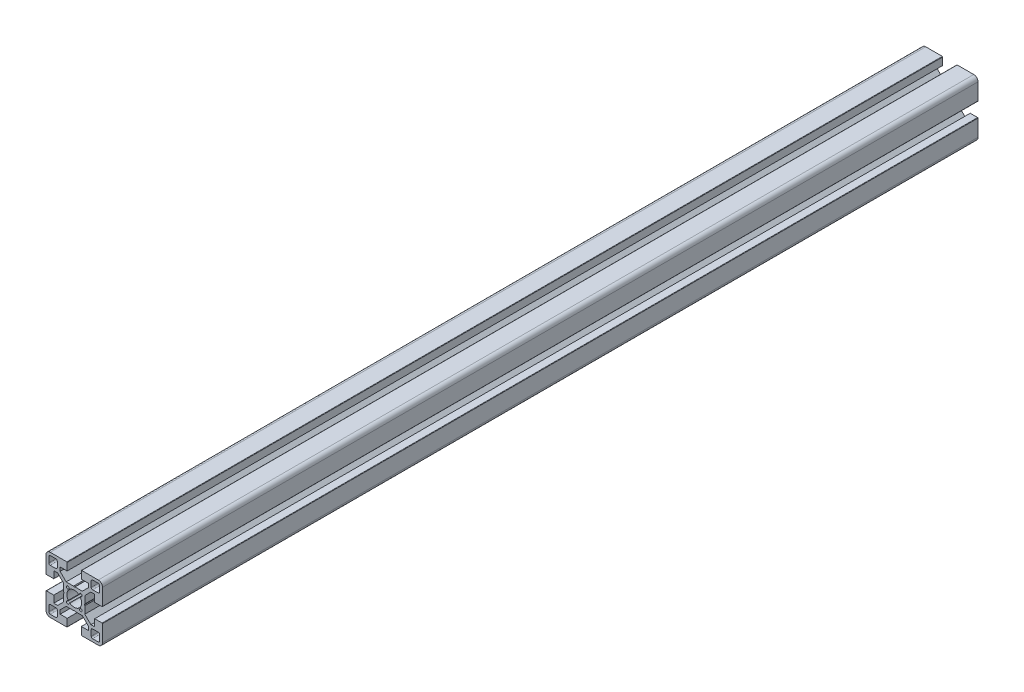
ISO-10303-21;
HEADER;
FILE_DESCRIPTION(('STEP AP214'),'2;1');
FILE_NAME('part.step','',(''),(''),'','','');
FILE_SCHEMA(('AUTOMOTIVE_DESIGN { 1 0 10303 214 1 1 1 1 }'));
ENDSEC;
DATA;
#1=APPLICATION_CONTEXT('core data for automotive mechanical design processes');
#2=APPLICATION_PROTOCOL_DEFINITION('international standard','automotive_design',2000,#1);
#3=PRODUCT_CONTEXT('',#1,'mechanical');
#4=PRODUCT('Part','Part','',(#3));
#5=PRODUCT_RELATED_PRODUCT_CATEGORY('part','',(#4));
#6=PRODUCT_DEFINITION_FORMATION('','',#4);
#7=PRODUCT_DEFINITION_CONTEXT('part definition',#1,'design');
#8=PRODUCT_DEFINITION('design','',#6,#7);
#9=PRODUCT_DEFINITION_SHAPE('','',#8);
#10=(LENGTH_UNIT() NAMED_UNIT(*) SI_UNIT(.MILLI.,.METRE.));
#11=(NAMED_UNIT(*) PLANE_ANGLE_UNIT() SI_UNIT($,.RADIAN.));
#12=(NAMED_UNIT(*) SI_UNIT($,.STERADIAN.) SOLID_ANGLE_UNIT());
#13=UNCERTAINTY_MEASURE_WITH_UNIT(LENGTH_MEASURE(1.E-05),#10,'distance_accuracy_value','');
#14=(GEOMETRIC_REPRESENTATION_CONTEXT(3) GLOBAL_UNCERTAINTY_ASSIGNED_CONTEXT((#13)) GLOBAL_UNIT_ASSIGNED_CONTEXT((#10,
#11,#12)) REPRESENTATION_CONTEXT('',''));
#15=CARTESIAN_POINT('',(0.,0.,0.));
#16=DIRECTION('',(0.,0.,1.));
#17=DIRECTION('',(1.,0.,0.));
#18=AXIS2_PLACEMENT_3D('',#15,#16,#17);
#19=CARTESIAN_POINT('',(-17.,17.,-620.));
#20=DIRECTION('',(0.,0.,1.));
#21=DIRECTION('',(1.,0.,0.));
#22=AXIS2_PLACEMENT_3D('',#19,#20,#21);
#23=CYLINDRICAL_SURFACE('',#22,3.);
#24=CARTESIAN_POINT('',(-17.,17.,0.));
#25=DIRECTION('',(0.,0.,1.));
#26=DIRECTION('',(1.,0.,0.));
#27=AXIS2_PLACEMENT_3D('',#24,#25,#26);
#28=CIRCLE('',#27,3.);
#29=CARTESIAN_POINT('',(-17.,20.,0.));
#30=VERTEX_POINT('',#29);
#31=CARTESIAN_POINT('',(-20.,17.,0.));
#32=VERTEX_POINT('',#31);
#33=EDGE_CURVE('E1103',#30,#32,#28,.T.);
#34=ORIENTED_EDGE('',*,*,#33,.F.);
#35=DIRECTION('',(0.,0.,1.));
#36=VECTOR('',#35,1.);
#37=CARTESIAN_POINT('',(-17.,20.,-620.));
#38=LINE('',#37,#36);
#39=CARTESIAN_POINT('',(-17.,20.,-620.));
#40=VERTEX_POINT('',#39);
#41=EDGE_CURVE('E11',#40,#30,#38,.T.);
#42=ORIENTED_EDGE('',*,*,#41,.F.);
#43=CARTESIAN_POINT('',(-17.,17.,-620.));
#44=DIRECTION('',(0.,0.,1.));
#45=DIRECTION('',(1.,0.,0.));
#46=AXIS2_PLACEMENT_3D('',#43,#44,#45);
#47=CIRCLE('',#46,3.);
#48=CARTESIAN_POINT('',(-20.,17.,-620.));
#49=VERTEX_POINT('',#48);
#50=EDGE_CURVE('E1118',#40,#49,#47,.T.);
#51=ORIENTED_EDGE('',*,*,#50,.T.);
#52=DIRECTION('',(0.,0.,1.));
#53=VECTOR('',#52,1.);
#54=CARTESIAN_POINT('',(-20.,17.,-620.));
#55=LINE('',#54,#53);
#56=EDGE_CURVE('E19',#49,#32,#55,.T.);
#57=ORIENTED_EDGE('',*,*,#56,.T.);
#58=EDGE_LOOP('',(#34,#42,#51,#57));
#59=FACE_BOUND('',#58,.T.);
#60=ADVANCED_FACE('F16',(#59),#23,.T.);
#61=CARTESIAN_POINT('',(-5.30000000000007,20.,-620.));
#62=DIRECTION('',(0.,1.,0.));
#63=DIRECTION('',(0.,0.,1.));
#64=AXIS2_PLACEMENT_3D('',#61,#62,#63);
#65=PLANE('',#64);
#66=DIRECTION('',(-1.,0.,0.));
#67=VECTOR('',#66,1.);
#68=CARTESIAN_POINT('',(-5.30000000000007,20.,0.));
#69=LINE('',#68,#67);
#70=CARTESIAN_POINT('',(-5.30000000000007,20.,0.));
#71=VERTEX_POINT('',#70);
#72=EDGE_CURVE('E1122',#71,#30,#69,.T.);
#73=ORIENTED_EDGE('',*,*,#72,.F.);
#74=DIRECTION('',(0.,0.,1.));
#75=VECTOR('',#74,1.);
#76=CARTESIAN_POINT('',(-5.30000000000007,20.,-620.));
#77=LINE('',#76,#75);
#78=CARTESIAN_POINT('',(-5.30000000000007,20.,-620.));
#79=VERTEX_POINT('',#78);
#80=EDGE_CURVE('E24',#79,#71,#77,.T.);
#81=ORIENTED_EDGE('',*,*,#80,.F.);
#82=DIRECTION('',(-1.,0.,0.));
#83=VECTOR('',#82,1.);
#84=CARTESIAN_POINT('',(-5.30000000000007,20.,-620.));
#85=LINE('',#84,#83);
#86=EDGE_CURVE('E1320',#79,#40,#85,.T.);
#87=ORIENTED_EDGE('',*,*,#86,.T.);
#88=ORIENTED_EDGE('',*,*,#41,.T.);
#89=EDGE_LOOP('',(#73,#81,#87,#88));
#90=FACE_BOUND('',#89,.T.);
#91=ADVANCED_FACE('F1667',(#90),#65,.T.);
#92=CARTESIAN_POINT('',(-5.30000000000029,19.6999999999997,-620.));
#93=DIRECTION('',(0.,0.,1.));
#94=DIRECTION('',(1.,0.,0.));
#95=AXIS2_PLACEMENT_3D('',#92,#93,#94);
#96=CYLINDRICAL_SURFACE('',#95,0.300000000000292);
#97=CARTESIAN_POINT('',(-5.30000000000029,19.6999999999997,0.));
#98=DIRECTION('',(0.,0.,1.));
#99=DIRECTION('',(1.,0.,0.));
#100=AXIS2_PLACEMENT_3D('',#97,#98,#99);
#101=CIRCLE('',#100,0.300000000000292);
#102=CARTESIAN_POINT('',(-5.,19.7,0.));
#103=VERTEX_POINT('',#102);
#104=EDGE_CURVE('E1520',#103,#71,#101,.T.);
#105=ORIENTED_EDGE('',*,*,#104,.F.);
#106=DIRECTION('',(0.,0.,1.));
#107=VECTOR('',#106,1.);
#108=CARTESIAN_POINT('',(-5.,19.7,-620.));
#109=LINE('',#108,#107);
#110=CARTESIAN_POINT('',(-5.,19.7,-620.));
#111=VERTEX_POINT('',#110);
#112=EDGE_CURVE('E1526',#111,#103,#109,.T.);
#113=ORIENTED_EDGE('',*,*,#112,.F.);
#114=CARTESIAN_POINT('',(-5.30000000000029,19.6999999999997,-620.));
#115=DIRECTION('',(0.,0.,1.));
#116=DIRECTION('',(1.,0.,0.));
#117=AXIS2_PLACEMENT_3D('',#114,#115,#116);
#118=CIRCLE('',#117,0.300000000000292);
#119=EDGE_CURVE('E1317',#111,#79,#118,.T.);
#120=ORIENTED_EDGE('',*,*,#119,.T.);
#121=ORIENTED_EDGE('',*,*,#80,.T.);
#122=EDGE_LOOP('',(#105,#113,#120,#121));
#123=FACE_BOUND('',#122,.T.);
#124=ADVANCED_FACE('F1927',(#123),#96,.T.);
#125=CARTESIAN_POINT('',(-5.,14.5,-620.));
#126=DIRECTION('',(1.,0.,0.));
#127=DIRECTION('',(0.,0.,-1.));
#128=AXIS2_PLACEMENT_3D('',#125,#126,#127);
#129=PLANE('',#128);
#130=DIRECTION('',(0.,1.,0.));
#131=VECTOR('',#130,1.);
#132=CARTESIAN_POINT('',(-5.,14.5,0.));
#133=LINE('',#132,#131);
#134=CARTESIAN_POINT('',(-5.,14.5,0.));
#135=VERTEX_POINT('',#134);
#136=EDGE_CURVE('E1517',#135,#103,#133,.T.);
#137=ORIENTED_EDGE('',*,*,#136,.F.);
#138=DIRECTION('',(0.,0.,1.));
#139=VECTOR('',#138,1.);
#140=CARTESIAN_POINT('',(-5.,14.5,-620.));
#141=LINE('',#140,#139);
#142=CARTESIAN_POINT('',(-5.,14.5,-620.));
#143=VERTEX_POINT('',#142);
#144=EDGE_CURVE('E1528',#143,#135,#141,.T.);
#145=ORIENTED_EDGE('',*,*,#144,.F.);
#146=DIRECTION('',(0.,1.,0.));
#147=VECTOR('',#146,1.);
#148=CARTESIAN_POINT('',(-5.,14.5,-620.));
#149=LINE('',#148,#147);
#150=EDGE_CURVE('E1314',#143,#111,#149,.T.);
#151=ORIENTED_EDGE('',*,*,#150,.T.);
#152=ORIENTED_EDGE('',*,*,#112,.T.);
#153=EDGE_LOOP('',(#137,#145,#151,#152));
#154=FACE_BOUND('',#153,.T.);
#155=ADVANCED_FACE('F1925',(#154),#129,.T.);
#156=CARTESIAN_POINT('',(-10.,14.5,-620.));
#157=DIRECTION('',(0.,-1.,0.));
#158=DIRECTION('',(0.,0.,-1.));
#159=AXIS2_PLACEMENT_3D('',#156,#157,#158);
#160=PLANE('',#159);
#161=DIRECTION('',(1.,0.,0.));
#162=VECTOR('',#161,1.);
#163=CARTESIAN_POINT('',(-10.,14.5,0.));
#164=LINE('',#163,#162);
#165=CARTESIAN_POINT('',(-10.,14.5,0.));
#166=VERTEX_POINT('',#165);
#167=EDGE_CURVE('E1514',#166,#135,#164,.T.);
#168=ORIENTED_EDGE('',*,*,#167,.F.);
#169=DIRECTION('',(0.,0.,1.));
#170=VECTOR('',#169,1.);
#171=CARTESIAN_POINT('',(-10.,14.5,-620.));
#172=LINE('',#171,#170);
#173=CARTESIAN_POINT('',(-10.,14.5,-620.));
#174=VERTEX_POINT('',#173);
#175=EDGE_CURVE('E1530',#174,#166,#172,.T.);
#176=ORIENTED_EDGE('',*,*,#175,.F.);
#177=DIRECTION('',(1.,0.,0.));
#178=VECTOR('',#177,1.);
#179=CARTESIAN_POINT('',(-10.,14.5,-620.));
#180=LINE('',#179,#178);
#181=EDGE_CURVE('E1311',#174,#143,#180,.T.);
#182=ORIENTED_EDGE('',*,*,#181,.T.);
#183=ORIENTED_EDGE('',*,*,#144,.T.);
#184=EDGE_LOOP('',(#168,#176,#182,#183));
#185=FACE_BOUND('',#184,.T.);
#186=ADVANCED_FACE('F1921',(#185),#160,.T.);
#187=CARTESIAN_POINT('',(-10.,11.7677860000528,-620.));
#188=DIRECTION('',(1.,0.,0.));
#189=DIRECTION('',(0.,0.,-1.));
#190=AXIS2_PLACEMENT_3D('',#187,#188,#189);
#191=PLANE('',#190);
#192=DIRECTION('',(0.,1.,0.));
#193=VECTOR('',#192,1.);
#194=CARTESIAN_POINT('',(-10.,11.7677860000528,0.));
#195=LINE('',#194,#193);
#196=CARTESIAN_POINT('',(-10.,11.7677860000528,0.));
#197=VERTEX_POINT('',#196);
#198=EDGE_CURVE('E1511',#197,#166,#195,.T.);
#199=ORIENTED_EDGE('',*,*,#198,.F.);
#200=DIRECTION('',(0.,0.,1.));
#201=VECTOR('',#200,1.);
#202=CARTESIAN_POINT('',(-10.,11.7677860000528,-620.));
#203=LINE('',#202,#201);
#204=CARTESIAN_POINT('',(-10.,11.7677860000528,-620.));
#205=VERTEX_POINT('',#204);
#206=EDGE_CURVE('E1532',#205,#197,#203,.T.);
#207=ORIENTED_EDGE('',*,*,#206,.F.);
#208=DIRECTION('',(0.,1.,0.));
#209=VECTOR('',#208,1.);
#210=CARTESIAN_POINT('',(-10.,11.7677860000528,-620.));
#211=LINE('',#210,#209);
#212=EDGE_CURVE('E1308',#205,#174,#211,.T.);
#213=ORIENTED_EDGE('',*,*,#212,.T.);
#214=ORIENTED_EDGE('',*,*,#175,.T.);
#215=EDGE_LOOP('',(#199,#207,#213,#214));
#216=FACE_BOUND('',#215,.T.);
#217=ADVANCED_FACE('F1917',(#216),#191,.T.);
#218=CARTESIAN_POINT('',(-5.73222900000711,7.5,-620.));
#219=DIRECTION('',(0.707108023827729,0.707105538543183,0.));
#220=DIRECTION('',(-0.707105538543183,0.707108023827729,0.));
#221=AXIS2_PLACEMENT_3D('',#218,#219,#220);
#222=PLANE('',#221);
#223=DIRECTION('',(-0.707105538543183,0.707108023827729,0.));
#224=VECTOR('',#223,1.);
#225=CARTESIAN_POINT('',(-5.73222900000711,7.5,0.));
#226=LINE('',#225,#224);
#227=CARTESIAN_POINT('',(-5.73222900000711,7.5,0.));
#228=VERTEX_POINT('',#227);
#229=EDGE_CURVE('E1508',#228,#197,#226,.T.);
#230=ORIENTED_EDGE('',*,*,#229,.F.);
#231=DIRECTION('',(0.,0.,1.));
#232=VECTOR('',#231,1.);
#233=CARTESIAN_POINT('',(-5.73222900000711,7.5,-620.));
#234=LINE('',#233,#232);
#235=CARTESIAN_POINT('',(-5.73222900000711,7.5,-620.));
#236=VERTEX_POINT('',#235);
#237=EDGE_CURVE('E1534',#236,#228,#234,.T.);
#238=ORIENTED_EDGE('',*,*,#237,.F.);
#239=DIRECTION('',(-0.707105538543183,0.707108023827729,0.));
#240=VECTOR('',#239,1.);
#241=CARTESIAN_POINT('',(-5.73222900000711,7.5,-620.));
#242=LINE('',#241,#240);
#243=EDGE_CURVE('E1305',#236,#205,#242,.T.);
#244=ORIENTED_EDGE('',*,*,#243,.T.);
#245=ORIENTED_EDGE('',*,*,#206,.T.);
#246=EDGE_LOOP('',(#230,#238,#244,#245));
#247=FACE_BOUND('',#246,.T.);
#248=ADVANCED_FACE('F1913',(#247),#222,.T.);
#249=CARTESIAN_POINT('',(-0.519615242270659,7.5,-620.));
#250=DIRECTION('',(0.,1.,0.));
#251=DIRECTION('',(-1.,0.,0.));
#252=AXIS2_PLACEMENT_3D('',#249,#250,#251);
#253=PLANE('',#252);
#254=DIRECTION('',(-1.,0.,0.));
#255=VECTOR('',#254,1.);
#256=CARTESIAN_POINT('',(-0.519615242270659,7.5,0.));
#257=LINE('',#256,#255);
#258=CARTESIAN_POINT('',(-0.519615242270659,7.5,0.));
#259=VERTEX_POINT('',#258);
#260=EDGE_CURVE('E1505',#259,#228,#257,.T.);
#261=ORIENTED_EDGE('',*,*,#260,.F.);
#262=DIRECTION('',(0.,0.,1.));
#263=VECTOR('',#262,1.);
#264=CARTESIAN_POINT('',(-0.519615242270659,7.5,-620.));
#265=LINE('',#264,#263);
#266=CARTESIAN_POINT('',(-0.519615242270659,7.5,-620.));
#267=VERTEX_POINT('',#266);
#268=EDGE_CURVE('E1536',#267,#259,#265,.T.);
#269=ORIENTED_EDGE('',*,*,#268,.F.);
#270=DIRECTION('',(-1.,0.,0.));
#271=VECTOR('',#270,1.);
#272=CARTESIAN_POINT('',(-0.519615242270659,7.5,-620.));
#273=LINE('',#272,#271);
#274=EDGE_CURVE('E1302',#267,#236,#273,.T.);
#275=ORIENTED_EDGE('',*,*,#274,.T.);
#276=ORIENTED_EDGE('',*,*,#237,.T.);
#277=EDGE_LOOP('',(#261,#269,#275,#276));
#278=FACE_BOUND('',#277,.T.);
#279=ADVANCED_FACE('F1909',(#278),#253,.T.);
#280=CARTESIAN_POINT('',(0.,7.2,-620.));
#281=DIRECTION('',(0.499999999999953,0.866025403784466,0.));
#282=DIRECTION('',(-0.866025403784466,0.499999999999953,0.));
#283=AXIS2_PLACEMENT_3D('',#280,#281,#282);
#284=PLANE('',#283);
#285=DIRECTION('',(-0.866025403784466,0.499999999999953,0.));
#286=VECTOR('',#285,1.);
#287=CARTESIAN_POINT('',(0.,7.2,0.));
#288=LINE('',#287,#286);
#289=CARTESIAN_POINT('',(0.,7.2,0.));
#290=VERTEX_POINT('',#289);
#291=EDGE_CURVE('E1502',#290,#259,#288,.T.);
#292=ORIENTED_EDGE('',*,*,#291,.F.);
#293=DIRECTION('',(0.,0.,1.));
#294=VECTOR('',#293,1.);
#295=CARTESIAN_POINT('',(0.,7.2,-620.));
#296=LINE('',#295,#294);
#297=CARTESIAN_POINT('',(0.,7.2,-620.));
#298=VERTEX_POINT('',#297);
#299=EDGE_CURVE('E1538',#298,#290,#296,.T.);
#300=ORIENTED_EDGE('',*,*,#299,.F.);
#301=DIRECTION('',(-0.866025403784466,0.499999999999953,0.));
#302=VECTOR('',#301,1.);
#303=CARTESIAN_POINT('',(0.,7.2,-620.));
#304=LINE('',#303,#302);
#305=EDGE_CURVE('E1299',#298,#267,#304,.T.);
#306=ORIENTED_EDGE('',*,*,#305,.T.);
#307=ORIENTED_EDGE('',*,*,#268,.T.);
#308=EDGE_LOOP('',(#292,#300,#306,#307));
#309=FACE_BOUND('',#308,.T.);
#310=ADVANCED_FACE('F1905',(#309),#284,.T.);
#311=CARTESIAN_POINT('',(0.51961524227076,7.5,-620.));
#312=DIRECTION('',(-0.499999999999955,0.866025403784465,0.));
#313=DIRECTION('',(-0.866025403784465,-0.499999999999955,0.));
#314=AXIS2_PLACEMENT_3D('',#311,#312,#313);
#315=PLANE('',#314);
#316=DIRECTION('',(-0.866025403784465,-0.499999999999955,0.));
#317=VECTOR('',#316,1.);
#318=CARTESIAN_POINT('',(0.51961524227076,7.5,0.));
#319=LINE('',#318,#317);
#320=CARTESIAN_POINT('',(0.51961524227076,7.5,0.));
#321=VERTEX_POINT('',#320);
#322=EDGE_CURVE('E1499',#321,#290,#319,.T.);
#323=ORIENTED_EDGE('',*,*,#322,.F.);
#324=DIRECTION('',(0.,0.,1.));
#325=VECTOR('',#324,1.);
#326=CARTESIAN_POINT('',(0.51961524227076,7.5,-620.));
#327=LINE('',#326,#325);
#328=CARTESIAN_POINT('',(0.51961524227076,7.5,-620.));
#329=VERTEX_POINT('',#328);
#330=EDGE_CURVE('E1540',#329,#321,#327,.T.);
#331=ORIENTED_EDGE('',*,*,#330,.F.);
#332=DIRECTION('',(-0.866025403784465,-0.499999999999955,0.));
#333=VECTOR('',#332,1.);
#334=CARTESIAN_POINT('',(0.51961524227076,7.5,-620.));
#335=LINE('',#334,#333);
#336=EDGE_CURVE('E1296',#329,#298,#335,.T.);
#337=ORIENTED_EDGE('',*,*,#336,.T.);
#338=ORIENTED_EDGE('',*,*,#299,.T.);
#339=EDGE_LOOP('',(#323,#331,#337,#338));
#340=FACE_BOUND('',#339,.T.);
#341=ADVANCED_FACE('F1901',(#340),#315,.T.);
#342=CARTESIAN_POINT('',(5.73223699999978,7.5,-620.));
#343=DIRECTION('',(0.,1.,0.));
#344=DIRECTION('',(-1.,0.,0.));
#345=AXIS2_PLACEMENT_3D('',#342,#343,#344);
#346=PLANE('',#345);
#347=DIRECTION('',(-1.,0.,0.));
#348=VECTOR('',#347,1.);
#349=CARTESIAN_POINT('',(5.73223699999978,7.5,0.));
#350=LINE('',#349,#348);
#351=CARTESIAN_POINT('',(5.73223699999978,7.5,0.));
#352=VERTEX_POINT('',#351);
#353=EDGE_CURVE('E1496',#352,#321,#350,.T.);
#354=ORIENTED_EDGE('',*,*,#353,.F.);
#355=DIRECTION('',(0.,0.,1.));
#356=VECTOR('',#355,1.);
#357=CARTESIAN_POINT('',(5.73223699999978,7.5,-620.));
#358=LINE('',#357,#356);
#359=CARTESIAN_POINT('',(5.73223699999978,7.5,-620.));
#360=VERTEX_POINT('',#359);
#361=EDGE_CURVE('E1542',#360,#352,#358,.T.);
#362=ORIENTED_EDGE('',*,*,#361,.F.);
#363=DIRECTION('',(-1.,0.,0.));
#364=VECTOR('',#363,1.);
#365=CARTESIAN_POINT('',(5.73223699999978,7.5,-620.));
#366=LINE('',#365,#364);
#367=EDGE_CURVE('E1293',#360,#329,#366,.T.);
#368=ORIENTED_EDGE('',*,*,#367,.T.);
#369=ORIENTED_EDGE('',*,*,#330,.T.);
#370=EDGE_LOOP('',(#354,#362,#368,#369));
#371=FACE_BOUND('',#370,.T.);
#372=ADVANCED_FACE('F1897',(#371),#346,.T.);
#373=CARTESIAN_POINT('',(9.99999999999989,11.7677629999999,-620.));
#374=DIRECTION('',(-0.707106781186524,0.707106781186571,0.));
#375=DIRECTION('',(-0.707106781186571,-0.707106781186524,0.));
#376=AXIS2_PLACEMENT_3D('',#373,#374,#375);
#377=PLANE('',#376);
#378=DIRECTION('',(-0.707106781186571,-0.707106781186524,0.));
#379=VECTOR('',#378,1.);
#380=CARTESIAN_POINT('',(9.99999999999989,11.7677629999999,0.));
#381=LINE('',#380,#379);
#382=CARTESIAN_POINT('',(9.99999999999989,11.7677629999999,0.));
#383=VERTEX_POINT('',#382);
#384=EDGE_CURVE('E1493',#383,#352,#381,.T.);
#385=ORIENTED_EDGE('',*,*,#384,.F.);
#386=DIRECTION('',(0.,0.,1.));
#387=VECTOR('',#386,1.);
#388=CARTESIAN_POINT('',(9.99999999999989,11.7677629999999,-620.));
#389=LINE('',#388,#387);
#390=CARTESIAN_POINT('',(9.99999999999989,11.7677629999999,-620.));
#391=VERTEX_POINT('',#390);
#392=EDGE_CURVE('E1544',#391,#383,#389,.T.);
#393=ORIENTED_EDGE('',*,*,#392,.F.);
#394=DIRECTION('',(-0.707106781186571,-0.707106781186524,0.));
#395=VECTOR('',#394,1.);
#396=CARTESIAN_POINT('',(9.99999999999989,11.7677629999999,-620.));
#397=LINE('',#396,#395);
#398=EDGE_CURVE('E1290',#391,#360,#397,.T.);
#399=ORIENTED_EDGE('',*,*,#398,.T.);
#400=ORIENTED_EDGE('',*,*,#361,.T.);
#401=EDGE_LOOP('',(#385,#393,#399,#400));
#402=FACE_BOUND('',#401,.T.);
#403=ADVANCED_FACE('F1893',(#402),#377,.T.);
#404=CARTESIAN_POINT('',(9.99999999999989,14.5,-620.));
#405=DIRECTION('',(-1.,0.,0.));
#406=DIRECTION('',(0.,0.,1.));
#407=AXIS2_PLACEMENT_3D('',#404,#405,#406);
#408=PLANE('',#407);
#409=DIRECTION('',(0.,-1.,0.));
#410=VECTOR('',#409,1.);
#411=CARTESIAN_POINT('',(9.99999999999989,14.5,0.));
#412=LINE('',#411,#410);
#413=CARTESIAN_POINT('',(9.99999999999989,14.5,0.));
#414=VERTEX_POINT('',#413);
#415=EDGE_CURVE('E1490',#414,#383,#412,.T.);
#416=ORIENTED_EDGE('',*,*,#415,.F.);
#417=DIRECTION('',(0.,0.,1.));
#418=VECTOR('',#417,1.);
#419=CARTESIAN_POINT('',(9.99999999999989,14.5,-620.));
#420=LINE('',#419,#418);
#421=CARTESIAN_POINT('',(9.99999999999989,14.5,-620.));
#422=VERTEX_POINT('',#421);
#423=EDGE_CURVE('E1546',#422,#414,#420,.T.);
#424=ORIENTED_EDGE('',*,*,#423,.F.);
#425=DIRECTION('',(0.,-1.,0.));
#426=VECTOR('',#425,1.);
#427=CARTESIAN_POINT('',(9.99999999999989,14.5,-620.));
#428=LINE('',#427,#426);
#429=EDGE_CURVE('E1287',#422,#391,#428,.T.);
#430=ORIENTED_EDGE('',*,*,#429,.T.);
#431=ORIENTED_EDGE('',*,*,#392,.T.);
#432=EDGE_LOOP('',(#416,#424,#430,#431));
#433=FACE_BOUND('',#432,.T.);
#434=ADVANCED_FACE('F1889',(#433),#408,.T.);
#435=CARTESIAN_POINT('',(5.,14.5,-620.));
#436=DIRECTION('',(0.,-1.,0.));
#437=DIRECTION('',(0.,0.,-1.));
#438=AXIS2_PLACEMENT_3D('',#435,#436,#437);
#439=PLANE('',#438);
#440=DIRECTION('',(1.,0.,0.));
#441=VECTOR('',#440,1.);
#442=CARTESIAN_POINT('',(5.,14.5,0.));
#443=LINE('',#442,#441);
#444=CARTESIAN_POINT('',(5.,14.5,0.));
#445=VERTEX_POINT('',#444);
#446=EDGE_CURVE('E1487',#445,#414,#443,.T.);
#447=ORIENTED_EDGE('',*,*,#446,.F.);
#448=DIRECTION('',(0.,0.,1.));
#449=VECTOR('',#448,1.);
#450=CARTESIAN_POINT('',(5.,14.5,-620.));
#451=LINE('',#450,#449);
#452=CARTESIAN_POINT('',(5.,14.5,-620.));
#453=VERTEX_POINT('',#452);
#454=EDGE_CURVE('E1548',#453,#445,#451,.T.);
#455=ORIENTED_EDGE('',*,*,#454,.F.);
#456=DIRECTION('',(1.,0.,0.));
#457=VECTOR('',#456,1.);
#458=CARTESIAN_POINT('',(5.,14.5,-620.));
#459=LINE('',#458,#457);
#460=EDGE_CURVE('E1284',#453,#422,#459,.T.);
#461=ORIENTED_EDGE('',*,*,#460,.T.);
#462=ORIENTED_EDGE('',*,*,#423,.T.);
#463=EDGE_LOOP('',(#447,#455,#461,#462));
#464=FACE_BOUND('',#463,.T.);
#465=ADVANCED_FACE('F1885',(#464),#439,.T.);
#466=CARTESIAN_POINT('',(5.,19.7,-620.));
#467=DIRECTION('',(-1.,0.,0.));
#468=DIRECTION('',(0.,0.,1.));
#469=AXIS2_PLACEMENT_3D('',#466,#467,#468);
#470=PLANE('',#469);
#471=DIRECTION('',(0.,-1.,0.));
#472=VECTOR('',#471,1.);
#473=CARTESIAN_POINT('',(5.,19.7,0.));
#474=LINE('',#473,#472);
#475=CARTESIAN_POINT('',(5.,19.7,0.));
#476=VERTEX_POINT('',#475);
#477=EDGE_CURVE('E1484',#476,#445,#474,.T.);
#478=ORIENTED_EDGE('',*,*,#477,.F.);
#479=DIRECTION('',(0.,0.,1.));
#480=VECTOR('',#479,1.);
#481=CARTESIAN_POINT('',(5.,19.7,-620.));
#482=LINE('',#481,#480);
#483=CARTESIAN_POINT('',(5.,19.7,-620.));
#484=VERTEX_POINT('',#483);
#485=EDGE_CURVE('E1550',#484,#476,#482,.T.);
#486=ORIENTED_EDGE('',*,*,#485,.F.);
#487=DIRECTION('',(0.,-1.,0.));
#488=VECTOR('',#487,1.);
#489=CARTESIAN_POINT('',(5.,19.7,-620.));
#490=LINE('',#489,#488);
#491=EDGE_CURVE('E1281',#484,#453,#490,.T.);
#492=ORIENTED_EDGE('',*,*,#491,.T.);
#493=ORIENTED_EDGE('',*,*,#454,.T.);
#494=EDGE_LOOP('',(#478,#486,#492,#493));
#495=FACE_BOUND('',#494,.T.);
#496=ADVANCED_FACE('F1881',(#495),#470,.T.);
#497=CARTESIAN_POINT('',(5.30000000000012,19.7,-620.));
#498=DIRECTION('',(0.,0.,1.));
#499=DIRECTION('',(1.,0.,0.));
#500=AXIS2_PLACEMENT_3D('',#497,#498,#499);
#501=CYLINDRICAL_SURFACE('',#500,0.300000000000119);
#502=CARTESIAN_POINT('',(5.30000000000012,19.7,0.));
#503=DIRECTION('',(0.,0.,1.));
#504=DIRECTION('',(1.,0.,0.));
#505=AXIS2_PLACEMENT_3D('',#502,#503,#504);
#506=CIRCLE('',#505,0.300000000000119);
#507=CARTESIAN_POINT('',(5.3,20.,0.));
#508=VERTEX_POINT('',#507);
#509=EDGE_CURVE('E1481',#508,#476,#506,.T.);
#510=ORIENTED_EDGE('',*,*,#509,.F.);
#511=DIRECTION('',(0.,0.,1.));
#512=VECTOR('',#511,1.);
#513=CARTESIAN_POINT('',(5.3,20.,-620.));
#514=LINE('',#513,#512);
#515=CARTESIAN_POINT('',(5.3,20.,-620.));
#516=VERTEX_POINT('',#515);
#517=EDGE_CURVE('E1552',#516,#508,#514,.T.);
#518=ORIENTED_EDGE('',*,*,#517,.F.);
#519=CARTESIAN_POINT('',(5.30000000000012,19.7,-620.));
#520=DIRECTION('',(0.,0.,1.));
#521=DIRECTION('',(1.,0.,0.));
#522=AXIS2_PLACEMENT_3D('',#519,#520,#521);
#523=CIRCLE('',#522,0.300000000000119);
#524=EDGE_CURVE('E1278',#516,#484,#523,.T.);
#525=ORIENTED_EDGE('',*,*,#524,.T.);
#526=ORIENTED_EDGE('',*,*,#485,.T.);
#527=EDGE_LOOP('',(#510,#518,#525,#526));
#528=FACE_BOUND('',#527,.T.);
#529=ADVANCED_FACE('F1877',(#528),#501,.T.);
#530=CARTESIAN_POINT('',(17.,20.,-620.));
#531=DIRECTION('',(0.,1.,0.));
#532=DIRECTION('',(0.,0.,1.));
#533=AXIS2_PLACEMENT_3D('',#530,#531,#532);
#534=PLANE('',#533);
#535=DIRECTION('',(-1.,0.,0.));
#536=VECTOR('',#535,1.);
#537=CARTESIAN_POINT('',(17.,20.,0.));
#538=LINE('',#537,#536);
#539=CARTESIAN_POINT('',(17.,20.,0.));
#540=VERTEX_POINT('',#539);
#541=EDGE_CURVE('E1478',#540,#508,#538,.T.);
#542=ORIENTED_EDGE('',*,*,#541,.F.);
#543=DIRECTION('',(0.,0.,1.));
#544=VECTOR('',#543,1.);
#545=CARTESIAN_POINT('',(17.,20.,-620.));
#546=LINE('',#545,#544);
#547=CARTESIAN_POINT('',(17.,20.,-620.));
#548=VERTEX_POINT('',#547);
#549=EDGE_CURVE('E1554',#548,#540,#546,.T.);
#550=ORIENTED_EDGE('',*,*,#549,.F.);
#551=DIRECTION('',(-1.,0.,0.));
#552=VECTOR('',#551,1.);
#553=CARTESIAN_POINT('',(17.,20.,-620.));
#554=LINE('',#553,#552);
#555=EDGE_CURVE('E1275',#548,#516,#554,.T.);
#556=ORIENTED_EDGE('',*,*,#555,.T.);
#557=ORIENTED_EDGE('',*,*,#517,.T.);
#558=EDGE_LOOP('',(#542,#550,#556,#557));
#559=FACE_BOUND('',#558,.T.);
#560=ADVANCED_FACE('F1873',(#559),#534,.T.);
#561=CARTESIAN_POINT('',(17.,17.,-620.));
#562=DIRECTION('',(0.,0.,1.));
#563=DIRECTION('',(1.,0.,0.));
#564=AXIS2_PLACEMENT_3D('',#561,#562,#563);
#565=CYLINDRICAL_SURFACE('',#564,2.99999999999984);
#566=CARTESIAN_POINT('',(17.,17.,0.));
#567=DIRECTION('',(0.,0.,1.));
#568=DIRECTION('',(1.,0.,0.));
#569=AXIS2_PLACEMENT_3D('',#566,#567,#568);
#570=CIRCLE('',#569,2.99999999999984);
#571=CARTESIAN_POINT('',(20.,17.,0.));
#572=VERTEX_POINT('',#571);
#573=EDGE_CURVE('E1475',#572,#540,#570,.T.);
#574=ORIENTED_EDGE('',*,*,#573,.F.);
#575=DIRECTION('',(0.,0.,1.));
#576=VECTOR('',#575,1.);
#577=CARTESIAN_POINT('',(20.,17.,-620.));
#578=LINE('',#577,#576);
#579=CARTESIAN_POINT('',(20.,17.,-620.));
#580=VERTEX_POINT('',#579);
#581=EDGE_CURVE('E1556',#580,#572,#578,.T.);
#582=ORIENTED_EDGE('',*,*,#581,.F.);
#583=CARTESIAN_POINT('',(17.,17.,-620.));
#584=DIRECTION('',(0.,0.,1.));
#585=DIRECTION('',(1.,0.,0.));
#586=AXIS2_PLACEMENT_3D('',#583,#584,#585);
#587=CIRCLE('',#586,2.99999999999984);
#588=EDGE_CURVE('E1272',#580,#548,#587,.T.);
#589=ORIENTED_EDGE('',*,*,#588,.T.);
#590=ORIENTED_EDGE('',*,*,#549,.T.);
#591=EDGE_LOOP('',(#574,#582,#589,#590));
#592=FACE_BOUND('',#591,.T.);
#593=ADVANCED_FACE('F1869',(#592),#565,.T.);
#594=CARTESIAN_POINT('',(20.,5.30000300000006,-620.));
#595=DIRECTION('',(1.,0.,0.));
#596=DIRECTION('',(0.,0.,-1.));
#597=AXIS2_PLACEMENT_3D('',#594,#595,#596);
#598=PLANE('',#597);
#599=DIRECTION('',(0.,1.,0.));
#600=VECTOR('',#599,1.);
#601=CARTESIAN_POINT('',(20.,5.30000300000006,0.));
#602=LINE('',#601,#600);
#603=CARTESIAN_POINT('',(20.,5.30000300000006,0.));
#604=VERTEX_POINT('',#603);
#605=EDGE_CURVE('E1472',#604,#572,#602,.T.);
#606=ORIENTED_EDGE('',*,*,#605,.F.);
#607=DIRECTION('',(0.,0.,1.));
#608=VECTOR('',#607,1.);
#609=CARTESIAN_POINT('',(20.,5.30000300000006,-620.));
#610=LINE('',#609,#608);
#611=CARTESIAN_POINT('',(20.,5.30000300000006,-620.));
#612=VERTEX_POINT('',#611);
#613=EDGE_CURVE('E1558',#612,#604,#610,.T.);
#614=ORIENTED_EDGE('',*,*,#613,.F.);
#615=DIRECTION('',(0.,1.,0.));
#616=VECTOR('',#615,1.);
#617=CARTESIAN_POINT('',(20.,5.30000300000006,-620.));
#618=LINE('',#617,#616);
#619=EDGE_CURVE('E1269',#612,#580,#618,.T.);
#620=ORIENTED_EDGE('',*,*,#619,.T.);
#621=ORIENTED_EDGE('',*,*,#581,.T.);
#622=EDGE_LOOP('',(#606,#614,#620,#621));
#623=FACE_BOUND('',#622,.T.);
#624=ADVANCED_FACE('F1865',(#623),#598,.T.);
#625=CARTESIAN_POINT('',(19.699989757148,5.30001024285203,-620.));
#626=DIRECTION('',(0.,0.,1.));
#627=DIRECTION('',(1.,0.,0.));
#628=AXIS2_PLACEMENT_3D('',#625,#626,#627);
#629=CYLINDRICAL_SURFACE('',#628,0.300010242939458);
#630=CARTESIAN_POINT('',(19.699989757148,5.30001024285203,0.));
#631=DIRECTION('',(0.,0.,1.));
#632=DIRECTION('',(1.,0.,0.));
#633=AXIS2_PLACEMENT_3D('',#630,#631,#632);
#634=CIRCLE('',#633,0.300010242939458);
#635=CARTESIAN_POINT('',(19.6999969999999,5.,0.));
#636=VERTEX_POINT('',#635);
#637=EDGE_CURVE('E1469',#636,#604,#634,.T.);
#638=ORIENTED_EDGE('',*,*,#637,.F.);
#639=DIRECTION('',(0.,0.,1.));
#640=VECTOR('',#639,1.);
#641=CARTESIAN_POINT('',(19.6999969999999,5.,-620.));
#642=LINE('',#641,#640);
#643=CARTESIAN_POINT('',(19.6999969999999,5.,-620.));
#644=VERTEX_POINT('',#643);
#645=EDGE_CURVE('E1560',#644,#636,#642,.T.);
#646=ORIENTED_EDGE('',*,*,#645,.F.);
#647=CARTESIAN_POINT('',(19.699989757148,5.30001024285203,-620.));
#648=DIRECTION('',(0.,0.,1.));
#649=DIRECTION('',(1.,0.,0.));
#650=AXIS2_PLACEMENT_3D('',#647,#648,#649);
#651=CIRCLE('',#650,0.300010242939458);
#652=EDGE_CURVE('E1266',#644,#612,#651,.T.);
#653=ORIENTED_EDGE('',*,*,#652,.T.);
#654=ORIENTED_EDGE('',*,*,#613,.T.);
#655=EDGE_LOOP('',(#638,#646,#653,#654));
#656=FACE_BOUND('',#655,.T.);
#657=ADVANCED_FACE('F1861',(#656),#629,.T.);
#658=CARTESIAN_POINT('',(14.5,5.,-620.));
#659=DIRECTION('',(0.,-1.,0.));
#660=DIRECTION('',(0.,0.,-1.));
#661=AXIS2_PLACEMENT_3D('',#658,#659,#660);
#662=PLANE('',#661);
#663=DIRECTION('',(1.,0.,0.));
#664=VECTOR('',#663,1.);
#665=CARTESIAN_POINT('',(14.5,5.,0.));
#666=LINE('',#665,#664);
#667=CARTESIAN_POINT('',(14.5,5.,0.));
#668=VERTEX_POINT('',#667);
#669=EDGE_CURVE('E1466',#668,#636,#666,.T.);
#670=ORIENTED_EDGE('',*,*,#669,.F.);
#671=DIRECTION('',(0.,0.,1.));
#672=VECTOR('',#671,1.);
#673=CARTESIAN_POINT('',(14.5,5.,-620.));
#674=LINE('',#673,#672);
#675=CARTESIAN_POINT('',(14.5,5.,-620.));
#676=VERTEX_POINT('',#675);
#677=EDGE_CURVE('E1562',#676,#668,#674,.T.);
#678=ORIENTED_EDGE('',*,*,#677,.F.);
#679=DIRECTION('',(1.,0.,0.));
#680=VECTOR('',#679,1.);
#681=CARTESIAN_POINT('',(14.5,5.,-620.));
#682=LINE('',#681,#680);
#683=EDGE_CURVE('E1263',#676,#644,#682,.T.);
#684=ORIENTED_EDGE('',*,*,#683,.T.);
#685=ORIENTED_EDGE('',*,*,#645,.T.);
#686=EDGE_LOOP('',(#670,#678,#684,#685));
#687=FACE_BOUND('',#686,.T.);
#688=ADVANCED_FACE('F1857',(#687),#662,.T.);
#689=CARTESIAN_POINT('',(14.5,10.,-620.));
#690=DIRECTION('',(-1.,0.,0.));
#691=DIRECTION('',(0.,0.,1.));
#692=AXIS2_PLACEMENT_3D('',#689,#690,#691);
#693=PLANE('',#692);
#694=DIRECTION('',(0.,-1.,0.));
#695=VECTOR('',#694,1.);
#696=CARTESIAN_POINT('',(14.5,10.,0.));
#697=LINE('',#696,#695);
#698=CARTESIAN_POINT('',(14.5,10.,0.));
#699=VERTEX_POINT('',#698);
#700=EDGE_CURVE('E1463',#699,#668,#697,.T.);
#701=ORIENTED_EDGE('',*,*,#700,.F.);
#702=DIRECTION('',(0.,0.,1.));
#703=VECTOR('',#702,1.);
#704=CARTESIAN_POINT('',(14.5,10.,-620.));
#705=LINE('',#704,#703);
#706=CARTESIAN_POINT('',(14.5,10.,-620.));
#707=VERTEX_POINT('',#706);
#708=EDGE_CURVE('E1564',#707,#699,#705,.T.);
#709=ORIENTED_EDGE('',*,*,#708,.F.);
#710=DIRECTION('',(0.,-1.,0.));
#711=VECTOR('',#710,1.);
#712=CARTESIAN_POINT('',(14.5,10.,-620.));
#713=LINE('',#712,#711);
#714=EDGE_CURVE('E1260',#707,#676,#713,.T.);
#715=ORIENTED_EDGE('',*,*,#714,.T.);
#716=ORIENTED_EDGE('',*,*,#677,.T.);
#717=EDGE_LOOP('',(#701,#709,#715,#716));
#718=FACE_BOUND('',#717,.T.);
#719=ADVANCED_FACE('F1853',(#718),#693,.T.);
#720=CARTESIAN_POINT('',(11.7677769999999,10.,-620.));
#721=DIRECTION('',(0.,-1.,0.));
#722=DIRECTION('',(0.,0.,-1.));
#723=AXIS2_PLACEMENT_3D('',#720,#721,#722);
#724=PLANE('',#723);
#725=DIRECTION('',(1.,0.,0.));
#726=VECTOR('',#725,1.);
#727=CARTESIAN_POINT('',(11.7677769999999,10.,0.));
#728=LINE('',#727,#726);
#729=CARTESIAN_POINT('',(11.7677769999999,10.,0.));
#730=VERTEX_POINT('',#729);
#731=EDGE_CURVE('E1460',#730,#699,#728,.T.);
#732=ORIENTED_EDGE('',*,*,#731,.F.);
#733=DIRECTION('',(0.,0.,1.));
#734=VECTOR('',#733,1.);
#735=CARTESIAN_POINT('',(11.7677769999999,10.,-620.));
#736=LINE('',#735,#734);
#737=CARTESIAN_POINT('',(11.7677769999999,10.,-620.));
#738=VERTEX_POINT('',#737);
#739=EDGE_CURVE('E1566',#738,#730,#736,.T.);
#740=ORIENTED_EDGE('',*,*,#739,.F.);
#741=DIRECTION('',(1.,0.,0.));
#742=VECTOR('',#741,1.);
#743=CARTESIAN_POINT('',(11.7677769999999,10.,-620.));
#744=LINE('',#743,#742);
#745=EDGE_CURVE('E1257',#738,#707,#744,.T.);
#746=ORIENTED_EDGE('',*,*,#745,.T.);
#747=ORIENTED_EDGE('',*,*,#708,.T.);
#748=EDGE_LOOP('',(#732,#740,#746,#747));
#749=FACE_BOUND('',#748,.T.);
#750=ADVANCED_FACE('F1849',(#749),#724,.T.);
#751=CARTESIAN_POINT('',(7.49999999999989,5.7322310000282,-620.));
#752=DIRECTION('',(0.707106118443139,-0.707107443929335,0.));
#753=DIRECTION('',(0.707107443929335,0.707106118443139,0.));
#754=AXIS2_PLACEMENT_3D('',#751,#752,#753);
#755=PLANE('',#754);
#756=DIRECTION('',(0.707107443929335,0.707106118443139,0.));
#757=VECTOR('',#756,1.);
#758=CARTESIAN_POINT('',(7.49999999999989,5.7322310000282,0.));
#759=LINE('',#758,#757);
#760=CARTESIAN_POINT('',(7.49999999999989,5.7322310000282,0.));
#761=VERTEX_POINT('',#760);
#762=EDGE_CURVE('E1457',#761,#730,#759,.T.);
#763=ORIENTED_EDGE('',*,*,#762,.F.);
#764=DIRECTION('',(0.,0.,1.));
#765=VECTOR('',#764,1.);
#766=CARTESIAN_POINT('',(7.49999999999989,5.7322310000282,-620.));
#767=LINE('',#766,#765);
#768=CARTESIAN_POINT('',(7.49999999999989,5.7322310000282,-620.));
#769=VERTEX_POINT('',#768);
#770=EDGE_CURVE('E1568',#769,#761,#767,.T.);
#771=ORIENTED_EDGE('',*,*,#770,.F.);
#772=DIRECTION('',(0.707107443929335,0.707106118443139,0.));
#773=VECTOR('',#772,1.);
#774=CARTESIAN_POINT('',(7.49999999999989,5.7322310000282,-620.));
#775=LINE('',#774,#773);
#776=EDGE_CURVE('E1254',#769,#738,#775,.T.);
#777=ORIENTED_EDGE('',*,*,#776,.T.);
#778=ORIENTED_EDGE('',*,*,#739,.T.);
#779=EDGE_LOOP('',(#763,#771,#777,#778));
#780=FACE_BOUND('',#779,.T.);
#781=ADVANCED_FACE('F1845',(#780),#755,.T.);
#782=CARTESIAN_POINT('',(7.49999999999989,0.519615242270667,-620.));
#783=DIRECTION('',(1.,0.,0.));
#784=DIRECTION('',(0.,0.,-1.));
#785=AXIS2_PLACEMENT_3D('',#782,#783,#784);
#786=PLANE('',#785);
#787=DIRECTION('',(0.,1.,0.));
#788=VECTOR('',#787,1.);
#789=CARTESIAN_POINT('',(7.49999999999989,0.519615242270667,0.));
#790=LINE('',#789,#788);
#791=CARTESIAN_POINT('',(7.49999999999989,0.519615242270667,0.));
#792=VERTEX_POINT('',#791);
#793=EDGE_CURVE('E1454',#792,#761,#790,.T.);
#794=ORIENTED_EDGE('',*,*,#793,.F.);
#795=DIRECTION('',(0.,0.,1.));
#796=VECTOR('',#795,1.);
#797=CARTESIAN_POINT('',(7.49999999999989,0.519615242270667,-620.));
#798=LINE('',#797,#796);
#799=CARTESIAN_POINT('',(7.49999999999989,0.519615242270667,-620.));
#800=VERTEX_POINT('',#799);
#801=EDGE_CURVE('E1570',#800,#792,#798,.T.);
#802=ORIENTED_EDGE('',*,*,#801,.F.);
#803=DIRECTION('',(0.,1.,0.));
#804=VECTOR('',#803,1.);
#805=CARTESIAN_POINT('',(7.49999999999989,0.519615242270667,-620.));
#806=LINE('',#805,#804);
#807=EDGE_CURVE('E1251',#800,#769,#806,.T.);
#808=ORIENTED_EDGE('',*,*,#807,.T.);
#809=ORIENTED_EDGE('',*,*,#770,.T.);
#810=EDGE_LOOP('',(#794,#802,#808,#809));
#811=FACE_BOUND('',#810,.T.);
#812=ADVANCED_FACE('F1841',(#811),#786,.T.);
#813=CARTESIAN_POINT('',(7.19999999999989,0.,-620.));
#814=DIRECTION('',(0.86602540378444,-0.5,0.));
#815=DIRECTION('',(0.5,0.86602540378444,0.));
#816=AXIS2_PLACEMENT_3D('',#813,#814,#815);
#817=PLANE('',#816);
#818=DIRECTION('',(0.5,0.86602540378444,0.));
#819=VECTOR('',#818,1.);
#820=CARTESIAN_POINT('',(7.19999999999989,0.,0.));
#821=LINE('',#820,#819);
#822=CARTESIAN_POINT('',(7.19999999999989,0.,0.));
#823=VERTEX_POINT('',#822);
#824=EDGE_CURVE('E1451',#823,#792,#821,.T.);
#825=ORIENTED_EDGE('',*,*,#824,.F.);
#826=DIRECTION('',(0.,0.,1.));
#827=VECTOR('',#826,1.);
#828=CARTESIAN_POINT('',(7.19999999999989,0.,-620.));
#829=LINE('',#828,#827);
#830=CARTESIAN_POINT('',(7.19999999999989,0.,-620.));
#831=VERTEX_POINT('',#830);
#832=EDGE_CURVE('E1572',#831,#823,#829,.T.);
#833=ORIENTED_EDGE('',*,*,#832,.F.);
#834=DIRECTION('',(0.5,0.86602540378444,0.));
#835=VECTOR('',#834,1.);
#836=CARTESIAN_POINT('',(7.19999999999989,0.,-620.));
#837=LINE('',#836,#835);
#838=EDGE_CURVE('E1248',#831,#800,#837,.T.);
#839=ORIENTED_EDGE('',*,*,#838,.T.);
#840=ORIENTED_EDGE('',*,*,#801,.T.);
#841=EDGE_LOOP('',(#825,#833,#839,#840));
#842=FACE_BOUND('',#841,.T.);
#843=ADVANCED_FACE('F1837',(#842),#817,.T.);
#844=CARTESIAN_POINT('',(7.49999999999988,-0.519615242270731,-620.));
#845=DIRECTION('',(0.866025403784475,0.499999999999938,0.));
#846=DIRECTION('',(-0.499999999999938,0.866025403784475,0.));
#847=AXIS2_PLACEMENT_3D('',#844,#845,#846);
#848=PLANE('',#847);
#849=DIRECTION('',(-0.499999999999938,0.866025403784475,0.));
#850=VECTOR('',#849,1.);
#851=CARTESIAN_POINT('',(7.49999999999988,-0.519615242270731,0.));
#852=LINE('',#851,#850);
#853=CARTESIAN_POINT('',(7.49999999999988,-0.519615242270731,0.));
#854=VERTEX_POINT('',#853);
#855=EDGE_CURVE('E1448',#854,#823,#852,.T.);
#856=ORIENTED_EDGE('',*,*,#855,.F.);
#857=DIRECTION('',(0.,0.,1.));
#858=VECTOR('',#857,1.);
#859=CARTESIAN_POINT('',(7.49999999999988,-0.519615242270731,-620.));
#860=LINE('',#859,#858);
#861=CARTESIAN_POINT('',(7.49999999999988,-0.519615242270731,-620.));
#862=VERTEX_POINT('',#861);
#863=EDGE_CURVE('E1574',#862,#854,#860,.T.);
#864=ORIENTED_EDGE('',*,*,#863,.F.);
#865=DIRECTION('',(-0.499999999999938,0.866025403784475,0.));
#866=VECTOR('',#865,1.);
#867=CARTESIAN_POINT('',(7.49999999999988,-0.519615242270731,-620.));
#868=LINE('',#867,#866);
#869=EDGE_CURVE('E1245',#862,#831,#868,.T.);
#870=ORIENTED_EDGE('',*,*,#869,.T.);
#871=ORIENTED_EDGE('',*,*,#832,.T.);
#872=EDGE_LOOP('',(#856,#864,#870,#871));
#873=FACE_BOUND('',#872,.T.);
#874=ADVANCED_FACE('F1833',(#873),#848,.T.);
#875=CARTESIAN_POINT('',(7.49999999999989,-5.73223000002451,-620.));
#876=DIRECTION('',(1.,0.,0.));
#877=DIRECTION('',(0.,1.,0.));
#878=AXIS2_PLACEMENT_3D('',#875,#876,#877);
#879=PLANE('',#878);
#880=DIRECTION('',(0.,1.,0.));
#881=VECTOR('',#880,1.);
#882=CARTESIAN_POINT('',(7.49999999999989,-5.73223000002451,0.));
#883=LINE('',#882,#881);
#884=CARTESIAN_POINT('',(7.49999999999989,-5.73223000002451,0.));
#885=VERTEX_POINT('',#884);
#886=EDGE_CURVE('E1445',#885,#854,#883,.T.);
#887=ORIENTED_EDGE('',*,*,#886,.F.);
#888=DIRECTION('',(0.,0.,1.));
#889=VECTOR('',#888,1.);
#890=CARTESIAN_POINT('',(7.49999999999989,-5.73223000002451,-620.));
#891=LINE('',#890,#889);
#892=CARTESIAN_POINT('',(7.49999999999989,-5.73223000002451,-620.));
#893=VERTEX_POINT('',#892);
#894=EDGE_CURVE('E1576',#893,#885,#891,.T.);
#895=ORIENTED_EDGE('',*,*,#894,.F.);
#896=DIRECTION('',(0.,1.,0.));
#897=VECTOR('',#896,1.);
#898=CARTESIAN_POINT('',(7.49999999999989,-5.73223000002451,-620.));
#899=LINE('',#898,#897);
#900=EDGE_CURVE('E1242',#893,#862,#899,.T.);
#901=ORIENTED_EDGE('',*,*,#900,.T.);
#902=ORIENTED_EDGE('',*,*,#863,.T.);
#903=EDGE_LOOP('',(#887,#895,#901,#902));
#904=FACE_BOUND('',#903,.T.);
#905=ADVANCED_FACE('F1829',(#904),#879,.T.);
#906=CARTESIAN_POINT('',(11.7677780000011,-10.0000009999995,-620.));
#907=DIRECTION('',(0.707106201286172,0.707107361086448,0.));
#908=DIRECTION('',(-0.707107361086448,0.707106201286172,0.));
#909=AXIS2_PLACEMENT_3D('',#906,#907,#908);
#910=PLANE('',#909);
#911=DIRECTION('',(-0.707107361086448,0.707106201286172,0.));
#912=VECTOR('',#911,1.);
#913=CARTESIAN_POINT('',(11.7677780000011,-10.0000009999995,0.));
#914=LINE('',#913,#912);
#915=CARTESIAN_POINT('',(11.7677780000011,-10.0000009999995,0.));
#916=VERTEX_POINT('',#915);
#917=EDGE_CURVE('E1442',#916,#885,#914,.T.);
#918=ORIENTED_EDGE('',*,*,#917,.F.);
#919=DIRECTION('',(0.,0.,1.));
#920=VECTOR('',#919,1.);
#921=CARTESIAN_POINT('',(11.7677780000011,-10.0000009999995,-620.));
#922=LINE('',#921,#920);
#923=CARTESIAN_POINT('',(11.7677780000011,-10.0000009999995,-620.));
#924=VERTEX_POINT('',#923);
#925=EDGE_CURVE('E1578',#924,#916,#922,.T.);
#926=ORIENTED_EDGE('',*,*,#925,.F.);
#927=DIRECTION('',(-0.707107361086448,0.707106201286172,0.));
#928=VECTOR('',#927,1.);
#929=CARTESIAN_POINT('',(11.7677780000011,-10.0000009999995,-620.));
#930=LINE('',#929,#928);
#931=EDGE_CURVE('E1239',#924,#893,#930,.T.);
#932=ORIENTED_EDGE('',*,*,#931,.T.);
#933=ORIENTED_EDGE('',*,*,#894,.T.);
#934=EDGE_LOOP('',(#918,#926,#932,#933));
#935=FACE_BOUND('',#934,.T.);
#936=ADVANCED_FACE('F1825',(#935),#910,.T.);
#937=CARTESIAN_POINT('',(14.5,-9.99999999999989,-620.));
#938=DIRECTION('',(-3.66002326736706E-07,0.999999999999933,0.));
#939=DIRECTION('',(-0.999999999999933,-3.66002326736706E-07,0.));
#940=AXIS2_PLACEMENT_3D('',#937,#938,#939);
#941=PLANE('',#940);
#942=DIRECTION('',(-0.999999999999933,-3.66002326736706E-07,0.));
#943=VECTOR('',#942,1.);
#944=CARTESIAN_POINT('',(14.5,-9.99999999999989,0.));
#945=LINE('',#944,#943);
#946=CARTESIAN_POINT('',(14.5,-9.99999999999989,0.));
#947=VERTEX_POINT('',#946);
#948=EDGE_CURVE('E1439',#947,#916,#945,.T.);
#949=ORIENTED_EDGE('',*,*,#948,.F.);
#950=DIRECTION('',(0.,0.,1.));
#951=VECTOR('',#950,1.);
#952=CARTESIAN_POINT('',(14.5,-9.99999999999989,-620.));
#953=LINE('',#952,#951);
#954=CARTESIAN_POINT('',(14.5,-9.99999999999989,-620.));
#955=VERTEX_POINT('',#954);
#956=EDGE_CURVE('E1580',#955,#947,#953,.T.);
#957=ORIENTED_EDGE('',*,*,#956,.F.);
#958=DIRECTION('',(-0.999999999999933,-3.66002326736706E-07,0.));
#959=VECTOR('',#958,1.);
#960=CARTESIAN_POINT('',(14.5,-9.99999999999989,-620.));
#961=LINE('',#960,#959);
#962=EDGE_CURVE('E1236',#955,#924,#961,.T.);
#963=ORIENTED_EDGE('',*,*,#962,.T.);
#964=ORIENTED_EDGE('',*,*,#925,.T.);
#965=EDGE_LOOP('',(#949,#957,#963,#964));
#966=FACE_BOUND('',#965,.T.);
#967=ADVANCED_FACE('F1821',(#966),#941,.T.);
#968=CARTESIAN_POINT('',(14.5,-5.,-620.));
#969=DIRECTION('',(-1.,0.,0.));
#970=DIRECTION('',(0.,0.,1.));
#971=AXIS2_PLACEMENT_3D('',#968,#969,#970);
#972=PLANE('',#971);
#973=DIRECTION('',(0.,-1.,0.));
#974=VECTOR('',#973,1.);
#975=CARTESIAN_POINT('',(14.5,-5.,0.));
#976=LINE('',#975,#974);
#977=CARTESIAN_POINT('',(14.5,-5.,0.));
#978=VERTEX_POINT('',#977);
#979=EDGE_CURVE('E1436',#978,#947,#976,.T.);
#980=ORIENTED_EDGE('',*,*,#979,.F.);
#981=DIRECTION('',(0.,0.,1.));
#982=VECTOR('',#981,1.);
#983=CARTESIAN_POINT('',(14.5,-5.,-620.));
#984=LINE('',#983,#982);
#985=CARTESIAN_POINT('',(14.5,-5.,-620.));
#986=VERTEX_POINT('',#985);
#987=EDGE_CURVE('E1582',#986,#978,#984,.T.);
#988=ORIENTED_EDGE('',*,*,#987,.F.);
#989=DIRECTION('',(0.,-1.,0.));
#990=VECTOR('',#989,1.);
#991=CARTESIAN_POINT('',(14.5,-5.,-620.));
#992=LINE('',#991,#990);
#993=EDGE_CURVE('E1233',#986,#955,#992,.T.);
#994=ORIENTED_EDGE('',*,*,#993,.T.);
#995=ORIENTED_EDGE('',*,*,#956,.T.);
#996=EDGE_LOOP('',(#980,#988,#994,#995));
#997=FACE_BOUND('',#996,.T.);
#998=ADVANCED_FACE('F1817',(#997),#972,.T.);
#999=CARTESIAN_POINT('',(19.6999969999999,-5.,-620.));
#1000=DIRECTION('',(0.,1.,0.));
#1001=DIRECTION('',(0.,0.,1.));
#1002=AXIS2_PLACEMENT_3D('',#999,#1000,#1001);
#1003=PLANE('',#1002);
#1004=DIRECTION('',(-1.,0.,0.));
#1005=VECTOR('',#1004,1.);
#1006=CARTESIAN_POINT('',(19.6999969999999,-5.,0.));
#1007=LINE('',#1006,#1005);
#1008=CARTESIAN_POINT('',(19.6999969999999,-5.,0.));
#1009=VERTEX_POINT('',#1008);
#1010=EDGE_CURVE('E1433',#1009,#978,#1007,.T.);
#1011=ORIENTED_EDGE('',*,*,#1010,.F.);
#1012=DIRECTION('',(0.,0.,1.));
#1013=VECTOR('',#1012,1.);
#1014=CARTESIAN_POINT('',(19.6999969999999,-5.,-620.));
#1015=LINE('',#1014,#1013);
#1016=CARTESIAN_POINT('',(19.6999969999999,-5.,-620.));
#1017=VERTEX_POINT('',#1016);
#1018=EDGE_CURVE('E1584',#1017,#1009,#1015,.T.);
#1019=ORIENTED_EDGE('',*,*,#1018,.F.);
#1020=DIRECTION('',(-1.,0.,0.));
#1021=VECTOR('',#1020,1.);
#1022=CARTESIAN_POINT('',(19.6999969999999,-5.,-620.));
#1023=LINE('',#1022,#1021);
#1024=EDGE_CURVE('E1230',#1017,#986,#1023,.T.);
#1025=ORIENTED_EDGE('',*,*,#1024,.T.);
#1026=ORIENTED_EDGE('',*,*,#987,.T.);
#1027=EDGE_LOOP('',(#1011,#1019,#1025,#1026));
#1028=FACE_BOUND('',#1027,.T.);
#1029=ADVANCED_FACE('F1813',(#1028),#1003,.T.);
#1030=CARTESIAN_POINT('',(19.6999897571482,-5.30001024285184,-620.));
#1031=DIRECTION('',(0.,0.,1.));
#1032=DIRECTION('',(1.,0.,0.));
#1033=AXIS2_PLACEMENT_3D('',#1030,#1031,#1032);
#1034=CYLINDRICAL_SURFACE('',#1033,0.300010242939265);
#1035=CARTESIAN_POINT('',(19.6999897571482,-5.30001024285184,0.));
#1036=DIRECTION('',(0.,0.,1.));
#1037=DIRECTION('',(1.,0.,0.));
#1038=AXIS2_PLACEMENT_3D('',#1035,#1036,#1037);
#1039=CIRCLE('',#1038,0.300010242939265);
#1040=CARTESIAN_POINT('',(20.,-5.300003,0.));
#1041=VERTEX_POINT('',#1040);
#1042=EDGE_CURVE('E1430',#1041,#1009,#1039,.T.);
#1043=ORIENTED_EDGE('',*,*,#1042,.F.);
#1044=DIRECTION('',(0.,0.,1.));
#1045=VECTOR('',#1044,1.);
#1046=CARTESIAN_POINT('',(20.,-5.300003,-620.));
#1047=LINE('',#1046,#1045);
#1048=CARTESIAN_POINT('',(20.,-5.300003,-620.));
#1049=VERTEX_POINT('',#1048);
#1050=EDGE_CURVE('E1586',#1049,#1041,#1047,.T.);
#1051=ORIENTED_EDGE('',*,*,#1050,.F.);
#1052=CARTESIAN_POINT('',(19.6999897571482,-5.30001024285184,-620.));
#1053=DIRECTION('',(0.,0.,1.));
#1054=DIRECTION('',(1.,0.,0.));
#1055=AXIS2_PLACEMENT_3D('',#1052,#1053,#1054);
#1056=CIRCLE('',#1055,0.300010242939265);
#1057=EDGE_CURVE('E1227',#1049,#1017,#1056,.T.);
#1058=ORIENTED_EDGE('',*,*,#1057,.T.);
#1059=ORIENTED_EDGE('',*,*,#1018,.T.);
#1060=EDGE_LOOP('',(#1043,#1051,#1058,#1059));
#1061=FACE_BOUND('',#1060,.T.);
#1062=ADVANCED_FACE('F1809',(#1061),#1034,.T.);
#1063=CARTESIAN_POINT('',(20.,-17.,-620.));
#1064=DIRECTION('',(1.,0.,0.));
#1065=DIRECTION('',(0.,0.,-1.));
#1066=AXIS2_PLACEMENT_3D('',#1063,#1064,#1065);
#1067=PLANE('',#1066);
#1068=DIRECTION('',(0.,1.,0.));
#1069=VECTOR('',#1068,1.);
#1070=CARTESIAN_POINT('',(20.,-17.,0.));
#1071=LINE('',#1070,#1069);
#1072=CARTESIAN_POINT('',(20.,-17.,0.));
#1073=VERTEX_POINT('',#1072);
#1074=EDGE_CURVE('E1427',#1073,#1041,#1071,.T.);
#1075=ORIENTED_EDGE('',*,*,#1074,.F.);
#1076=DIRECTION('',(0.,0.,1.));
#1077=VECTOR('',#1076,1.);
#1078=CARTESIAN_POINT('',(20.,-17.,-620.));
#1079=LINE('',#1078,#1077);
#1080=CARTESIAN_POINT('',(20.,-17.,-620.));
#1081=VERTEX_POINT('',#1080);
#1082=EDGE_CURVE('E1588',#1081,#1073,#1079,.T.);
#1083=ORIENTED_EDGE('',*,*,#1082,.F.);
#1084=DIRECTION('',(0.,1.,0.));
#1085=VECTOR('',#1084,1.);
#1086=CARTESIAN_POINT('',(20.,-17.,-620.));
#1087=LINE('',#1086,#1085);
#1088=EDGE_CURVE('E1224',#1081,#1049,#1087,.T.);
#1089=ORIENTED_EDGE('',*,*,#1088,.T.);
#1090=ORIENTED_EDGE('',*,*,#1050,.T.);
#1091=EDGE_LOOP('',(#1075,#1083,#1089,#1090));
#1092=FACE_BOUND('',#1091,.T.);
#1093=ADVANCED_FACE('F1805',(#1092),#1067,.T.);
#1094=CARTESIAN_POINT('',(17.,-17.,-620.));
#1095=DIRECTION('',(0.,0.,1.));
#1096=DIRECTION('',(1.,0.,0.));
#1097=AXIS2_PLACEMENT_3D('',#1094,#1095,#1096);
#1098=CYLINDRICAL_SURFACE('',#1097,3.);
#1099=CARTESIAN_POINT('',(17.,-17.,0.));
#1100=DIRECTION('',(0.,0.,1.));
#1101=DIRECTION('',(1.,0.,0.));
#1102=AXIS2_PLACEMENT_3D('',#1099,#1100,#1101);
#1103=CIRCLE('',#1102,3.);
#1104=CARTESIAN_POINT('',(17.,-20.,0.));
#1105=VERTEX_POINT('',#1104);
#1106=EDGE_CURVE('E1424',#1105,#1073,#1103,.T.);
#1107=ORIENTED_EDGE('',*,*,#1106,.F.);
#1108=DIRECTION('',(0.,0.,1.));
#1109=VECTOR('',#1108,1.);
#1110=CARTESIAN_POINT('',(17.,-20.,-620.));
#1111=LINE('',#1110,#1109);
#1112=CARTESIAN_POINT('',(17.,-20.,-620.));
#1113=VERTEX_POINT('',#1112);
#1114=EDGE_CURVE('E1590',#1113,#1105,#1111,.T.);
#1115=ORIENTED_EDGE('',*,*,#1114,.F.);
#1116=CARTESIAN_POINT('',(17.,-17.,-620.));
#1117=DIRECTION('',(0.,0.,1.));
#1118=DIRECTION('',(1.,0.,0.));
#1119=AXIS2_PLACEMENT_3D('',#1116,#1117,#1118);
#1120=CIRCLE('',#1119,3.);
#1121=EDGE_CURVE('E1221',#1113,#1081,#1120,.T.);
#1122=ORIENTED_EDGE('',*,*,#1121,.T.);
#1123=ORIENTED_EDGE('',*,*,#1082,.T.);
#1124=EDGE_LOOP('',(#1107,#1115,#1122,#1123));
#1125=FACE_BOUND('',#1124,.T.);
#1126=ADVANCED_FACE('F1801',(#1125),#1098,.T.);
#1127=CARTESIAN_POINT('',(5.3,-20.,-620.));
#1128=DIRECTION('',(0.,-1.,0.));
#1129=DIRECTION('',(0.,0.,-1.));
#1130=AXIS2_PLACEMENT_3D('',#1127,#1128,#1129);
#1131=PLANE('',#1130);
#1132=DIRECTION('',(1.,0.,0.));
#1133=VECTOR('',#1132,1.);
#1134=CARTESIAN_POINT('',(5.3,-20.,0.));
#1135=LINE('',#1134,#1133);
#1136=CARTESIAN_POINT('',(5.3,-20.,0.));
#1137=VERTEX_POINT('',#1136);
#1138=EDGE_CURVE('E1421',#1137,#1105,#1135,.T.);
#1139=ORIENTED_EDGE('',*,*,#1138,.F.);
#1140=DIRECTION('',(0.,0.,1.));
#1141=VECTOR('',#1140,1.);
#1142=CARTESIAN_POINT('',(5.3,-20.,-620.));
#1143=LINE('',#1142,#1141);
#1144=CARTESIAN_POINT('',(5.3,-20.,-620.));
#1145=VERTEX_POINT('',#1144);
#1146=EDGE_CURVE('E1592',#1145,#1137,#1143,.T.);
#1147=ORIENTED_EDGE('',*,*,#1146,.F.);
#1148=DIRECTION('',(1.,0.,0.));
#1149=VECTOR('',#1148,1.);
#1150=CARTESIAN_POINT('',(5.3,-20.,-620.));
#1151=LINE('',#1150,#1149);
#1152=EDGE_CURVE('E1218',#1145,#1113,#1151,.T.);
#1153=ORIENTED_EDGE('',*,*,#1152,.T.);
#1154=ORIENTED_EDGE('',*,*,#1114,.T.);
#1155=EDGE_LOOP('',(#1139,#1147,#1153,#1154));
#1156=FACE_BOUND('',#1155,.T.);
#1157=ADVANCED_FACE('F1797',(#1156),#1131,.T.);
#1158=CARTESIAN_POINT('',(5.3,-19.7,-620.));
#1159=DIRECTION('',(0.,0.,1.));
#1160=DIRECTION('',(1.,0.,0.));
#1161=AXIS2_PLACEMENT_3D('',#1158,#1159,#1160);
#1162=CYLINDRICAL_SURFACE('',#1161,0.299999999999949);
#1163=CARTESIAN_POINT('',(5.3,-19.7,0.));
#1164=DIRECTION('',(0.,0.,1.));
#1165=DIRECTION('',(1.,0.,0.));
#1166=AXIS2_PLACEMENT_3D('',#1163,#1164,#1165);
#1167=CIRCLE('',#1166,0.299999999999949);
#1168=CARTESIAN_POINT('',(5.,-19.7,0.));
#1169=VERTEX_POINT('',#1168);
#1170=EDGE_CURVE('E1418',#1169,#1137,#1167,.T.);
#1171=ORIENTED_EDGE('',*,*,#1170,.F.);
#1172=DIRECTION('',(0.,0.,1.));
#1173=VECTOR('',#1172,1.);
#1174=CARTESIAN_POINT('',(5.,-19.7,-620.));
#1175=LINE('',#1174,#1173);
#1176=CARTESIAN_POINT('',(5.,-19.7,-620.));
#1177=VERTEX_POINT('',#1176);
#1178=EDGE_CURVE('E1594',#1177,#1169,#1175,.T.);
#1179=ORIENTED_EDGE('',*,*,#1178,.F.);
#1180=CARTESIAN_POINT('',(5.3,-19.7,-620.));
#1181=DIRECTION('',(0.,0.,1.));
#1182=DIRECTION('',(1.,0.,0.));
#1183=AXIS2_PLACEMENT_3D('',#1180,#1181,#1182);
#1184=CIRCLE('',#1183,0.299999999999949);
#1185=EDGE_CURVE('E1215',#1177,#1145,#1184,.T.);
#1186=ORIENTED_EDGE('',*,*,#1185,.T.);
#1187=ORIENTED_EDGE('',*,*,#1146,.T.);
#1188=EDGE_LOOP('',(#1171,#1179,#1186,#1187));
#1189=FACE_BOUND('',#1188,.T.);
#1190=ADVANCED_FACE('F1793',(#1189),#1162,.T.);
#1191=CARTESIAN_POINT('',(5.,-14.5,-620.));
#1192=DIRECTION('',(-1.,0.,0.));
#1193=DIRECTION('',(0.,0.,1.));
#1194=AXIS2_PLACEMENT_3D('',#1191,#1192,#1193);
#1195=PLANE('',#1194);
#1196=DIRECTION('',(0.,-1.,0.));
#1197=VECTOR('',#1196,1.);
#1198=CARTESIAN_POINT('',(5.,-14.5,0.));
#1199=LINE('',#1198,#1197);
#1200=CARTESIAN_POINT('',(5.,-14.5,0.));
#1201=VERTEX_POINT('',#1200);
#1202=EDGE_CURVE('E1415',#1201,#1169,#1199,.T.);
#1203=ORIENTED_EDGE('',*,*,#1202,.F.);
#1204=DIRECTION('',(0.,0.,1.));
#1205=VECTOR('',#1204,1.);
#1206=CARTESIAN_POINT('',(5.,-14.5,-620.));
#1207=LINE('',#1206,#1205);
#1208=CARTESIAN_POINT('',(5.,-14.5,-620.));
#1209=VERTEX_POINT('',#1208);
#1210=EDGE_CURVE('E1596',#1209,#1201,#1207,.T.);
#1211=ORIENTED_EDGE('',*,*,#1210,.F.);
#1212=DIRECTION('',(0.,-1.,0.));
#1213=VECTOR('',#1212,1.);
#1214=CARTESIAN_POINT('',(5.,-14.5,-620.));
#1215=LINE('',#1214,#1213);
#1216=EDGE_CURVE('E1212',#1209,#1177,#1215,.T.);
#1217=ORIENTED_EDGE('',*,*,#1216,.T.);
#1218=ORIENTED_EDGE('',*,*,#1178,.T.);
#1219=EDGE_LOOP('',(#1203,#1211,#1217,#1218));
#1220=FACE_BOUND('',#1219,.T.);
#1221=ADVANCED_FACE('F1789',(#1220),#1195,.T.);
#1222=CARTESIAN_POINT('',(9.99999999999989,-14.5,-620.));
#1223=DIRECTION('',(0.,1.,0.));
#1224=DIRECTION('',(0.,0.,1.));
#1225=AXIS2_PLACEMENT_3D('',#1222,#1223,#1224);
#1226=PLANE('',#1225);
#1227=DIRECTION('',(-1.,0.,0.));
#1228=VECTOR('',#1227,1.);
#1229=CARTESIAN_POINT('',(9.99999999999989,-14.5,0.));
#1230=LINE('',#1229,#1228);
#1231=CARTESIAN_POINT('',(9.99999999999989,-14.5,0.));
#1232=VERTEX_POINT('',#1231);
#1233=EDGE_CURVE('E1412',#1232,#1201,#1230,.T.);
#1234=ORIENTED_EDGE('',*,*,#1233,.F.);
#1235=DIRECTION('',(0.,0.,1.));
#1236=VECTOR('',#1235,1.);
#1237=CARTESIAN_POINT('',(9.99999999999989,-14.5,-620.));
#1238=LINE('',#1237,#1236);
#1239=CARTESIAN_POINT('',(9.99999999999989,-14.5,-620.));
#1240=VERTEX_POINT('',#1239);
#1241=EDGE_CURVE('E1598',#1240,#1232,#1238,.T.);
#1242=ORIENTED_EDGE('',*,*,#1241,.F.);
#1243=DIRECTION('',(-1.,0.,0.));
#1244=VECTOR('',#1243,1.);
#1245=CARTESIAN_POINT('',(9.99999999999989,-14.5,-620.));
#1246=LINE('',#1245,#1244);
#1247=EDGE_CURVE('E1209',#1240,#1209,#1246,.T.);
#1248=ORIENTED_EDGE('',*,*,#1247,.T.);
#1249=ORIENTED_EDGE('',*,*,#1210,.T.);
#1250=EDGE_LOOP('',(#1234,#1242,#1248,#1249));
#1251=FACE_BOUND('',#1250,.T.);
#1252=ADVANCED_FACE('F1785',(#1251),#1226,.T.);
#1253=CARTESIAN_POINT('',(9.99999999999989,-11.7677669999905,-620.));
#1254=DIRECTION('',(-1.,0.,0.));
#1255=DIRECTION('',(0.,0.,1.));
#1256=AXIS2_PLACEMENT_3D('',#1253,#1254,#1255);
#1257=PLANE('',#1256);
#1258=DIRECTION('',(0.,-1.,0.));
#1259=VECTOR('',#1258,1.);
#1260=CARTESIAN_POINT('',(9.99999999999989,-11.7677669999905,0.));
#1261=LINE('',#1260,#1259);
#1262=CARTESIAN_POINT('',(9.99999999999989,-11.7677669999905,0.));
#1263=VERTEX_POINT('',#1262);
#1264=EDGE_CURVE('E1409',#1263,#1232,#1261,.T.);
#1265=ORIENTED_EDGE('',*,*,#1264,.F.);
#1266=DIRECTION('',(0.,0.,1.));
#1267=VECTOR('',#1266,1.);
#1268=CARTESIAN_POINT('',(9.99999999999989,-11.7677669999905,-620.));
#1269=LINE('',#1268,#1267);
#1270=CARTESIAN_POINT('',(9.99999999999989,-11.7677669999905,-620.));
#1271=VERTEX_POINT('',#1270);
#1272=EDGE_CURVE('E1600',#1271,#1263,#1269,.T.);
#1273=ORIENTED_EDGE('',*,*,#1272,.F.);
#1274=DIRECTION('',(0.,-1.,0.));
#1275=VECTOR('',#1274,1.);
#1276=CARTESIAN_POINT('',(9.99999999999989,-11.7677669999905,-620.));
#1277=LINE('',#1276,#1275);
#1278=EDGE_CURVE('E1206',#1271,#1240,#1277,.T.);
#1279=ORIENTED_EDGE('',*,*,#1278,.T.);
#1280=ORIENTED_EDGE('',*,*,#1241,.T.);
#1281=EDGE_LOOP('',(#1265,#1273,#1279,#1280));
#1282=FACE_BOUND('',#1281,.T.);
#1283=ADVANCED_FACE('F1781',(#1282),#1257,.T.);
#1284=CARTESIAN_POINT('',(5.73223800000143,-7.50000000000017,-620.));
#1285=DIRECTION('',(-0.707107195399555,-0.707106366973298,0.));
#1286=DIRECTION('',(0.707106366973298,-0.707107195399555,0.));
#1287=AXIS2_PLACEMENT_3D('',#1284,#1285,#1286);
#1288=PLANE('',#1287);
#1289=DIRECTION('',(0.707106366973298,-0.707107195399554,0.));
#1290=VECTOR('',#1289,1.);
#1291=CARTESIAN_POINT('',(5.73223800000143,-7.50000000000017,0.));
#1292=LINE('',#1291,#1290);
#1293=CARTESIAN_POINT('',(5.73223800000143,-7.50000000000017,0.));
#1294=VERTEX_POINT('',#1293);
#1295=EDGE_CURVE('E1406',#1294,#1263,#1292,.T.);
#1296=ORIENTED_EDGE('',*,*,#1295,.F.);
#1297=DIRECTION('',(0.,0.,1.));
#1298=VECTOR('',#1297,1.);
#1299=CARTESIAN_POINT('',(5.73223800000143,-7.50000000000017,-620.));
#1300=LINE('',#1299,#1298);
#1301=CARTESIAN_POINT('',(5.73223800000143,-7.50000000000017,-620.));
#1302=VERTEX_POINT('',#1301);
#1303=EDGE_CURVE('E1602',#1302,#1294,#1300,.T.);
#1304=ORIENTED_EDGE('',*,*,#1303,.F.);
#1305=DIRECTION('',(0.707106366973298,-0.707107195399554,0.));
#1306=VECTOR('',#1305,1.);
#1307=CARTESIAN_POINT('',(5.73223800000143,-7.50000000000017,-620.));
#1308=LINE('',#1307,#1306);
#1309=EDGE_CURVE('E1203',#1302,#1271,#1308,.T.);
#1310=ORIENTED_EDGE('',*,*,#1309,.T.);
#1311=ORIENTED_EDGE('',*,*,#1272,.T.);
#1312=EDGE_LOOP('',(#1296,#1304,#1310,#1311));
#1313=FACE_BOUND('',#1312,.T.);
#1314=ADVANCED_FACE('F1777',(#1313),#1288,.T.);
#1315=CARTESIAN_POINT('',(0.519615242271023,-7.5,-620.));
#1316=DIRECTION('',(0.,-1.,0.));
#1317=DIRECTION('',(1.,0.,0.));
#1318=AXIS2_PLACEMENT_3D('',#1315,#1316,#1317);
#1319=PLANE('',#1318);
#1320=DIRECTION('',(1.,0.,0.));
#1321=VECTOR('',#1320,1.);
#1322=CARTESIAN_POINT('',(0.519615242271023,-7.5,0.));
#1323=LINE('',#1322,#1321);
#1324=CARTESIAN_POINT('',(0.519615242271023,-7.5,0.));
#1325=VERTEX_POINT('',#1324);
#1326=EDGE_CURVE('E1403',#1325,#1294,#1323,.T.);
#1327=ORIENTED_EDGE('',*,*,#1326,.F.);
#1328=DIRECTION('',(0.,0.,1.));
#1329=VECTOR('',#1328,1.);
#1330=CARTESIAN_POINT('',(0.519615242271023,-7.5,-620.));
#1331=LINE('',#1330,#1329);
#1332=CARTESIAN_POINT('',(0.519615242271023,-7.5,-620.));
#1333=VERTEX_POINT('',#1332);
#1334=EDGE_CURVE('E1604',#1333,#1325,#1331,.T.);
#1335=ORIENTED_EDGE('',*,*,#1334,.F.);
#1336=DIRECTION('',(1.,0.,0.));
#1337=VECTOR('',#1336,1.);
#1338=CARTESIAN_POINT('',(0.519615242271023,-7.5,-620.));
#1339=LINE('',#1338,#1337);
#1340=EDGE_CURVE('E1200',#1333,#1302,#1339,.T.);
#1341=ORIENTED_EDGE('',*,*,#1340,.T.);
#1342=ORIENTED_EDGE('',*,*,#1303,.T.);
#1343=EDGE_LOOP('',(#1327,#1335,#1341,#1342));
#1344=FACE_BOUND('',#1343,.T.);
#1345=ADVANCED_FACE('F1773',(#1344),#1319,.T.);
#1346=CARTESIAN_POINT('',(0.,-7.19999999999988,-620.));
#1347=DIRECTION('',(-0.499999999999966,-0.866025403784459,0.));
#1348=DIRECTION('',(0.866025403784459,-0.499999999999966,0.));
#1349=AXIS2_PLACEMENT_3D('',#1346,#1347,#1348);
#1350=PLANE('',#1349);
#1351=DIRECTION('',(0.866025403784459,-0.499999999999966,0.));
#1352=VECTOR('',#1351,1.);
#1353=CARTESIAN_POINT('',(0.,-7.19999999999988,0.));
#1354=LINE('',#1353,#1352);
#1355=CARTESIAN_POINT('',(0.,-7.19999999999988,0.));
#1356=VERTEX_POINT('',#1355);
#1357=EDGE_CURVE('E1400',#1356,#1325,#1354,.T.);
#1358=ORIENTED_EDGE('',*,*,#1357,.F.);
#1359=DIRECTION('',(0.,0.,1.));
#1360=VECTOR('',#1359,1.);
#1361=CARTESIAN_POINT('',(0.,-7.19999999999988,-620.));
#1362=LINE('',#1361,#1360);
#1363=CARTESIAN_POINT('',(0.,-7.19999999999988,-620.));
#1364=VERTEX_POINT('',#1363);
#1365=EDGE_CURVE('E1606',#1364,#1356,#1362,.T.);
#1366=ORIENTED_EDGE('',*,*,#1365,.F.);
#1367=DIRECTION('',(0.866025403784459,-0.499999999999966,0.));
#1368=VECTOR('',#1367,1.);
#1369=CARTESIAN_POINT('',(0.,-7.19999999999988,-620.));
#1370=LINE('',#1369,#1368);
#1371=EDGE_CURVE('E1197',#1364,#1333,#1370,.T.);
#1372=ORIENTED_EDGE('',*,*,#1371,.T.);
#1373=ORIENTED_EDGE('',*,*,#1334,.T.);
#1374=EDGE_LOOP('',(#1358,#1366,#1372,#1373));
#1375=FACE_BOUND('',#1374,.T.);
#1376=ADVANCED_FACE('F1769',(#1375),#1350,.T.);
#1377=CARTESIAN_POINT('',(-0.519615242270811,-7.49999999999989,-620.));
#1378=DIRECTION('',(0.499999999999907,-0.866025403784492,0.));
#1379=DIRECTION('',(0.866025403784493,0.499999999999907,0.));
#1380=AXIS2_PLACEMENT_3D('',#1377,#1378,#1379);
#1381=PLANE('',#1380);
#1382=DIRECTION('',(0.866025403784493,0.499999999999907,0.));
#1383=VECTOR('',#1382,1.);
#1384=CARTESIAN_POINT('',(-0.519615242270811,-7.49999999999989,0.));
#1385=LINE('',#1384,#1383);
#1386=CARTESIAN_POINT('',(-0.519615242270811,-7.49999999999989,0.));
#1387=VERTEX_POINT('',#1386);
#1388=EDGE_CURVE('E1397',#1387,#1356,#1385,.T.);
#1389=ORIENTED_EDGE('',*,*,#1388,.F.);
#1390=DIRECTION('',(0.,0.,1.));
#1391=VECTOR('',#1390,1.);
#1392=CARTESIAN_POINT('',(-0.519615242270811,-7.49999999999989,-620.));
#1393=LINE('',#1392,#1391);
#1394=CARTESIAN_POINT('',(-0.519615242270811,-7.49999999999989,-620.));
#1395=VERTEX_POINT('',#1394);
#1396=EDGE_CURVE('E1608',#1395,#1387,#1393,.T.);
#1397=ORIENTED_EDGE('',*,*,#1396,.F.);
#1398=DIRECTION('',(0.866025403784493,0.499999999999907,0.));
#1399=VECTOR('',#1398,1.);
#1400=CARTESIAN_POINT('',(-0.519615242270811,-7.49999999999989,-620.));
#1401=LINE('',#1400,#1399);
#1402=EDGE_CURVE('E1194',#1395,#1364,#1401,.T.);
#1403=ORIENTED_EDGE('',*,*,#1402,.T.);
#1404=ORIENTED_EDGE('',*,*,#1365,.T.);
#1405=EDGE_LOOP('',(#1389,#1397,#1403,#1404));
#1406=FACE_BOUND('',#1405,.T.);
#1407=ADVANCED_FACE('F1765',(#1406),#1381,.T.);
#1408=CARTESIAN_POINT('',(-5.73223000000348,-7.49999999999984,-620.));
#1409=DIRECTION('',(0.,-1.,0.));
#1410=DIRECTION('',(1.,0.,0.));
#1411=AXIS2_PLACEMENT_3D('',#1408,#1409,#1410);
#1412=PLANE('',#1411);
#1413=DIRECTION('',(1.,0.,0.));
#1414=VECTOR('',#1413,1.);
#1415=CARTESIAN_POINT('',(-5.73223000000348,-7.49999999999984,0.));
#1416=LINE('',#1415,#1414);
#1417=CARTESIAN_POINT('',(-5.73223000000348,-7.49999999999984,0.));
#1418=VERTEX_POINT('',#1417);
#1419=EDGE_CURVE('E1394',#1418,#1387,#1416,.T.);
#1420=ORIENTED_EDGE('',*,*,#1419,.F.);
#1421=DIRECTION('',(0.,0.,1.));
#1422=VECTOR('',#1421,1.);
#1423=CARTESIAN_POINT('',(-5.73223000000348,-7.49999999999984,-620.));
#1424=LINE('',#1423,#1422);
#1425=CARTESIAN_POINT('',(-5.73223000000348,-7.49999999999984,-620.));
#1426=VERTEX_POINT('',#1425);
#1427=EDGE_CURVE('E1610',#1426,#1418,#1424,.T.);
#1428=ORIENTED_EDGE('',*,*,#1427,.F.);
#1429=DIRECTION('',(1.,0.,0.));
#1430=VECTOR('',#1429,1.);
#1431=CARTESIAN_POINT('',(-5.73223000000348,-7.49999999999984,-620.));
#1432=LINE('',#1431,#1430);
#1433=EDGE_CURVE('E1191',#1426,#1395,#1432,.T.);
#1434=ORIENTED_EDGE('',*,*,#1433,.T.);
#1435=ORIENTED_EDGE('',*,*,#1396,.T.);
#1436=EDGE_LOOP('',(#1420,#1428,#1434,#1435));
#1437=FACE_BOUND('',#1436,.T.);
#1438=ADVANCED_FACE('F1761',(#1437),#1412,.T.);
#1439=CARTESIAN_POINT('',(-10.,-11.7677850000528,-620.));
#1440=DIRECTION('',(0.707108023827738,-0.707105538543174,0.));
#1441=DIRECTION('',(0.707105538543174,0.707108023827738,0.));
#1442=AXIS2_PLACEMENT_3D('',#1439,#1440,#1441);
#1443=PLANE('',#1442);
#1444=DIRECTION('',(0.707105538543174,0.707108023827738,0.));
#1445=VECTOR('',#1444,1.);
#1446=CARTESIAN_POINT('',(-10.,-11.7677850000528,0.));
#1447=LINE('',#1446,#1445);
#1448=CARTESIAN_POINT('',(-10.,-11.7677850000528,0.));
#1449=VERTEX_POINT('',#1448);
#1450=EDGE_CURVE('E1391',#1449,#1418,#1447,.T.);
#1451=ORIENTED_EDGE('',*,*,#1450,.F.);
#1452=DIRECTION('',(0.,0.,1.));
#1453=VECTOR('',#1452,1.);
#1454=CARTESIAN_POINT('',(-10.,-11.7677850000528,-620.));
#1455=LINE('',#1454,#1453);
#1456=CARTESIAN_POINT('',(-10.,-11.7677850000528,-620.));
#1457=VERTEX_POINT('',#1456);
#1458=EDGE_CURVE('E1612',#1457,#1449,#1455,.T.);
#1459=ORIENTED_EDGE('',*,*,#1458,.F.);
#1460=DIRECTION('',(0.707105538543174,0.707108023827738,0.));
#1461=VECTOR('',#1460,1.);
#1462=CARTESIAN_POINT('',(-10.,-11.7677850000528,-620.));
#1463=LINE('',#1462,#1461);
#1464=EDGE_CURVE('E1188',#1457,#1426,#1463,.T.);
#1465=ORIENTED_EDGE('',*,*,#1464,.T.);
#1466=ORIENTED_EDGE('',*,*,#1427,.T.);
#1467=EDGE_LOOP('',(#1451,#1459,#1465,#1466));
#1468=FACE_BOUND('',#1467,.T.);
#1469=ADVANCED_FACE('F1757',(#1468),#1443,.T.);
#1470=CARTESIAN_POINT('',(-10.,-14.5,-620.));
#1471=DIRECTION('',(1.,0.,0.));
#1472=DIRECTION('',(0.,0.,-1.));
#1473=AXIS2_PLACEMENT_3D('',#1470,#1471,#1472);
#1474=PLANE('',#1473);
#1475=DIRECTION('',(0.,1.,0.));
#1476=VECTOR('',#1475,1.);
#1477=CARTESIAN_POINT('',(-10.,-14.5,0.));
#1478=LINE('',#1477,#1476);
#1479=CARTESIAN_POINT('',(-10.,-14.5,0.));
#1480=VERTEX_POINT('',#1479);
#1481=EDGE_CURVE('E1388',#1480,#1449,#1478,.T.);
#1482=ORIENTED_EDGE('',*,*,#1481,.F.);
#1483=DIRECTION('',(0.,0.,1.));
#1484=VECTOR('',#1483,1.);
#1485=CARTESIAN_POINT('',(-10.,-14.5,-620.));
#1486=LINE('',#1485,#1484);
#1487=CARTESIAN_POINT('',(-10.,-14.5,-620.));
#1488=VERTEX_POINT('',#1487);
#1489=EDGE_CURVE('E1614',#1488,#1480,#1486,.T.);
#1490=ORIENTED_EDGE('',*,*,#1489,.F.);
#1491=DIRECTION('',(0.,1.,0.));
#1492=VECTOR('',#1491,1.);
#1493=CARTESIAN_POINT('',(-10.,-14.5,-620.));
#1494=LINE('',#1493,#1492);
#1495=EDGE_CURVE('E1185',#1488,#1457,#1494,.T.);
#1496=ORIENTED_EDGE('',*,*,#1495,.T.);
#1497=ORIENTED_EDGE('',*,*,#1458,.T.);
#1498=EDGE_LOOP('',(#1482,#1490,#1496,#1497));
#1499=FACE_BOUND('',#1498,.T.);
#1500=ADVANCED_FACE('F1753',(#1499),#1474,.T.);
#1501=CARTESIAN_POINT('',(-5.,-14.5,-620.));
#1502=DIRECTION('',(0.,1.,0.));
#1503=DIRECTION('',(0.,0.,1.));
#1504=AXIS2_PLACEMENT_3D('',#1501,#1502,#1503);
#1505=PLANE('',#1504);
#1506=DIRECTION('',(-1.,0.,0.));
#1507=VECTOR('',#1506,1.);
#1508=CARTESIAN_POINT('',(-5.,-14.5,0.));
#1509=LINE('',#1508,#1507);
#1510=CARTESIAN_POINT('',(-5.,-14.5,0.));
#1511=VERTEX_POINT('',#1510);
#1512=EDGE_CURVE('E1385',#1511,#1480,#1509,.T.);
#1513=ORIENTED_EDGE('',*,*,#1512,.F.);
#1514=DIRECTION('',(0.,0.,1.));
#1515=VECTOR('',#1514,1.);
#1516=CARTESIAN_POINT('',(-5.,-14.5,-620.));
#1517=LINE('',#1516,#1515);
#1518=CARTESIAN_POINT('',(-5.,-14.5,-620.));
#1519=VERTEX_POINT('',#1518);
#1520=EDGE_CURVE('E1616',#1519,#1511,#1517,.T.);
#1521=ORIENTED_EDGE('',*,*,#1520,.F.);
#1522=DIRECTION('',(-1.,0.,0.));
#1523=VECTOR('',#1522,1.);
#1524=CARTESIAN_POINT('',(-5.,-14.5,-620.));
#1525=LINE('',#1524,#1523);
#1526=EDGE_CURVE('E1182',#1519,#1488,#1525,.T.);
#1527=ORIENTED_EDGE('',*,*,#1526,.T.);
#1528=ORIENTED_EDGE('',*,*,#1489,.T.);
#1529=EDGE_LOOP('',(#1513,#1521,#1527,#1528));
#1530=FACE_BOUND('',#1529,.T.);
#1531=ADVANCED_FACE('F1749',(#1530),#1505,.T.);
#1532=CARTESIAN_POINT('',(-5.,-19.7,-620.));
#1533=DIRECTION('',(1.,0.,0.));
#1534=DIRECTION('',(0.,0.,-1.));
#1535=AXIS2_PLACEMENT_3D('',#1532,#1533,#1534);
#1536=PLANE('',#1535);
#1537=DIRECTION('',(0.,1.,0.));
#1538=VECTOR('',#1537,1.);
#1539=CARTESIAN_POINT('',(-5.,-19.7,0.));
#1540=LINE('',#1539,#1538);
#1541=CARTESIAN_POINT('',(-5.,-19.7,0.));
#1542=VERTEX_POINT('',#1541);
#1543=EDGE_CURVE('E1382',#1542,#1511,#1540,.T.);
#1544=ORIENTED_EDGE('',*,*,#1543,.F.);
#1545=DIRECTION('',(0.,0.,1.));
#1546=VECTOR('',#1545,1.);
#1547=CARTESIAN_POINT('',(-5.,-19.7,-620.));
#1548=LINE('',#1547,#1546);
#1549=CARTESIAN_POINT('',(-5.,-19.7,-620.));
#1550=VERTEX_POINT('',#1549);
#1551=EDGE_CURVE('E1618',#1550,#1542,#1548,.T.);
#1552=ORIENTED_EDGE('',*,*,#1551,.F.);
#1553=DIRECTION('',(0.,1.,0.));
#1554=VECTOR('',#1553,1.);
#1555=CARTESIAN_POINT('',(-5.,-19.7,-620.));
#1556=LINE('',#1555,#1554);
#1557=EDGE_CURVE('E1179',#1550,#1519,#1556,.T.);
#1558=ORIENTED_EDGE('',*,*,#1557,.T.);
#1559=ORIENTED_EDGE('',*,*,#1520,.T.);
#1560=EDGE_LOOP('',(#1544,#1552,#1558,#1559));
#1561=FACE_BOUND('',#1560,.T.);
#1562=ADVANCED_FACE('F1745',(#1561),#1536,.T.);
#1563=CARTESIAN_POINT('',(-5.30000000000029,-19.6999999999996,-620.));
#1564=DIRECTION('',(0.,0.,1.));
#1565=DIRECTION('',(1.,0.,0.));
#1566=AXIS2_PLACEMENT_3D('',#1563,#1564,#1565);
#1567=CYLINDRICAL_SURFACE('',#1566,0.300000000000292);
#1568=CARTESIAN_POINT('',(-5.30000000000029,-19.6999999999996,0.));
#1569=DIRECTION('',(0.,0.,1.));
#1570=DIRECTION('',(1.,0.,0.));
#1571=AXIS2_PLACEMENT_3D('',#1568,#1569,#1570);
#1572=CIRCLE('',#1571,0.300000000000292);
#1573=CARTESIAN_POINT('',(-5.30000000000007,-20.,0.));
#1574=VERTEX_POINT('',#1573);
#1575=EDGE_CURVE('E1379',#1574,#1542,#1572,.T.);
#1576=ORIENTED_EDGE('',*,*,#1575,.F.);
#1577=DIRECTION('',(0.,0.,1.));
#1578=VECTOR('',#1577,1.);
#1579=CARTESIAN_POINT('',(-5.30000000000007,-20.,-620.));
#1580=LINE('',#1579,#1578);
#1581=CARTESIAN_POINT('',(-5.30000000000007,-20.,-620.));
#1582=VERTEX_POINT('',#1581);
#1583=EDGE_CURVE('E1620',#1582,#1574,#1580,.T.);
#1584=ORIENTED_EDGE('',*,*,#1583,.F.);
#1585=CARTESIAN_POINT('',(-5.30000000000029,-19.6999999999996,-620.));
#1586=DIRECTION('',(0.,0.,1.));
#1587=DIRECTION('',(1.,0.,0.));
#1588=AXIS2_PLACEMENT_3D('',#1585,#1586,#1587);
#1589=CIRCLE('',#1588,0.300000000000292);
#1590=EDGE_CURVE('E1176',#1582,#1550,#1589,.T.);
#1591=ORIENTED_EDGE('',*,*,#1590,.T.);
#1592=ORIENTED_EDGE('',*,*,#1551,.T.);
#1593=EDGE_LOOP('',(#1576,#1584,#1591,#1592));
#1594=FACE_BOUND('',#1593,.T.);
#1595=ADVANCED_FACE('F1741',(#1594),#1567,.T.);
#1596=CARTESIAN_POINT('',(-17.,-20.,-620.));
#1597=DIRECTION('',(0.,-1.,0.));
#1598=DIRECTION('',(0.,0.,-1.));
#1599=AXIS2_PLACEMENT_3D('',#1596,#1597,#1598);
#1600=PLANE('',#1599);
#1601=DIRECTION('',(1.,0.,0.));
#1602=VECTOR('',#1601,1.);
#1603=CARTESIAN_POINT('',(-17.,-20.,0.));
#1604=LINE('',#1603,#1602);
#1605=CARTESIAN_POINT('',(-17.,-20.,0.));
#1606=VERTEX_POINT('',#1605);
#1607=EDGE_CURVE('E1376',#1606,#1574,#1604,.T.);
#1608=ORIENTED_EDGE('',*,*,#1607,.F.);
#1609=DIRECTION('',(0.,0.,1.));
#1610=VECTOR('',#1609,1.);
#1611=CARTESIAN_POINT('',(-17.,-20.,-620.));
#1612=LINE('',#1611,#1610);
#1613=CARTESIAN_POINT('',(-17.,-20.,-620.));
#1614=VERTEX_POINT('',#1613);
#1615=EDGE_CURVE('E1622',#1614,#1606,#1612,.T.);
#1616=ORIENTED_EDGE('',*,*,#1615,.F.);
#1617=DIRECTION('',(1.,0.,0.));
#1618=VECTOR('',#1617,1.);
#1619=CARTESIAN_POINT('',(-17.,-20.,-620.));
#1620=LINE('',#1619,#1618);
#1621=EDGE_CURVE('E1173',#1614,#1582,#1620,.T.);
#1622=ORIENTED_EDGE('',*,*,#1621,.T.);
#1623=ORIENTED_EDGE('',*,*,#1583,.T.);
#1624=EDGE_LOOP('',(#1608,#1616,#1622,#1623));
#1625=FACE_BOUND('',#1624,.T.);
#1626=ADVANCED_FACE('F1737',(#1625),#1600,.T.);
#1627=CARTESIAN_POINT('',(-17.0000000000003,-17.,-620.));
#1628=DIRECTION('',(0.,0.,1.));
#1629=DIRECTION('',(1.,0.,0.));
#1630=AXIS2_PLACEMENT_3D('',#1627,#1628,#1629);
#1631=CYLINDRICAL_SURFACE('',#1630,2.99999999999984);
#1632=CARTESIAN_POINT('',(-17.0000000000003,-17.,0.));
#1633=DIRECTION('',(0.,0.,1.));
#1634=DIRECTION('',(1.,0.,0.));
#1635=AXIS2_PLACEMENT_3D('',#1632,#1633,#1634);
#1636=CIRCLE('',#1635,2.99999999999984);
#1637=CARTESIAN_POINT('',(-20.,-17.,0.));
#1638=VERTEX_POINT('',#1637);
#1639=EDGE_CURVE('E1373',#1638,#1606,#1636,.T.);
#1640=ORIENTED_EDGE('',*,*,#1639,.F.);
#1641=DIRECTION('',(0.,0.,1.));
#1642=VECTOR('',#1641,1.);
#1643=CARTESIAN_POINT('',(-20.,-17.,-620.));
#1644=LINE('',#1643,#1642);
#1645=CARTESIAN_POINT('',(-20.,-17.,-620.));
#1646=VERTEX_POINT('',#1645);
#1647=EDGE_CURVE('E1624',#1646,#1638,#1644,.T.);
#1648=ORIENTED_EDGE('',*,*,#1647,.F.);
#1649=CARTESIAN_POINT('',(-17.0000000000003,-17.,-620.));
#1650=DIRECTION('',(0.,0.,1.));
#1651=DIRECTION('',(1.,0.,0.));
#1652=AXIS2_PLACEMENT_3D('',#1649,#1650,#1651);
#1653=CIRCLE('',#1652,2.99999999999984);
#1654=EDGE_CURVE('E1170',#1646,#1614,#1653,.T.);
#1655=ORIENTED_EDGE('',*,*,#1654,.T.);
#1656=ORIENTED_EDGE('',*,*,#1615,.T.);
#1657=EDGE_LOOP('',(#1640,#1648,#1655,#1656));
#1658=FACE_BOUND('',#1657,.T.);
#1659=ADVANCED_FACE('F1733',(#1658),#1631,.T.);
#1660=CARTESIAN_POINT('',(-20.,-5.300003,-620.));
#1661=DIRECTION('',(-1.,0.,0.));
#1662=DIRECTION('',(0.,0.,1.));
#1663=AXIS2_PLACEMENT_3D('',#1660,#1661,#1662);
#1664=PLANE('',#1663);
#1665=DIRECTION('',(0.,-1.,0.));
#1666=VECTOR('',#1665,1.);
#1667=CARTESIAN_POINT('',(-20.,-5.300003,0.));
#1668=LINE('',#1667,#1666);
#1669=CARTESIAN_POINT('',(-20.,-5.300003,0.));
#1670=VERTEX_POINT('',#1669);
#1671=EDGE_CURVE('E1370',#1670,#1638,#1668,.T.);
#1672=ORIENTED_EDGE('',*,*,#1671,.F.);
#1673=DIRECTION('',(0.,0.,1.));
#1674=VECTOR('',#1673,1.);
#1675=CARTESIAN_POINT('',(-20.,-5.300003,-620.));
#1676=LINE('',#1675,#1674);
#1677=CARTESIAN_POINT('',(-20.,-5.300003,-620.));
#1678=VERTEX_POINT('',#1677);
#1679=EDGE_CURVE('E1626',#1678,#1670,#1676,.T.);
#1680=ORIENTED_EDGE('',*,*,#1679,.F.);
#1681=DIRECTION('',(0.,-1.,0.));
#1682=VECTOR('',#1681,1.);
#1683=CARTESIAN_POINT('',(-20.,-5.300003,-620.));
#1684=LINE('',#1683,#1682);
#1685=EDGE_CURVE('E1167',#1678,#1646,#1684,.T.);
#1686=ORIENTED_EDGE('',*,*,#1685,.T.);
#1687=ORIENTED_EDGE('',*,*,#1647,.T.);
#1688=EDGE_LOOP('',(#1672,#1680,#1686,#1687));
#1689=FACE_BOUND('',#1688,.T.);
#1690=ADVANCED_FACE('F1729',(#1689),#1664,.T.);
#1691=CARTESIAN_POINT('',(-19.6999897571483,-5.30001024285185,-620.));
#1692=DIRECTION('',(0.,0.,1.));
#1693=DIRECTION('',(1.,0.,0.));
#1694=AXIS2_PLACEMENT_3D('',#1691,#1692,#1693);
#1695=CYLINDRICAL_SURFACE('',#1694,0.300010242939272);
#1696=CARTESIAN_POINT('',(-19.6999897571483,-5.30001024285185,0.));
#1697=DIRECTION('',(0.,0.,1.));
#1698=DIRECTION('',(1.,0.,0.));
#1699=AXIS2_PLACEMENT_3D('',#1696,#1697,#1698);
#1700=CIRCLE('',#1699,0.300010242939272);
#1701=CARTESIAN_POINT('',(-19.699997,-5.,0.));
#1702=VERTEX_POINT('',#1701);
#1703=EDGE_CURVE('E1367',#1702,#1670,#1700,.T.);
#1704=ORIENTED_EDGE('',*,*,#1703,.F.);
#1705=DIRECTION('',(0.,0.,1.));
#1706=VECTOR('',#1705,1.);
#1707=CARTESIAN_POINT('',(-19.699997,-5.,-620.));
#1708=LINE('',#1707,#1706);
#1709=CARTESIAN_POINT('',(-19.699997,-5.,-620.));
#1710=VERTEX_POINT('',#1709);
#1711=EDGE_CURVE('E1628',#1710,#1702,#1708,.T.);
#1712=ORIENTED_EDGE('',*,*,#1711,.F.);
#1713=CARTESIAN_POINT('',(-19.6999897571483,-5.30001024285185,-620.));
#1714=DIRECTION('',(0.,0.,1.));
#1715=DIRECTION('',(1.,0.,0.));
#1716=AXIS2_PLACEMENT_3D('',#1713,#1714,#1715);
#1717=CIRCLE('',#1716,0.300010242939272);
#1718=EDGE_CURVE('E1164',#1710,#1678,#1717,.T.);
#1719=ORIENTED_EDGE('',*,*,#1718,.T.);
#1720=ORIENTED_EDGE('',*,*,#1679,.T.);
#1721=EDGE_LOOP('',(#1704,#1712,#1719,#1720));
#1722=FACE_BOUND('',#1721,.T.);
#1723=ADVANCED_FACE('F1725',(#1722),#1695,.T.);
#1724=CARTESIAN_POINT('',(-14.5,-5.,-620.));
#1725=DIRECTION('',(0.,1.,0.));
#1726=DIRECTION('',(0.,0.,1.));
#1727=AXIS2_PLACEMENT_3D('',#1724,#1725,#1726);
#1728=PLANE('',#1727);
#1729=DIRECTION('',(-1.,0.,0.));
#1730=VECTOR('',#1729,1.);
#1731=CARTESIAN_POINT('',(-14.5,-5.,0.));
#1732=LINE('',#1731,#1730);
#1733=CARTESIAN_POINT('',(-14.5,-5.,0.));
#1734=VERTEX_POINT('',#1733);
#1735=EDGE_CURVE('E1364',#1734,#1702,#1732,.T.);
#1736=ORIENTED_EDGE('',*,*,#1735,.F.);
#1737=DIRECTION('',(0.,0.,1.));
#1738=VECTOR('',#1737,1.);
#1739=CARTESIAN_POINT('',(-14.5,-5.,-620.));
#1740=LINE('',#1739,#1738);
#1741=CARTESIAN_POINT('',(-14.5,-5.,-620.));
#1742=VERTEX_POINT('',#1741);
#1743=EDGE_CURVE('E1630',#1742,#1734,#1740,.T.);
#1744=ORIENTED_EDGE('',*,*,#1743,.F.);
#1745=DIRECTION('',(-1.,0.,0.));
#1746=VECTOR('',#1745,1.);
#1747=CARTESIAN_POINT('',(-14.5,-5.,-620.));
#1748=LINE('',#1747,#1746);
#1749=EDGE_CURVE('E1161',#1742,#1710,#1748,.T.);
#1750=ORIENTED_EDGE('',*,*,#1749,.T.);
#1751=ORIENTED_EDGE('',*,*,#1711,.T.);
#1752=EDGE_LOOP('',(#1736,#1744,#1750,#1751));
#1753=FACE_BOUND('',#1752,.T.);
#1754=ADVANCED_FACE('F1721',(#1753),#1728,.T.);
#1755=CARTESIAN_POINT('',(-14.5,-9.99999400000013,-620.));
#1756=DIRECTION('',(1.,0.,0.));
#1757=DIRECTION('',(0.,0.,-1.));
#1758=AXIS2_PLACEMENT_3D('',#1755,#1756,#1757);
#1759=PLANE('',#1758);
#1760=DIRECTION('',(0.,1.,0.));
#1761=VECTOR('',#1760,1.);
#1762=CARTESIAN_POINT('',(-14.5,-9.99999400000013,0.));
#1763=LINE('',#1762,#1761);
#1764=CARTESIAN_POINT('',(-14.5,-9.99999400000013,0.));
#1765=VERTEX_POINT('',#1764);
#1766=EDGE_CURVE('E1361',#1765,#1734,#1763,.T.);
#1767=ORIENTED_EDGE('',*,*,#1766,.F.);
#1768=DIRECTION('',(0.,0.,1.));
#1769=VECTOR('',#1768,1.);
#1770=CARTESIAN_POINT('',(-14.5,-9.99999400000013,-620.));
#1771=LINE('',#1770,#1769);
#1772=CARTESIAN_POINT('',(-14.5,-9.99999400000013,-620.));
#1773=VERTEX_POINT('',#1772);
#1774=EDGE_CURVE('E1632',#1773,#1765,#1771,.T.);
#1775=ORIENTED_EDGE('',*,*,#1774,.F.);
#1776=DIRECTION('',(0.,1.,0.));
#1777=VECTOR('',#1776,1.);
#1778=CARTESIAN_POINT('',(-14.5,-9.99999400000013,-620.));
#1779=LINE('',#1778,#1777);
#1780=EDGE_CURVE('E1158',#1773,#1742,#1779,.T.);
#1781=ORIENTED_EDGE('',*,*,#1780,.T.);
#1782=ORIENTED_EDGE('',*,*,#1743,.T.);
#1783=EDGE_LOOP('',(#1767,#1775,#1781,#1782));
#1784=FACE_BOUND('',#1783,.T.);
#1785=ADVANCED_FACE('F1717',(#1784),#1759,.T.);
#1786=CARTESIAN_POINT('',(-11.767756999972,-9.99999400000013,-620.));
#1787=DIRECTION('',(0.,1.,0.));
#1788=DIRECTION('',(0.,0.,1.));
#1789=AXIS2_PLACEMENT_3D('',#1786,#1787,#1788);
#1790=PLANE('',#1789);
#1791=DIRECTION('',(-1.,0.,0.));
#1792=VECTOR('',#1791,1.);
#1793=CARTESIAN_POINT('',(-11.767756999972,-9.99999400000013,0.));
#1794=LINE('',#1793,#1792);
#1795=CARTESIAN_POINT('',(-11.767756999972,-9.99999400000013,0.));
#1796=VERTEX_POINT('',#1795);
#1797=EDGE_CURVE('E1358',#1796,#1765,#1794,.T.);
#1798=ORIENTED_EDGE('',*,*,#1797,.F.);
#1799=DIRECTION('',(0.,0.,1.));
#1800=VECTOR('',#1799,1.);
#1801=CARTESIAN_POINT('',(-11.767756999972,-9.99999400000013,-620.));
#1802=LINE('',#1801,#1800);
#1803=CARTESIAN_POINT('',(-11.767756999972,-9.99999400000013,-620.));
#1804=VERTEX_POINT('',#1803);
#1805=EDGE_CURVE('E1634',#1804,#1796,#1802,.T.);
#1806=ORIENTED_EDGE('',*,*,#1805,.F.);
#1807=DIRECTION('',(-1.,0.,0.));
#1808=VECTOR('',#1807,1.);
#1809=CARTESIAN_POINT('',(-11.767756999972,-9.99999400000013,-620.));
#1810=LINE('',#1809,#1808);
#1811=EDGE_CURVE('E1155',#1804,#1773,#1810,.T.);
#1812=ORIENTED_EDGE('',*,*,#1811,.T.);
#1813=ORIENTED_EDGE('',*,*,#1774,.T.);
#1814=EDGE_LOOP('',(#1798,#1806,#1812,#1813));
#1815=FACE_BOUND('',#1814,.T.);
#1816=ADVANCED_FACE('F1713',(#1815),#1790,.T.);
#1817=CARTESIAN_POINT('',(-7.50000000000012,-5.732247,-620.));
#1818=DIRECTION('',(-0.707105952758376,0.707107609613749,0.));
#1819=DIRECTION('',(-0.707107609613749,-0.707105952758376,0.));
#1820=AXIS2_PLACEMENT_3D('',#1817,#1818,#1819);
#1821=PLANE('',#1820);
#1822=DIRECTION('',(-0.707107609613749,-0.707105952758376,0.));
#1823=VECTOR('',#1822,1.);
#1824=CARTESIAN_POINT('',(-7.50000000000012,-5.732247,0.));
#1825=LINE('',#1824,#1823);
#1826=CARTESIAN_POINT('',(-7.50000000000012,-5.732247,0.));
#1827=VERTEX_POINT('',#1826);
#1828=EDGE_CURVE('E1355',#1827,#1796,#1825,.T.);
#1829=ORIENTED_EDGE('',*,*,#1828,.F.);
#1830=DIRECTION('',(0.,0.,1.));
#1831=VECTOR('',#1830,1.);
#1832=CARTESIAN_POINT('',(-7.50000000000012,-5.732247,-620.));
#1833=LINE('',#1832,#1831);
#1834=CARTESIAN_POINT('',(-7.50000000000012,-5.732247,-620.));
#1835=VERTEX_POINT('',#1834);
#1836=EDGE_CURVE('E1636',#1835,#1827,#1833,.T.);
#1837=ORIENTED_EDGE('',*,*,#1836,.F.);
#1838=DIRECTION('',(-0.707107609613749,-0.707105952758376,0.));
#1839=VECTOR('',#1838,1.);
#1840=CARTESIAN_POINT('',(-7.50000000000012,-5.732247,-620.));
#1841=LINE('',#1840,#1839);
#1842=EDGE_CURVE('E1152',#1835,#1804,#1841,.T.);
#1843=ORIENTED_EDGE('',*,*,#1842,.T.);
#1844=ORIENTED_EDGE('',*,*,#1805,.T.);
#1845=EDGE_LOOP('',(#1829,#1837,#1843,#1844));
#1846=FACE_BOUND('',#1845,.T.);
#1847=ADVANCED_FACE('F1709',(#1846),#1821,.T.);
#1848=CARTESIAN_POINT('',(-7.50000000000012,-0.519615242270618,-620.));
#1849=DIRECTION('',(-1.,0.,0.));
#1850=DIRECTION('',(0.,0.,1.));
#1851=AXIS2_PLACEMENT_3D('',#1848,#1849,#1850);
#1852=PLANE('',#1851);
#1853=DIRECTION('',(0.,-1.,0.));
#1854=VECTOR('',#1853,1.);
#1855=CARTESIAN_POINT('',(-7.50000000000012,-0.519615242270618,0.));
#1856=LINE('',#1855,#1854);
#1857=CARTESIAN_POINT('',(-7.50000000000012,-0.519615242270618,0.));
#1858=VERTEX_POINT('',#1857);
#1859=EDGE_CURVE('E1352',#1858,#1827,#1856,.T.);
#1860=ORIENTED_EDGE('',*,*,#1859,.F.);
#1861=DIRECTION('',(0.,0.,1.));
#1862=VECTOR('',#1861,1.);
#1863=CARTESIAN_POINT('',(-7.50000000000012,-0.519615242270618,-620.));
#1864=LINE('',#1863,#1862);
#1865=CARTESIAN_POINT('',(-7.50000000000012,-0.519615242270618,-620.));
#1866=VERTEX_POINT('',#1865);
#1867=EDGE_CURVE('E1638',#1866,#1858,#1864,.T.);
#1868=ORIENTED_EDGE('',*,*,#1867,.F.);
#1869=DIRECTION('',(0.,-1.,0.));
#1870=VECTOR('',#1869,1.);
#1871=CARTESIAN_POINT('',(-7.50000000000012,-0.519615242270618,-620.));
#1872=LINE('',#1871,#1870);
#1873=EDGE_CURVE('E1149',#1866,#1835,#1872,.T.);
#1874=ORIENTED_EDGE('',*,*,#1873,.T.);
#1875=ORIENTED_EDGE('',*,*,#1836,.T.);
#1876=EDGE_LOOP('',(#1860,#1868,#1874,#1875));
#1877=FACE_BOUND('',#1876,.T.);
#1878=ADVANCED_FACE('F1705',(#1877),#1852,.T.);
#1879=CARTESIAN_POINT('',(-7.20000000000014,0.,-620.));
#1880=DIRECTION('',(-0.866025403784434,0.500000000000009,0.));
#1881=DIRECTION('',(-0.500000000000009,-0.866025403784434,0.));
#1882=AXIS2_PLACEMENT_3D('',#1879,#1880,#1881);
#1883=PLANE('',#1882);
#1884=DIRECTION('',(-0.500000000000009,-0.866025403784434,0.));
#1885=VECTOR('',#1884,1.);
#1886=CARTESIAN_POINT('',(-7.20000000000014,0.,0.));
#1887=LINE('',#1886,#1885);
#1888=CARTESIAN_POINT('',(-7.20000000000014,0.,0.));
#1889=VERTEX_POINT('',#1888);
#1890=EDGE_CURVE('E1349',#1889,#1858,#1887,.T.);
#1891=ORIENTED_EDGE('',*,*,#1890,.F.);
#1892=DIRECTION('',(0.,0.,1.));
#1893=VECTOR('',#1892,1.);
#1894=CARTESIAN_POINT('',(-7.20000000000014,0.,-620.));
#1895=LINE('',#1894,#1893);
#1896=CARTESIAN_POINT('',(-7.20000000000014,0.,-620.));
#1897=VERTEX_POINT('',#1896);
#1898=EDGE_CURVE('E1640',#1897,#1889,#1895,.T.);
#1899=ORIENTED_EDGE('',*,*,#1898,.F.);
#1900=DIRECTION('',(-0.500000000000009,-0.866025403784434,0.));
#1901=VECTOR('',#1900,1.);
#1902=CARTESIAN_POINT('',(-7.20000000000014,0.,-620.));
#1903=LINE('',#1902,#1901);
#1904=EDGE_CURVE('E1146',#1897,#1866,#1903,.T.);
#1905=ORIENTED_EDGE('',*,*,#1904,.T.);
#1906=ORIENTED_EDGE('',*,*,#1867,.T.);
#1907=EDGE_LOOP('',(#1891,#1899,#1905,#1906));
#1908=FACE_BOUND('',#1907,.T.);
#1909=ADVANCED_FACE('F1701',(#1908),#1883,.T.);
#1910=CARTESIAN_POINT('',(-7.50000000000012,0.519615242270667,-620.));
#1911=DIRECTION('',(-0.866025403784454,-0.499999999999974,0.));
#1912=DIRECTION('',(0.499999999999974,-0.866025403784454,0.));
#1913=AXIS2_PLACEMENT_3D('',#1910,#1911,#1912);
#1914=PLANE('',#1913);
#1915=DIRECTION('',(0.499999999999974,-0.866025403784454,0.));
#1916=VECTOR('',#1915,1.);
#1917=CARTESIAN_POINT('',(-7.50000000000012,0.519615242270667,0.));
#1918=LINE('',#1917,#1916);
#1919=CARTESIAN_POINT('',(-7.50000000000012,0.519615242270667,0.));
#1920=VERTEX_POINT('',#1919);
#1921=EDGE_CURVE('E1346',#1920,#1889,#1918,.T.);
#1922=ORIENTED_EDGE('',*,*,#1921,.F.);
#1923=DIRECTION('',(0.,0.,1.));
#1924=VECTOR('',#1923,1.);
#1925=CARTESIAN_POINT('',(-7.50000000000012,0.519615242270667,-620.));
#1926=LINE('',#1925,#1924);
#1927=CARTESIAN_POINT('',(-7.50000000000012,0.519615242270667,-620.));
#1928=VERTEX_POINT('',#1927);
#1929=EDGE_CURVE('E1642',#1928,#1920,#1926,.T.);
#1930=ORIENTED_EDGE('',*,*,#1929,.F.);
#1931=DIRECTION('',(0.499999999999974,-0.866025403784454,0.));
#1932=VECTOR('',#1931,1.);
#1933=CARTESIAN_POINT('',(-7.50000000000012,0.519615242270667,-620.));
#1934=LINE('',#1933,#1932);
#1935=EDGE_CURVE('E1143',#1928,#1897,#1934,.T.);
#1936=ORIENTED_EDGE('',*,*,#1935,.T.);
#1937=ORIENTED_EDGE('',*,*,#1898,.T.);
#1938=EDGE_LOOP('',(#1922,#1930,#1936,#1937));
#1939=FACE_BOUND('',#1938,.T.);
#1940=ADVANCED_FACE('F1697',(#1939),#1914,.T.);
#1941=CARTESIAN_POINT('',(-7.5,5.7322479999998,-620.));
#1942=DIRECTION('',(-1.,0.,0.));
#1943=DIRECTION('',(0.,-1.,0.));
#1944=AXIS2_PLACEMENT_3D('',#1941,#1942,#1943);
#1945=PLANE('',#1944);
#1946=DIRECTION('',(0.,-1.,0.));
#1947=VECTOR('',#1946,1.);
#1948=CARTESIAN_POINT('',(-7.5,5.7322479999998,0.));
#1949=LINE('',#1948,#1947);
#1950=CARTESIAN_POINT('',(-7.5,5.7322479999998,0.));
#1951=VERTEX_POINT('',#1950);
#1952=EDGE_CURVE('E1343',#1951,#1920,#1949,.T.);
#1953=ORIENTED_EDGE('',*,*,#1952,.F.);
#1954=DIRECTION('',(0.,0.,1.));
#1955=VECTOR('',#1954,1.);
#1956=CARTESIAN_POINT('',(-7.5,5.7322479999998,-620.));
#1957=LINE('',#1956,#1955);
#1958=CARTESIAN_POINT('',(-7.5,5.7322479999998,-620.));
#1959=VERTEX_POINT('',#1958);
#1960=EDGE_CURVE('E1644',#1959,#1951,#1957,.T.);
#1961=ORIENTED_EDGE('',*,*,#1960,.F.);
#1962=DIRECTION('',(0.,-1.,0.));
#1963=VECTOR('',#1962,1.);
#1964=CARTESIAN_POINT('',(-7.5,5.7322479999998,-620.));
#1965=LINE('',#1964,#1963);
#1966=EDGE_CURVE('E1140',#1959,#1928,#1965,.T.);
#1967=ORIENTED_EDGE('',*,*,#1966,.T.);
#1968=ORIENTED_EDGE('',*,*,#1929,.T.);
#1969=EDGE_LOOP('',(#1953,#1961,#1967,#1968));
#1970=FACE_BOUND('',#1969,.T.);
#1971=ADVANCED_FACE('F1693',(#1970),#1945,.T.);
#1972=CARTESIAN_POINT('',(-11.7677569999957,10.0000010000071,-620.));
#1973=DIRECTION('',(-0.707106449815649,-0.707107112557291,0.));
#1974=DIRECTION('',(0.707107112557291,-0.707106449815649,0.));
#1975=AXIS2_PLACEMENT_3D('',#1972,#1973,#1974);
#1976=PLANE('',#1975);
#1977=DIRECTION('',(0.707107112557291,-0.707106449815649,0.));
#1978=VECTOR('',#1977,1.);
#1979=CARTESIAN_POINT('',(-11.7677569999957,10.0000010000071,0.));
#1980=LINE('',#1979,#1978);
#1981=CARTESIAN_POINT('',(-11.7677569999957,10.0000010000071,0.));
#1982=VERTEX_POINT('',#1981);
#1983=EDGE_CURVE('E1340',#1982,#1951,#1980,.T.);
#1984=ORIENTED_EDGE('',*,*,#1983,.F.);
#1985=DIRECTION('',(0.,0.,1.));
#1986=VECTOR('',#1985,1.);
#1987=CARTESIAN_POINT('',(-11.7677569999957,10.0000010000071,-620.));
#1988=LINE('',#1987,#1986);
#1989=CARTESIAN_POINT('',(-11.7677569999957,10.0000010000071,-620.));
#1990=VERTEX_POINT('',#1989);
#1991=EDGE_CURVE('E1646',#1990,#1982,#1988,.T.);
#1992=ORIENTED_EDGE('',*,*,#1991,.F.);
#1993=DIRECTION('',(0.707107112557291,-0.707106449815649,0.));
#1994=VECTOR('',#1993,1.);
#1995=CARTESIAN_POINT('',(-11.7677569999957,10.0000010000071,-620.));
#1996=LINE('',#1995,#1994);
#1997=EDGE_CURVE('E1137',#1990,#1959,#1996,.T.);
#1998=ORIENTED_EDGE('',*,*,#1997,.T.);
#1999=ORIENTED_EDGE('',*,*,#1960,.T.);
#2000=EDGE_LOOP('',(#1984,#1992,#1998,#1999));
#2001=FACE_BOUND('',#2000,.T.);
#2002=ADVANCED_FACE('F1689',(#2001),#1976,.T.);
#2003=CARTESIAN_POINT('',(-14.5,9.99999999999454,-620.));
#2004=DIRECTION('',(3.66004237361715E-07,-0.999999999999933,0.));
#2005=DIRECTION('',(0.999999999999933,3.66004237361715E-07,0.));
#2006=AXIS2_PLACEMENT_3D('',#2003,#2004,#2005);
#2007=PLANE('',#2006);
#2008=DIRECTION('',(0.999999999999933,3.66004237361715E-07,0.));
#2009=VECTOR('',#2008,1.);
#2010=CARTESIAN_POINT('',(-14.5,9.99999999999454,0.));
#2011=LINE('',#2010,#2009);
#2012=CARTESIAN_POINT('',(-14.5,9.99999999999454,0.));
#2013=VERTEX_POINT('',#2012);
#2014=EDGE_CURVE('E1337',#2013,#1982,#2011,.T.);
#2015=ORIENTED_EDGE('',*,*,#2014,.F.);
#2016=DIRECTION('',(0.,0.,1.));
#2017=VECTOR('',#2016,1.);
#2018=CARTESIAN_POINT('',(-14.5,9.99999999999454,-620.));
#2019=LINE('',#2018,#2017);
#2020=CARTESIAN_POINT('',(-14.5,9.99999999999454,-620.));
#2021=VERTEX_POINT('',#2020);
#2022=EDGE_CURVE('E1648',#2021,#2013,#2019,.T.);
#2023=ORIENTED_EDGE('',*,*,#2022,.F.);
#2024=DIRECTION('',(0.999999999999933,3.66004237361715E-07,0.));
#2025=VECTOR('',#2024,1.);
#2026=CARTESIAN_POINT('',(-14.5,9.99999999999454,-620.));
#2027=LINE('',#2026,#2025);
#2028=EDGE_CURVE('E1134',#2021,#1990,#2027,.T.);
#2029=ORIENTED_EDGE('',*,*,#2028,.T.);
#2030=ORIENTED_EDGE('',*,*,#1991,.T.);
#2031=EDGE_LOOP('',(#2015,#2023,#2029,#2030));
#2032=FACE_BOUND('',#2031,.T.);
#2033=ADVANCED_FACE('F1685',(#2032),#2007,.T.);
#2034=CARTESIAN_POINT('',(-14.5,5.,-620.));
#2035=DIRECTION('',(1.,0.,0.));
#2036=DIRECTION('',(0.,0.,-1.));
#2037=AXIS2_PLACEMENT_3D('',#2034,#2035,#2036);
#2038=PLANE('',#2037);
#2039=DIRECTION('',(0.,1.,0.));
#2040=VECTOR('',#2039,1.);
#2041=CARTESIAN_POINT('',(-14.5,5.,0.));
#2042=LINE('',#2041,#2040);
#2043=CARTESIAN_POINT('',(-14.5,5.,0.));
#2044=VERTEX_POINT('',#2043);
#2045=EDGE_CURVE('E1334',#2044,#2013,#2042,.T.);
#2046=ORIENTED_EDGE('',*,*,#2045,.F.);
#2047=DIRECTION('',(0.,0.,1.));
#2048=VECTOR('',#2047,1.);
#2049=CARTESIAN_POINT('',(-14.5,5.,-620.));
#2050=LINE('',#2049,#2048);
#2051=CARTESIAN_POINT('',(-14.5,5.,-620.));
#2052=VERTEX_POINT('',#2051);
#2053=EDGE_CURVE('E1650',#2052,#2044,#2050,.T.);
#2054=ORIENTED_EDGE('',*,*,#2053,.F.);
#2055=DIRECTION('',(0.,1.,0.));
#2056=VECTOR('',#2055,1.);
#2057=CARTESIAN_POINT('',(-14.5,5.,-620.));
#2058=LINE('',#2057,#2056);
#2059=EDGE_CURVE('E1131',#2052,#2021,#2058,.T.);
#2060=ORIENTED_EDGE('',*,*,#2059,.T.);
#2061=ORIENTED_EDGE('',*,*,#2022,.T.);
#2062=EDGE_LOOP('',(#2046,#2054,#2060,#2061));
#2063=FACE_BOUND('',#2062,.T.);
#2064=ADVANCED_FACE('F1681',(#2063),#2038,.T.);
#2065=CARTESIAN_POINT('',(-19.699997,5.,-620.));
#2066=DIRECTION('',(0.,-1.,0.));
#2067=DIRECTION('',(0.,0.,-1.));
#2068=AXIS2_PLACEMENT_3D('',#2065,#2066,#2067);
#2069=PLANE('',#2068);
#2070=DIRECTION('',(1.,0.,0.));
#2071=VECTOR('',#2070,1.);
#2072=CARTESIAN_POINT('',(-19.699997,5.,0.));
#2073=LINE('',#2072,#2071);
#2074=CARTESIAN_POINT('',(-19.699997,5.,0.));
#2075=VERTEX_POINT('',#2074);
#2076=EDGE_CURVE('E1331',#2075,#2044,#2073,.T.);
#2077=ORIENTED_EDGE('',*,*,#2076,.F.);
#2078=DIRECTION('',(0.,0.,1.));
#2079=VECTOR('',#2078,1.);
#2080=CARTESIAN_POINT('',(-19.699997,5.,-620.));
#2081=LINE('',#2080,#2079);
#2082=CARTESIAN_POINT('',(-19.699997,5.,-620.));
#2083=VERTEX_POINT('',#2082);
#2084=EDGE_CURVE('E1652',#2083,#2075,#2081,.T.);
#2085=ORIENTED_EDGE('',*,*,#2084,.F.);
#2086=DIRECTION('',(1.,0.,0.));
#2087=VECTOR('',#2086,1.);
#2088=CARTESIAN_POINT('',(-19.699997,5.,-620.));
#2089=LINE('',#2088,#2087);
#2090=EDGE_CURVE('E1128',#2083,#2052,#2089,.T.);
#2091=ORIENTED_EDGE('',*,*,#2090,.T.);
#2092=ORIENTED_EDGE('',*,*,#2053,.T.);
#2093=EDGE_LOOP('',(#2077,#2085,#2091,#2092));
#2094=FACE_BOUND('',#2093,.T.);
#2095=ADVANCED_FACE('F1679',(#2094),#2069,.T.);
#2096=CARTESIAN_POINT('',(-19.699989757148,5.30001024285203,-620.));
#2097=DIRECTION('',(0.,0.,1.));
#2098=DIRECTION('',(1.,0.,0.));
#2099=AXIS2_PLACEMENT_3D('',#2096,#2097,#2098);
#2100=CYLINDRICAL_SURFACE('',#2099,0.300010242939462);
#2101=CARTESIAN_POINT('',(-19.699989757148,5.30001024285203,0.));
#2102=DIRECTION('',(0.,0.,1.));
#2103=DIRECTION('',(1.,0.,0.));
#2104=AXIS2_PLACEMENT_3D('',#2101,#2102,#2103);
#2105=CIRCLE('',#2104,0.300010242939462);
#2106=CARTESIAN_POINT('',(-20.,5.30000300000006,0.));
#2107=VERTEX_POINT('',#2106);
#2108=EDGE_CURVE('E1328',#2107,#2075,#2105,.T.);
#2109=ORIENTED_EDGE('',*,*,#2108,.F.);
#2110=DIRECTION('',(0.,0.,1.));
#2111=VECTOR('',#2110,1.);
#2112=CARTESIAN_POINT('',(-20.,5.30000300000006,-620.));
#2113=LINE('',#2112,#2111);
#2114=CARTESIAN_POINT('',(-20.,5.30000300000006,-620.));
#2115=VERTEX_POINT('',#2114);
#2116=EDGE_CURVE('E1653',#2115,#2107,#2113,.T.);
#2117=ORIENTED_EDGE('',*,*,#2116,.F.);
#2118=CARTESIAN_POINT('',(-19.699989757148,5.30001024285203,-620.));
#2119=DIRECTION('',(0.,0.,1.));
#2120=DIRECTION('',(1.,0.,0.));
#2121=AXIS2_PLACEMENT_3D('',#2118,#2119,#2120);
#2122=CIRCLE('',#2121,0.300010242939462);
#2123=EDGE_CURVE('E1125',#2115,#2083,#2122,.T.);
#2124=ORIENTED_EDGE('',*,*,#2123,.T.);
#2125=ORIENTED_EDGE('',*,*,#2084,.T.);
#2126=EDGE_LOOP('',(#2109,#2117,#2124,#2125));
#2127=FACE_BOUND('',#2126,.T.);
#2128=ADVANCED_FACE('F1675',(#2127),#2100,.T.);
#2129=CARTESIAN_POINT('',(-20.,17.,-620.));
#2130=DIRECTION('',(-1.,0.,0.));
#2131=DIRECTION('',(0.,0.,1.));
#2132=AXIS2_PLACEMENT_3D('',#2129,#2130,#2131);
#2133=PLANE('',#2132);
#2134=DIRECTION('',(0.,-1.,0.));
#2135=VECTOR('',#2134,1.);
#2136=CARTESIAN_POINT('',(-20.,17.,0.));
#2137=LINE('',#2136,#2135);
#2138=EDGE_CURVE('E1325',#32,#2107,#2137,.T.);
#2139=ORIENTED_EDGE('',*,*,#2138,.F.);
#2140=ORIENTED_EDGE('',*,*,#56,.F.);
#2141=DIRECTION('',(0.,-1.,0.));
#2142=VECTOR('',#2141,1.);
#2143=CARTESIAN_POINT('',(-20.,17.,-620.));
#2144=LINE('',#2143,#2142);
#2145=EDGE_CURVE('E1121',#49,#2115,#2144,.T.);
#2146=ORIENTED_EDGE('',*,*,#2145,.T.);
#2147=ORIENTED_EDGE('',*,*,#2116,.T.);
#2148=EDGE_LOOP('',(#2139,#2140,#2146,#2147));
#2149=FACE_BOUND('',#2148,.T.);
#2150=ADVANCED_FACE('F1661',(#2149),#2133,.T.);
#2151=CARTESIAN_POINT('',(-17.,17.,-620.));
#2152=DIRECTION('',(0.,0.,1.));
#2153=DIRECTION('',(1.,0.,0.));
#2154=AXIS2_PLACEMENT_3D('',#2151,#2152,#2153);
#2155=PLANE('',#2154);
#2156=DIRECTION('',(-1.,0.,0.));
#2157=VECTOR('',#2156,1.);
#2158=CARTESIAN_POINT('',(-13.,18.,-620.));
#2159=LINE('',#2158,#2157);
#2160=CARTESIAN_POINT('',(-13.,18.,-620.));
#2161=VERTEX_POINT('',#2160);
#2162=CARTESIAN_POINT('',(-17.,18.,-620.));
#2163=VERTEX_POINT('',#2162);
#2164=EDGE_CURVE('E737',#2161,#2163,#2159,.T.);
#2165=ORIENTED_EDGE('',*,*,#2164,.T.);
#2166=CARTESIAN_POINT('',(-17.,17.,-620.));
#2167=DIRECTION('',(0.,0.,1.));
#2168=DIRECTION('',(1.,0.,0.));
#2169=AXIS2_PLACEMENT_3D('',#2166,#2167,#2168);
#2170=CIRCLE('',#2169,1.);
#2171=CARTESIAN_POINT('',(-18.,17.,-620.));
#2172=VERTEX_POINT('',#2171);
#2173=EDGE_CURVE('E731',#2163,#2172,#2170,.T.);
#2174=ORIENTED_EDGE('',*,*,#2173,.T.);
#2175=DIRECTION('',(0.,-1.,0.));
#2176=VECTOR('',#2175,1.);
#2177=CARTESIAN_POINT('',(-18.,17.,-620.));
#2178=LINE('',#2177,#2176);
#2179=CARTESIAN_POINT('',(-18.,13.,-620.));
#2180=VERTEX_POINT('',#2179);
#2181=EDGE_CURVE('E740',#2172,#2180,#2178,.T.);
#2182=ORIENTED_EDGE('',*,*,#2181,.T.);
#2183=CARTESIAN_POINT('',(-17.,13.,-620.));
#2184=DIRECTION('',(0.,0.,1.));
#2185=DIRECTION('',(1.,0.,0.));
#2186=AXIS2_PLACEMENT_3D('',#2183,#2184,#2185);
#2187=CIRCLE('',#2186,1.);
#2188=CARTESIAN_POINT('',(-17.,12.,-620.));
#2189=VERTEX_POINT('',#2188);
#2190=EDGE_CURVE('E32',#2180,#2189,#2187,.T.);
#2191=ORIENTED_EDGE('',*,*,#2190,.T.);
#2192=DIRECTION('',(1.,0.,0.));
#2193=VECTOR('',#2192,1.);
#2194=CARTESIAN_POINT('',(-17.,12.,-620.));
#2195=LINE('',#2194,#2193);
#2196=CARTESIAN_POINT('',(-13.,12.,-620.));
#2197=VERTEX_POINT('',#2196);
#2198=EDGE_CURVE('E755',#2189,#2197,#2195,.T.);
#2199=ORIENTED_EDGE('',*,*,#2198,.T.);
#2200=CARTESIAN_POINT('',(-13.,13.,-620.));
#2201=DIRECTION('',(0.,0.,1.));
#2202=DIRECTION('',(1.,0.,0.));
#2203=AXIS2_PLACEMENT_3D('',#2200,#2201,#2202);
#2204=CIRCLE('',#2203,1.);
#2205=CARTESIAN_POINT('',(-12.,13.,-620.));
#2206=VERTEX_POINT('',#2205);
#2207=EDGE_CURVE('E758',#2197,#2206,#2204,.T.);
#2208=ORIENTED_EDGE('',*,*,#2207,.T.);
#2209=DIRECTION('',(0.,1.,0.));
#2210=VECTOR('',#2209,1.);
#2211=CARTESIAN_POINT('',(-12.,13.,-620.));
#2212=LINE('',#2211,#2210);
#2213=CARTESIAN_POINT('',(-12.,17.,-620.));
#2214=VERTEX_POINT('',#2213);
#2215=EDGE_CURVE('E761',#2206,#2214,#2212,.T.);
#2216=ORIENTED_EDGE('',*,*,#2215,.T.);
#2217=CARTESIAN_POINT('',(-13.,17.,-620.));
#2218=DIRECTION('',(0.,0.,1.));
#2219=DIRECTION('',(1.,0.,0.));
#2220=AXIS2_PLACEMENT_3D('',#2217,#2218,#2219);
#2221=CIRCLE('',#2220,1.);
#2222=EDGE_CURVE('E764',#2214,#2161,#2221,.T.);
#2223=ORIENTED_EDGE('',*,*,#2222,.T.);
#2224=EDGE_LOOP('',(#2165,#2174,#2182,#2191,#2199,#2208,#2216,#2223));
#2225=FACE_BOUND('',#2224,.T.);
#2226=DIRECTION('',(0.,-1.,0.));
#2227=VECTOR('',#2226,1.);
#2228=CARTESIAN_POINT('',(-18.,-13.0000000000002,-620.));
#2229=LINE('',#2228,#2227);
#2230=CARTESIAN_POINT('',(-18.,-13.0000000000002,-620.));
#2231=VERTEX_POINT('',#2230);
#2232=CARTESIAN_POINT('',(-18.,-17.,-620.));
#2233=VERTEX_POINT('',#2232);
#2234=EDGE_CURVE('E820',#2231,#2233,#2229,.T.);
#2235=ORIENTED_EDGE('',*,*,#2234,.T.);
#2236=CARTESIAN_POINT('',(-17.0000000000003,-17.,-620.));
#2237=DIRECTION('',(0.,0.,1.));
#2238=DIRECTION('',(1.,0.,0.));
#2239=AXIS2_PLACEMENT_3D('',#2236,#2237,#2238);
#2240=CIRCLE('',#2239,0.999999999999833);
#2241=CARTESIAN_POINT('',(-17.,-18.,-620.));
#2242=VERTEX_POINT('',#2241);
#2243=EDGE_CURVE('E798',#2233,#2242,#2240,.T.);
#2244=ORIENTED_EDGE('',*,*,#2243,.T.);
#2245=DIRECTION('',(1.,0.,0.));
#2246=VECTOR('',#2245,1.);
#2247=CARTESIAN_POINT('',(-17.,-18.,-620.));
#2248=LINE('',#2247,#2246);
#2249=CARTESIAN_POINT('',(-13.,-18.,-620.));
#2250=VERTEX_POINT('',#2249);
#2251=EDGE_CURVE('E801',#2242,#2250,#2248,.T.);
#2252=ORIENTED_EDGE('',*,*,#2251,.T.);
#2253=CARTESIAN_POINT('',(-13.0000000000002,-16.9999999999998,-620.));
#2254=DIRECTION('',(0.,0.,1.));
#2255=DIRECTION('',(1.,0.,0.));
#2256=AXIS2_PLACEMENT_3D('',#2253,#2254,#2255);
#2257=CIRCLE('',#2256,1.00000000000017);
#2258=CARTESIAN_POINT('',(-12.,-17.,-620.));
#2259=VERTEX_POINT('',#2258);
#2260=EDGE_CURVE('E805',#2250,#2259,#2257,.T.);
#2261=ORIENTED_EDGE('',*,*,#2260,.T.);
#2262=DIRECTION('',(0.,1.,0.));
#2263=VECTOR('',#2262,1.);
#2264=CARTESIAN_POINT('',(-12.,-17.,-620.));
#2265=LINE('',#2264,#2263);
#2266=CARTESIAN_POINT('',(-12.,-13.000006,-620.));
#2267=VERTEX_POINT('',#2266);
#2268=EDGE_CURVE('E808',#2259,#2267,#2265,.T.);
#2269=ORIENTED_EDGE('',*,*,#2268,.T.);
#2270=CARTESIAN_POINT('',(-13.0000102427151,-13.0000102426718,-620.));
#2271=DIRECTION('',(0.,0.,1.));
#2272=DIRECTION('',(1.,0.,0.));
#2273=AXIS2_PLACEMENT_3D('',#2270,#2271,#2272);
#2274=CIRCLE('',#2273,1.00001024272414);
#2275=CARTESIAN_POINT('',(-13.0000000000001,-12.,-620.));
#2276=VERTEX_POINT('',#2275);
#2277=EDGE_CURVE('E811',#2267,#2276,#2274,.T.);
#2278=ORIENTED_EDGE('',*,*,#2277,.T.);
#2279=DIRECTION('',(-1.,0.,0.));
#2280=VECTOR('',#2279,1.);
#2281=CARTESIAN_POINT('',(-13.0000000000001,-12.,-620.));
#2282=LINE('',#2281,#2280);
#2283=CARTESIAN_POINT('',(-17.,-12.0000000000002,-620.));
#2284=VERTEX_POINT('',#2283);
#2285=EDGE_CURVE('E814',#2276,#2284,#2282,.T.);
#2286=ORIENTED_EDGE('',*,*,#2285,.T.);
#2287=CARTESIAN_POINT('',(-17.,-13.0000000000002,-620.));
#2288=DIRECTION('',(0.,0.,1.));
#2289=DIRECTION('',(1.,0.,0.));
#2290=AXIS2_PLACEMENT_3D('',#2287,#2288,#2289);
#2291=CIRCLE('',#2290,1.);
#2292=EDGE_CURVE('E817',#2284,#2231,#2291,.T.);
#2293=ORIENTED_EDGE('',*,*,#2292,.T.);
#2294=EDGE_LOOP('',(#2235,#2244,#2252,#2261,#2269,#2278,#2286,#2293));
#2295=FACE_BOUND('',#2294,.T.);
#2296=CARTESIAN_POINT('',(0.,0.,-620.));
#2297=DIRECTION('',(0.,0.,1.));
#2298=DIRECTION('',(1.,0.,0.));
#2299=AXIS2_PLACEMENT_3D('',#2296,#2297,#2298);
#2300=CIRCLE('',#2299,5.25);
#2301=CARTESIAN_POINT('',(-4.3060163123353,3.00345193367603,-620.));
#2302=VERTEX_POINT('',#2301);
#2303=CARTESIAN_POINT('',(-4.30602365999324,-3.00344139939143,-620.));
#2304=VERTEX_POINT('',#2303);
#2305=EDGE_CURVE('E908',#2302,#2304,#2300,.T.);
#2306=ORIENTED_EDGE('',*,*,#2305,.T.);
#2307=CARTESIAN_POINT('',(-4.62215698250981,-3.21576432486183,-620.));
#2308=DIRECTION('',(0.,0.,-1.));
#2309=DIRECTION('',(-1.,0.,0.));
#2310=AXIS2_PLACEMENT_3D('',#2307,#2308,#2309);
#2311=CIRCLE('',#2310,0.38081662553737);
#2312=CARTESIAN_POINT('',(-4.60606212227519,-3.59624068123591,-620.));
#2313=VERTEX_POINT('',#2312);
#2314=EDGE_CURVE('E862',#2304,#2313,#2311,.T.);
#2315=ORIENTED_EDGE('',*,*,#2314,.T.);
#2316=CARTESIAN_POINT('',(-4.596195,-4.596192,-620.));
#2317=DIRECTION('',(0.,0.,1.));
#2318=DIRECTION('',(1.,0.,0.));
#2319=AXIS2_PLACEMENT_3D('',#2316,#2317,#2318);
#2320=CIRCLE('',#2319,1.);
#2321=CARTESIAN_POINT('',(-3.59624093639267,-4.60577691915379,-620.));
#2322=VERTEX_POINT('',#2321);
#2323=EDGE_CURVE('E865',#2313,#2322,#2320,.T.);
#2324=ORIENTED_EDGE('',*,*,#2323,.T.);
#2325=CARTESIAN_POINT('',(-3.21580556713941,-4.62212566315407,-620.));
#2326=DIRECTION('',(0.,0.,-1.));
#2327=DIRECTION('',(-1.,0.,0.));
#2328=AXIS2_PLACEMENT_3D('',#2325,#2326,#2327);
#2329=CIRCLE('',#2328,0.380786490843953);
#2330=CARTESIAN_POINT('',(-3.0019496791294,-4.30706374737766,-620.));
#2331=VERTEX_POINT('',#2330);
#2332=EDGE_CURVE('E869',#2322,#2331,#2329,.T.);
#2333=ORIENTED_EDGE('',*,*,#2332,.T.);
#2334=CARTESIAN_POINT('',(0.,0.,-620.));
#2335=DIRECTION('',(0.,0.,1.));
#2336=DIRECTION('',(1.,0.,0.));
#2337=AXIS2_PLACEMENT_3D('',#2334,#2335,#2336);
#2338=CIRCLE('',#2337,5.25);
#2339=CARTESIAN_POINT('',(3.00387464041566,-4.30572144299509,-620.));
#2340=VERTEX_POINT('',#2339);
#2341=EDGE_CURVE('E872',#2331,#2340,#2338,.T.);
#2342=ORIENTED_EDGE('',*,*,#2341,.T.);
#2343=CARTESIAN_POINT('',(3.21576625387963,-4.62215009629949,-620.));
#2344=DIRECTION('',(0.,0.,-1.));
#2345=DIRECTION('',(-1.,0.,0.));
#2346=AXIS2_PLACEMENT_3D('',#2343,#2344,#2345);
#2347=CIRCLE('',#2346,0.380821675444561);
#2348=CARTESIAN_POINT('',(3.59623726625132,-4.60581127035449,-620.));
#2349=VERTEX_POINT('',#2348);
#2350=EDGE_CURVE('E875',#2340,#2349,#2347,.T.);
#2351=ORIENTED_EDGE('',*,*,#2350,.T.);
#2352=CARTESIAN_POINT('',(4.596191,-4.596192,-620.));
#2353=DIRECTION('',(0.,0.,1.));
#2354=DIRECTION('',(1.,0.,0.));
#2355=AXIS2_PLACEMENT_3D('',#2352,#2353,#2354);
#2356=CIRCLE('',#2355,1.);
#2357=CARTESIAN_POINT('',(4.60606185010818,-3.59624071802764,-620.));
#2358=VERTEX_POINT('',#2357);
#2359=EDGE_CURVE('E878',#2349,#2358,#2356,.T.);
#2360=ORIENTED_EDGE('',*,*,#2359,.T.);
#2361=CARTESIAN_POINT('',(4.62215549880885,-3.21576712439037,-620.));
#2362=DIRECTION('',(0.,0.,-1.));
#2363=DIRECTION('',(-1.,0.,0.));
#2364=AXIS2_PLACEMENT_3D('',#2361,#2362,#2363);
#2365=CIRCLE('',#2364,0.380813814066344);
#2366=CARTESIAN_POINT('',(4.30612719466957,-3.0032929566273,-620.));
#2367=VERTEX_POINT('',#2366);
#2368=EDGE_CURVE('E881',#2358,#2367,#2365,.T.);
#2369=ORIENTED_EDGE('',*,*,#2368,.T.);
#2370=CARTESIAN_POINT('',(0.,0.,-620.));
#2371=DIRECTION('',(0.,0.,1.));
#2372=DIRECTION('',(1.,0.,0.));
#2373=AXIS2_PLACEMENT_3D('',#2370,#2371,#2372);
#2374=CIRCLE('',#2373,5.25);
#2375=CARTESIAN_POINT('',(4.30608412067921,3.00335471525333,-620.));
#2376=VERTEX_POINT('',#2375);
#2377=EDGE_CURVE('E884',#2367,#2376,#2374,.T.);
#2378=ORIENTED_EDGE('',*,*,#2377,.T.);
#2379=CARTESIAN_POINT('',(4.6220927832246,3.21576282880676,-620.));
#2380=DIRECTION('',(0.,0.,-1.));
#2381=DIRECTION('',(-1.,0.,0.));
#2382=AXIS2_PLACEMENT_3D('',#2379,#2380,#2381);
#2383=CIRCLE('',#2382,0.380760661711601);
#2384=CARTESIAN_POINT('',(4.60795377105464,3.59626088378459,-620.));
#2385=VERTEX_POINT('',#2384);
#2386=EDGE_CURVE('E887',#2376,#2385,#2383,.T.);
#2387=ORIENTED_EDGE('',*,*,#2386,.T.);
#2388=CARTESIAN_POINT('',(4.596191,4.59619169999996,-620.));
#2389=DIRECTION('',(0.,0.,1.));
#2390=DIRECTION('',(1.,0.,0.));
#2391=AXIS2_PLACEMENT_3D('',#2388,#2389,#2390);
#2392=CIRCLE('',#2391,1.);
#2393=CARTESIAN_POINT('',(3.59624422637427,4.60650915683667,-620.));
#2394=VERTEX_POINT('',#2393);
#2395=EDGE_CURVE('E890',#2385,#2394,#2392,.T.);
#2396=ORIENTED_EDGE('',*,*,#2395,.T.);
#2397=CARTESIAN_POINT('',(3.215763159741,4.62214345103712,-620.));
#2398=DIRECTION('',(0.,0.,-1.));
#2399=DIRECTION('',(-1.,0.,0.));
#2400=AXIS2_PLACEMENT_3D('',#2397,#2398,#2399);
#2401=CIRCLE('',#2400,0.380802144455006);
#2402=CARTESIAN_POINT('',(3.00331883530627,4.30610914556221,-620.));
#2403=VERTEX_POINT('',#2402);
#2404=EDGE_CURVE('E893',#2394,#2403,#2401,.T.);
#2405=ORIENTED_EDGE('',*,*,#2404,.T.);
#2406=CARTESIAN_POINT('',(0.,0.,-620.));
#2407=DIRECTION('',(0.,0.,1.));
#2408=DIRECTION('',(1.,0.,0.));
#2409=AXIS2_PLACEMENT_3D('',#2406,#2407,#2408);
#2410=CIRCLE('',#2409,5.25);
#2411=CARTESIAN_POINT('',(-3.00319504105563,4.30619548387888,-620.));
#2412=VERTEX_POINT('',#2411);
#2413=EDGE_CURVE('E896',#2403,#2412,#2410,.T.);
#2414=ORIENTED_EDGE('',*,*,#2413,.T.);
#2415=CARTESIAN_POINT('',(-3.21577014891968,4.62216550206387,-620.));
#2416=DIRECTION('',(0.,0.,-1.));
#2417=DIRECTION('',(-1.,0.,0.));
#2418=AXIS2_PLACEMENT_3D('',#2415,#2416,#2417);
#2419=CIRCLE('',#2418,0.380821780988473);
#2420=CARTESIAN_POINT('',(-3.59624146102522,4.60583119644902,-620.));
#2421=VERTEX_POINT('',#2420);
#2422=EDGE_CURVE('E899',#2412,#2421,#2419,.T.);
#2423=ORIENTED_EDGE('',*,*,#2422,.T.);
#2424=CARTESIAN_POINT('',(-4.596195,4.59619169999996,-620.));
#2425=DIRECTION('',(0.,0.,1.));
#2426=DIRECTION('',(1.,0.,0.));
#2427=AXIS2_PLACEMENT_3D('',#2424,#2425,#2426);
#2428=CIRCLE('',#2427,0.999999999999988);
#2429=CARTESIAN_POINT('',(-4.60561041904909,3.5962360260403,-620.));
#2430=VERTEX_POINT('',#2429);
#2431=EDGE_CURVE('E902',#2421,#2430,#2428,.T.);
#2432=ORIENTED_EDGE('',*,*,#2431,.T.);
#2433=CARTESIAN_POINT('',(-4.62216495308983,3.21576959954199,-620.));
#2434=DIRECTION('',(0.,0.,-1.));
#2435=DIRECTION('',(-1.,0.,0.));
#2436=AXIS2_PLACEMENT_3D('',#2433,#2434,#2435);
#2437=CIRCLE('',#2436,0.38082640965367);
#2438=EDGE_CURVE('E905',#2430,#2302,#2437,.T.);
#2439=ORIENTED_EDGE('',*,*,#2438,.T.);
#2440=EDGE_LOOP('',(#2306,#2315,#2324,#2333,#2342,#2351,#2360,#2369,#2378,#2387,#2396,#2405,
#2414,#2423,#2432,#2439));
#2441=FACE_BOUND('',#2440,.T.);
#2442=DIRECTION('',(-1.,0.,0.));
#2443=VECTOR('',#2442,1.);
#2444=CARTESIAN_POINT('',(17.,18.,-620.));
#2445=LINE('',#2444,#2443);
#2446=CARTESIAN_POINT('',(17.,18.,-620.));
#2447=VERTEX_POINT('',#2446);
#2448=CARTESIAN_POINT('',(13.,18.,-620.));
#2449=VERTEX_POINT('',#2448);
#2450=EDGE_CURVE('E1012',#2447,#2449,#2445,.T.);
#2451=ORIENTED_EDGE('',*,*,#2450,.T.);
#2452=CARTESIAN_POINT('',(13.,17.,-620.));
#2453=DIRECTION('',(0.,0.,1.));
#2454=DIRECTION('',(1.,0.,0.));
#2455=AXIS2_PLACEMENT_3D('',#2452,#2453,#2454);
#2456=CIRCLE('',#2455,1.);
#2457=CARTESIAN_POINT('',(12.,17.,-620.));
#2458=VERTEX_POINT('',#2457);
#2459=EDGE_CURVE('E990',#2449,#2458,#2456,.T.);
#2460=ORIENTED_EDGE('',*,*,#2459,.T.);
#2461=DIRECTION('',(0.,-1.,0.));
#2462=VECTOR('',#2461,1.);
#2463=CARTESIAN_POINT('',(12.,17.,-620.));
#2464=LINE('',#2463,#2462);
#2465=CARTESIAN_POINT('',(12.,12.999996,-620.));
#2466=VERTEX_POINT('',#2465);
#2467=EDGE_CURVE('E993',#2458,#2466,#2464,.T.);
#2468=ORIENTED_EDGE('',*,*,#2467,.T.);
#2469=CARTESIAN_POINT('',(12.9999931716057,12.9999931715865,-620.));
#2470=DIRECTION('',(0.,0.,1.));
#2471=DIRECTION('',(1.,0.,0.));
#2472=AXIS2_PLACEMENT_3D('',#2469,#2470,#2471);
#2473=CIRCLE('',#2472,0.999993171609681);
#2474=CARTESIAN_POINT('',(13.,12.,-620.));
#2475=VERTEX_POINT('',#2474);
#2476=EDGE_CURVE('E997',#2466,#2475,#2473,.T.);
#2477=ORIENTED_EDGE('',*,*,#2476,.T.);
#2478=DIRECTION('',(1.,0.,0.));
#2479=VECTOR('',#2478,1.);
#2480=CARTESIAN_POINT('',(13.,12.,-620.));
#2481=LINE('',#2480,#2479);
#2482=CARTESIAN_POINT('',(17.,12.0000000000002,-620.));
#2483=VERTEX_POINT('',#2482);
#2484=EDGE_CURVE('E1000',#2475,#2483,#2481,.T.);
#2485=ORIENTED_EDGE('',*,*,#2484,.T.);
#2486=CARTESIAN_POINT('',(17.,13.0000000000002,-620.));
#2487=DIRECTION('',(0.,0.,1.));
#2488=DIRECTION('',(1.,0.,0.));
#2489=AXIS2_PLACEMENT_3D('',#2486,#2487,#2488);
#2490=CIRCLE('',#2489,1.);
#2491=CARTESIAN_POINT('',(18.,13.0000000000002,-620.));
#2492=VERTEX_POINT('',#2491);
#2493=EDGE_CURVE('E1003',#2483,#2492,#2490,.T.);
#2494=ORIENTED_EDGE('',*,*,#2493,.T.);
#2495=DIRECTION('',(0.,1.,0.));
#2496=VECTOR('',#2495,1.);
#2497=CARTESIAN_POINT('',(18.,13.0000000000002,-620.));
#2498=LINE('',#2497,#2496);
#2499=CARTESIAN_POINT('',(18.,17.,-620.));
#2500=VERTEX_POINT('',#2499);
#2501=EDGE_CURVE('E1006',#2492,#2500,#2498,.T.);
#2502=ORIENTED_EDGE('',*,*,#2501,.T.);
#2503=CARTESIAN_POINT('',(17.,17.,-620.));
#2504=DIRECTION('',(0.,0.,1.));
#2505=DIRECTION('',(1.,0.,0.));
#2506=AXIS2_PLACEMENT_3D('',#2503,#2504,#2505);
#2507=CIRCLE('',#2506,0.999999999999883);
#2508=EDGE_CURVE('E1009',#2500,#2447,#2507,.T.);
#2509=ORIENTED_EDGE('',*,*,#2508,.T.);
#2510=EDGE_LOOP('',(#2451,#2460,#2468,#2477,#2485,#2494,#2502,#2509));
#2511=FACE_BOUND('',#2510,.T.);
#2512=DIRECTION('',(0.,-1.,0.));
#2513=VECTOR('',#2512,1.);
#2514=CARTESIAN_POINT('',(12.,-12.9999989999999,-620.));
#2515=LINE('',#2514,#2513);
#2516=CARTESIAN_POINT('',(12.,-12.9999989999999,-620.));
#2517=VERTEX_POINT('',#2516);
#2518=CARTESIAN_POINT('',(12.,-17.,-620.));
#2519=VERTEX_POINT('',#2518);
#2520=EDGE_CURVE('E1076',#2517,#2519,#2515,.T.);
#2521=ORIENTED_EDGE('',*,*,#2520,.T.);
#2522=CARTESIAN_POINT('',(13.,-17.,-620.));
#2523=DIRECTION('',(0.,0.,1.));
#2524=DIRECTION('',(1.,0.,0.));
#2525=AXIS2_PLACEMENT_3D('',#2522,#2523,#2524);
#2526=CIRCLE('',#2525,1.);
#2527=CARTESIAN_POINT('',(13.,-18.,-620.));
#2528=VERTEX_POINT('',#2527);
#2529=EDGE_CURVE('E1054',#2519,#2528,#2526,.T.);
#2530=ORIENTED_EDGE('',*,*,#2529,.T.);
#2531=DIRECTION('',(1.,0.,0.));
#2532=VECTOR('',#2531,1.);
#2533=CARTESIAN_POINT('',(13.,-18.,-620.));
#2534=LINE('',#2533,#2532);
#2535=CARTESIAN_POINT('',(17.,-18.,-620.));
#2536=VERTEX_POINT('',#2535);
#2537=EDGE_CURVE('E1057',#2528,#2536,#2534,.T.);
#2538=ORIENTED_EDGE('',*,*,#2537,.T.);
#2539=CARTESIAN_POINT('',(17.,-17.,-620.));
#2540=DIRECTION('',(0.,0.,1.));
#2541=DIRECTION('',(1.,0.,0.));
#2542=AXIS2_PLACEMENT_3D('',#2539,#2540,#2541);
#2543=CIRCLE('',#2542,0.999999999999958);
#2544=CARTESIAN_POINT('',(18.,-17.,-620.));
#2545=VERTEX_POINT('',#2544);
#2546=EDGE_CURVE('E1061',#2536,#2545,#2543,.T.);
#2547=ORIENTED_EDGE('',*,*,#2546,.T.);
#2548=DIRECTION('',(0.,1.,0.));
#2549=VECTOR('',#2548,1.);
#2550=CARTESIAN_POINT('',(18.,-17.,-620.));
#2551=LINE('',#2550,#2549);
#2552=CARTESIAN_POINT('',(18.,-12.9999989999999,-620.));
#2553=VERTEX_POINT('',#2552);
#2554=EDGE_CURVE('E1064',#2545,#2553,#2551,.T.);
#2555=ORIENTED_EDGE('',*,*,#2554,.T.);
#2556=CARTESIAN_POINT('',(17.,-12.9999989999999,-620.));
#2557=DIRECTION('',(0.,0.,1.));
#2558=DIRECTION('',(1.,0.,0.));
#2559=AXIS2_PLACEMENT_3D('',#2556,#2557,#2558);
#2560=CIRCLE('',#2559,1.);
#2561=CARTESIAN_POINT('',(17.,-11.9999989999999,-620.));
#2562=VERTEX_POINT('',#2561);
#2563=EDGE_CURVE('E1067',#2553,#2562,#2560,.T.);
#2564=ORIENTED_EDGE('',*,*,#2563,.T.);
#2565=DIRECTION('',(-1.,0.,0.));
#2566=VECTOR('',#2565,1.);
#2567=CARTESIAN_POINT('',(17.,-11.9999989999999,-620.));
#2568=LINE('',#2567,#2566);
#2569=CARTESIAN_POINT('',(13.,-11.9999989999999,-620.));
#2570=VERTEX_POINT('',#2569);
#2571=EDGE_CURVE('E1070',#2562,#2570,#2568,.T.);
#2572=ORIENTED_EDGE('',*,*,#2571,.T.);
#2573=CARTESIAN_POINT('',(13.,-12.9999989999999,-620.));
#2574=DIRECTION('',(0.,0.,1.));
#2575=DIRECTION('',(1.,0.,0.));
#2576=AXIS2_PLACEMENT_3D('',#2573,#2574,#2575);
#2577=CIRCLE('',#2576,1.);
#2578=EDGE_CURVE('E1073',#2570,#2517,#2577,.T.);
#2579=ORIENTED_EDGE('',*,*,#2578,.T.);
#2580=EDGE_LOOP('',(#2521,#2530,#2538,#2547,#2555,#2564,#2572,#2579));
#2581=FACE_BOUND('',#2580,.T.);
#2582=ORIENTED_EDGE('',*,*,#50,.F.);
#2583=ORIENTED_EDGE('',*,*,#86,.F.);
#2584=ORIENTED_EDGE('',*,*,#119,.F.);
#2585=ORIENTED_EDGE('',*,*,#150,.F.);
#2586=ORIENTED_EDGE('',*,*,#181,.F.);
#2587=ORIENTED_EDGE('',*,*,#212,.F.);
#2588=ORIENTED_EDGE('',*,*,#243,.F.);
#2589=ORIENTED_EDGE('',*,*,#274,.F.);
#2590=ORIENTED_EDGE('',*,*,#305,.F.);
#2591=ORIENTED_EDGE('',*,*,#336,.F.);
#2592=ORIENTED_EDGE('',*,*,#367,.F.);
#2593=ORIENTED_EDGE('',*,*,#398,.F.);
#2594=ORIENTED_EDGE('',*,*,#429,.F.);
#2595=ORIENTED_EDGE('',*,*,#460,.F.);
#2596=ORIENTED_EDGE('',*,*,#491,.F.);
#2597=ORIENTED_EDGE('',*,*,#524,.F.);
#2598=ORIENTED_EDGE('',*,*,#555,.F.);
#2599=ORIENTED_EDGE('',*,*,#588,.F.);
#2600=ORIENTED_EDGE('',*,*,#619,.F.);
#2601=ORIENTED_EDGE('',*,*,#652,.F.);
#2602=ORIENTED_EDGE('',*,*,#683,.F.);
#2603=ORIENTED_EDGE('',*,*,#714,.F.);
#2604=ORIENTED_EDGE('',*,*,#745,.F.);
#2605=ORIENTED_EDGE('',*,*,#776,.F.);
#2606=ORIENTED_EDGE('',*,*,#807,.F.);
#2607=ORIENTED_EDGE('',*,*,#838,.F.);
#2608=ORIENTED_EDGE('',*,*,#869,.F.);
#2609=ORIENTED_EDGE('',*,*,#900,.F.);
#2610=ORIENTED_EDGE('',*,*,#931,.F.);
#2611=ORIENTED_EDGE('',*,*,#962,.F.);
#2612=ORIENTED_EDGE('',*,*,#993,.F.);
#2613=ORIENTED_EDGE('',*,*,#1024,.F.);
#2614=ORIENTED_EDGE('',*,*,#1057,.F.);
#2615=ORIENTED_EDGE('',*,*,#1088,.F.);
#2616=ORIENTED_EDGE('',*,*,#1121,.F.);
#2617=ORIENTED_EDGE('',*,*,#1152,.F.);
#2618=ORIENTED_EDGE('',*,*,#1185,.F.);
#2619=ORIENTED_EDGE('',*,*,#1216,.F.);
#2620=ORIENTED_EDGE('',*,*,#1247,.F.);
#2621=ORIENTED_EDGE('',*,*,#1278,.F.);
#2622=ORIENTED_EDGE('',*,*,#1309,.F.);
#2623=ORIENTED_EDGE('',*,*,#1340,.F.);
#2624=ORIENTED_EDGE('',*,*,#1371,.F.);
#2625=ORIENTED_EDGE('',*,*,#1402,.F.);
#2626=ORIENTED_EDGE('',*,*,#1433,.F.);
#2627=ORIENTED_EDGE('',*,*,#1464,.F.);
#2628=ORIENTED_EDGE('',*,*,#1495,.F.);
#2629=ORIENTED_EDGE('',*,*,#1526,.F.);
#2630=ORIENTED_EDGE('',*,*,#1557,.F.);
#2631=ORIENTED_EDGE('',*,*,#1590,.F.);
#2632=ORIENTED_EDGE('',*,*,#1621,.F.);
#2633=ORIENTED_EDGE('',*,*,#1654,.F.);
#2634=ORIENTED_EDGE('',*,*,#1685,.F.);
#2635=ORIENTED_EDGE('',*,*,#1718,.F.);
#2636=ORIENTED_EDGE('',*,*,#1749,.F.);
#2637=ORIENTED_EDGE('',*,*,#1780,.F.);
#2638=ORIENTED_EDGE('',*,*,#1811,.F.);
#2639=ORIENTED_EDGE('',*,*,#1842,.F.);
#2640=ORIENTED_EDGE('',*,*,#1873,.F.);
#2641=ORIENTED_EDGE('',*,*,#1904,.F.);
#2642=ORIENTED_EDGE('',*,*,#1935,.F.);
#2643=ORIENTED_EDGE('',*,*,#1966,.F.);
#2644=ORIENTED_EDGE('',*,*,#1997,.F.);
#2645=ORIENTED_EDGE('',*,*,#2028,.F.);
#2646=ORIENTED_EDGE('',*,*,#2059,.F.);
#2647=ORIENTED_EDGE('',*,*,#2090,.F.);
#2648=ORIENTED_EDGE('',*,*,#2123,.F.);
#2649=ORIENTED_EDGE('',*,*,#2145,.F.);
#2650=EDGE_LOOP('',(#2582,#2583,#2584,#2585,#2586,#2587,#2588,#2589,#2590,#2591,#2592,#2593,
#2594,#2595,#2596,#2597,#2598,#2599,#2600,#2601,#2602,#2603,#2604,#2605,#2606,#2607,#2608,#2609,
#2610,#2611,#2612,#2613,#2614,#2615,#2616,#2617,#2618,#2619,#2620,#2621,#2622,#2623,#2624,#2625,
#2626,#2627,#2628,#2629,#2630,#2631,#2632,#2633,#2634,#2635,#2636,#2637,#2638,#2639,#2640,#2641,
#2642,#2643,#2644,#2645,#2646,#2647,#2648,#2649));
#2651=FACE_BOUND('',#2650,.T.);
#2652=ADVANCED_FACE('F744',(#2225,#2295,#2441,#2511,#2581,#2651),#2155,.F.);
#2653=CARTESIAN_POINT('',(-17.,17.,0.));
#2654=DIRECTION('',(0.,0.,1.));
#2655=DIRECTION('',(1.,0.,0.));
#2656=AXIS2_PLACEMENT_3D('',#2653,#2654,#2655);
#2657=PLANE('',#2656);
#2658=CARTESIAN_POINT('',(-17.,17.,0.));
#2659=DIRECTION('',(0.,0.,1.));
#2660=DIRECTION('',(1.,0.,0.));
#2661=AXIS2_PLACEMENT_3D('',#2658,#2659,#2660);
#2662=CIRCLE('',#2661,1.);
#2663=CARTESIAN_POINT('',(-17.,18.,0.));
#2664=VERTEX_POINT('',#2663);
#2665=CARTESIAN_POINT('',(-18.,17.,0.));
#2666=VERTEX_POINT('',#2665);
#2667=EDGE_CURVE('E40',#2664,#2666,#2662,.T.);
#2668=ORIENTED_EDGE('',*,*,#2667,.F.);
#2669=DIRECTION('',(-1.,0.,0.));
#2670=VECTOR('',#2669,1.);
#2671=CARTESIAN_POINT('',(-13.,18.,0.));
#2672=LINE('',#2671,#2670);
#2673=CARTESIAN_POINT('',(-13.,18.,0.));
#2674=VERTEX_POINT('',#2673);
#2675=EDGE_CURVE('E748',#2674,#2664,#2672,.T.);
#2676=ORIENTED_EDGE('',*,*,#2675,.F.);
#2677=CARTESIAN_POINT('',(-13.,17.,0.));
#2678=DIRECTION('',(0.,0.,1.));
#2679=DIRECTION('',(1.,0.,0.));
#2680=AXIS2_PLACEMENT_3D('',#2677,#2678,#2679);
#2681=CIRCLE('',#2680,1.);
#2682=CARTESIAN_POINT('',(-12.,17.,0.));
#2683=VERTEX_POINT('',#2682);
#2684=EDGE_CURVE('E751',#2683,#2674,#2681,.T.);
#2685=ORIENTED_EDGE('',*,*,#2684,.F.);
#2686=DIRECTION('',(0.,1.,0.));
#2687=VECTOR('',#2686,1.);
#2688=CARTESIAN_POINT('',(-12.,13.,0.));
#2689=LINE('',#2688,#2687);
#2690=CARTESIAN_POINT('',(-12.,13.,0.));
#2691=VERTEX_POINT('',#2690);
#2692=EDGE_CURVE('E779',#2691,#2683,#2689,.T.);
#2693=ORIENTED_EDGE('',*,*,#2692,.F.);
#2694=CARTESIAN_POINT('',(-13.,13.,0.));
#2695=DIRECTION('',(0.,0.,1.));
#2696=DIRECTION('',(1.,0.,0.));
#2697=AXIS2_PLACEMENT_3D('',#2694,#2695,#2696);
#2698=CIRCLE('',#2697,1.);
#2699=CARTESIAN_POINT('',(-13.,12.,0.));
#2700=VERTEX_POINT('',#2699);
#2701=EDGE_CURVE('E776',#2700,#2691,#2698,.T.);
#2702=ORIENTED_EDGE('',*,*,#2701,.F.);
#2703=DIRECTION('',(1.,0.,0.));
#2704=VECTOR('',#2703,1.);
#2705=CARTESIAN_POINT('',(-17.,12.,0.));
#2706=LINE('',#2705,#2704);
#2707=CARTESIAN_POINT('',(-17.,12.,0.));
#2708=VERTEX_POINT('',#2707);
#2709=EDGE_CURVE('E773',#2708,#2700,#2706,.T.);
#2710=ORIENTED_EDGE('',*,*,#2709,.F.);
#2711=CARTESIAN_POINT('',(-17.,13.,0.));
#2712=DIRECTION('',(0.,0.,1.));
#2713=DIRECTION('',(1.,0.,0.));
#2714=AXIS2_PLACEMENT_3D('',#2711,#2712,#2713);
#2715=CIRCLE('',#2714,1.);
#2716=CARTESIAN_POINT('',(-18.,13.,0.));
#2717=VERTEX_POINT('',#2716);
#2718=EDGE_CURVE('E770',#2717,#2708,#2715,.T.);
#2719=ORIENTED_EDGE('',*,*,#2718,.F.);
#2720=DIRECTION('',(0.,-1.,0.));
#2721=VECTOR('',#2720,1.);
#2722=CARTESIAN_POINT('',(-18.,17.,0.));
#2723=LINE('',#2722,#2721);
#2724=EDGE_CURVE('E768',#2666,#2717,#2723,.T.);
#2725=ORIENTED_EDGE('',*,*,#2724,.F.);
#2726=EDGE_LOOP('',(#2668,#2676,#2685,#2693,#2702,#2710,#2719,#2725));
#2727=FACE_BOUND('',#2726,.T.);
#2728=CARTESIAN_POINT('',(-17.0000000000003,-17.,0.));
#2729=DIRECTION('',(0.,0.,1.));
#2730=DIRECTION('',(1.,0.,0.));
#2731=AXIS2_PLACEMENT_3D('',#2728,#2729,#2730);
#2732=CIRCLE('',#2731,0.999999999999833);
#2733=CARTESIAN_POINT('',(-18.,-17.,0.));
#2734=VERTEX_POINT('',#2733);
#2735=CARTESIAN_POINT('',(-17.,-18.,0.));
#2736=VERTEX_POINT('',#2735);
#2737=EDGE_CURVE('E786',#2734,#2736,#2732,.T.);
#2738=ORIENTED_EDGE('',*,*,#2737,.F.);
#2739=DIRECTION('',(0.,-1.,0.));
#2740=VECTOR('',#2739,1.);
#2741=CARTESIAN_POINT('',(-18.,-13.0000000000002,0.));
#2742=LINE('',#2741,#2740);
#2743=CARTESIAN_POINT('',(-18.,-13.0000000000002,0.));
#2744=VERTEX_POINT('',#2743);
#2745=EDGE_CURVE('E802',#2744,#2734,#2742,.T.);
#2746=ORIENTED_EDGE('',*,*,#2745,.F.);
#2747=CARTESIAN_POINT('',(-17.,-13.0000000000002,0.));
#2748=DIRECTION('',(0.,0.,1.));
#2749=DIRECTION('',(1.,0.,0.));
#2750=AXIS2_PLACEMENT_3D('',#2747,#2748,#2749);
#2751=CIRCLE('',#2750,1.);
#2752=CARTESIAN_POINT('',(-17.,-12.0000000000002,0.));
#2753=VERTEX_POINT('',#2752);
#2754=EDGE_CURVE('E840',#2753,#2744,#2751,.T.);
#2755=ORIENTED_EDGE('',*,*,#2754,.F.);
#2756=DIRECTION('',(-1.,0.,0.));
#2757=VECTOR('',#2756,1.);
#2758=CARTESIAN_POINT('',(-13.0000000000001,-12.,0.));
#2759=LINE('',#2758,#2757);
#2760=CARTESIAN_POINT('',(-13.0000000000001,-12.,0.));
#2761=VERTEX_POINT('',#2760);
#2762=EDGE_CURVE('E837',#2761,#2753,#2759,.T.);
#2763=ORIENTED_EDGE('',*,*,#2762,.F.);
#2764=CARTESIAN_POINT('',(-13.0000102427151,-13.0000102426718,0.));
#2765=DIRECTION('',(0.,0.,1.));
#2766=DIRECTION('',(1.,0.,0.));
#2767=AXIS2_PLACEMENT_3D('',#2764,#2765,#2766);
#2768=CIRCLE('',#2767,1.00001024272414);
#2769=CARTESIAN_POINT('',(-12.,-13.000006,0.));
#2770=VERTEX_POINT('',#2769);
#2771=EDGE_CURVE('E834',#2770,#2761,#2768,.T.);
#2772=ORIENTED_EDGE('',*,*,#2771,.F.);
#2773=DIRECTION('',(0.,1.,0.));
#2774=VECTOR('',#2773,1.);
#2775=CARTESIAN_POINT('',(-12.,-17.,0.));
#2776=LINE('',#2775,#2774);
#2777=CARTESIAN_POINT('',(-12.,-17.,0.));
#2778=VERTEX_POINT('',#2777);
#2779=EDGE_CURVE('E831',#2778,#2770,#2776,.T.);
#2780=ORIENTED_EDGE('',*,*,#2779,.F.);
#2781=CARTESIAN_POINT('',(-13.0000000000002,-16.9999999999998,0.));
#2782=DIRECTION('',(0.,0.,1.));
#2783=DIRECTION('',(1.,0.,0.));
#2784=AXIS2_PLACEMENT_3D('',#2781,#2782,#2783);
#2785=CIRCLE('',#2784,1.00000000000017);
#2786=CARTESIAN_POINT('',(-13.,-18.,0.));
#2787=VERTEX_POINT('',#2786);
#2788=EDGE_CURVE('E828',#2787,#2778,#2785,.T.);
#2789=ORIENTED_EDGE('',*,*,#2788,.F.);
#2790=DIRECTION('',(1.,0.,0.));
#2791=VECTOR('',#2790,1.);
#2792=CARTESIAN_POINT('',(-17.,-18.,0.));
#2793=LINE('',#2792,#2791);
#2794=EDGE_CURVE('E825',#2736,#2787,#2793,.T.);
#2795=ORIENTED_EDGE('',*,*,#2794,.F.);
#2796=EDGE_LOOP('',(#2738,#2746,#2755,#2763,#2772,#2780,#2789,#2795));
#2797=FACE_BOUND('',#2796,.T.);
#2798=CARTESIAN_POINT('',(-4.62215698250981,-3.21576432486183,0.));
#2799=DIRECTION('',(0.,0.,-1.));
#2800=DIRECTION('',(-1.,0.,0.));
#2801=AXIS2_PLACEMENT_3D('',#2798,#2799,#2800);
#2802=CIRCLE('',#2801,0.38081662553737);
#2803=CARTESIAN_POINT('',(-4.30602365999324,-3.00344139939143,0.));
#2804=VERTEX_POINT('',#2803);
#2805=CARTESIAN_POINT('',(-4.60606212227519,-3.59624068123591,0.));
#2806=VERTEX_POINT('',#2805);
#2807=EDGE_CURVE('E847',#2804,#2806,#2802,.T.);
#2808=ORIENTED_EDGE('',*,*,#2807,.F.);
#2809=CARTESIAN_POINT('',(0.,0.,0.));
#2810=DIRECTION('',(0.,0.,1.));
#2811=DIRECTION('',(1.,0.,0.));
#2812=AXIS2_PLACEMENT_3D('',#2809,#2810,#2811);
#2813=CIRCLE('',#2812,5.25);
#2814=CARTESIAN_POINT('',(-4.3060163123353,3.00345193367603,0.));
#2815=VERTEX_POINT('',#2814);
#2816=EDGE_CURVE('E866',#2815,#2804,#2813,.T.);
#2817=ORIENTED_EDGE('',*,*,#2816,.F.);
#2818=CARTESIAN_POINT('',(-4.62216495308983,3.21576959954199,0.));
#2819=DIRECTION('',(0.,0.,-1.));
#2820=DIRECTION('',(-1.,0.,0.));
#2821=AXIS2_PLACEMENT_3D('',#2818,#2819,#2820);
#2822=CIRCLE('',#2821,0.38082640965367);
#2823=CARTESIAN_POINT('',(-4.60561041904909,3.5962360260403,0.));
#2824=VERTEX_POINT('',#2823);
#2825=EDGE_CURVE('E952',#2824,#2815,#2822,.T.);
#2826=ORIENTED_EDGE('',*,*,#2825,.F.);
#2827=CARTESIAN_POINT('',(-4.596195,4.59619169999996,0.));
#2828=DIRECTION('',(0.,0.,1.));
#2829=DIRECTION('',(1.,0.,0.));
#2830=AXIS2_PLACEMENT_3D('',#2827,#2828,#2829);
#2831=CIRCLE('',#2830,0.999999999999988);
#2832=CARTESIAN_POINT('',(-3.59624146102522,4.60583119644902,0.));
#2833=VERTEX_POINT('',#2832);
#2834=EDGE_CURVE('E949',#2833,#2824,#2831,.T.);
#2835=ORIENTED_EDGE('',*,*,#2834,.F.);
#2836=CARTESIAN_POINT('',(-3.21577014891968,4.62216550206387,0.));
#2837=DIRECTION('',(0.,0.,-1.));
#2838=DIRECTION('',(-1.,0.,0.));
#2839=AXIS2_PLACEMENT_3D('',#2836,#2837,#2838);
#2840=CIRCLE('',#2839,0.380821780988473);
#2841=CARTESIAN_POINT('',(-3.00319504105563,4.30619548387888,0.));
#2842=VERTEX_POINT('',#2841);
#2843=EDGE_CURVE('E946',#2842,#2833,#2840,.T.);
#2844=ORIENTED_EDGE('',*,*,#2843,.F.);
#2845=CARTESIAN_POINT('',(0.,0.,0.));
#2846=DIRECTION('',(0.,0.,1.));
#2847=DIRECTION('',(1.,0.,0.));
#2848=AXIS2_PLACEMENT_3D('',#2845,#2846,#2847);
#2849=CIRCLE('',#2848,5.25);
#2850=CARTESIAN_POINT('',(3.00331883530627,4.30610914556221,0.));
#2851=VERTEX_POINT('',#2850);
#2852=EDGE_CURVE('E943',#2851,#2842,#2849,.T.);
#2853=ORIENTED_EDGE('',*,*,#2852,.F.);
#2854=CARTESIAN_POINT('',(3.215763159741,4.62214345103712,0.));
#2855=DIRECTION('',(0.,0.,-1.));
#2856=DIRECTION('',(-1.,0.,0.));
#2857=AXIS2_PLACEMENT_3D('',#2854,#2855,#2856);
#2858=CIRCLE('',#2857,0.380802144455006);
#2859=CARTESIAN_POINT('',(3.59624422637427,4.60650915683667,0.));
#2860=VERTEX_POINT('',#2859);
#2861=EDGE_CURVE('E940',#2860,#2851,#2858,.T.);
#2862=ORIENTED_EDGE('',*,*,#2861,.F.);
#2863=CARTESIAN_POINT('',(4.596191,4.59619169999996,0.));
#2864=DIRECTION('',(0.,0.,1.));
#2865=DIRECTION('',(1.,0.,0.));
#2866=AXIS2_PLACEMENT_3D('',#2863,#2864,#2865);
#2867=CIRCLE('',#2866,1.);
#2868=CARTESIAN_POINT('',(4.60795377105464,3.59626088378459,0.));
#2869=VERTEX_POINT('',#2868);
#2870=EDGE_CURVE('E937',#2869,#2860,#2867,.T.);
#2871=ORIENTED_EDGE('',*,*,#2870,.F.);
#2872=CARTESIAN_POINT('',(4.6220927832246,3.21576282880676,0.));
#2873=DIRECTION('',(0.,0.,-1.));
#2874=DIRECTION('',(-1.,0.,0.));
#2875=AXIS2_PLACEMENT_3D('',#2872,#2873,#2874);
#2876=CIRCLE('',#2875,0.380760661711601);
#2877=CARTESIAN_POINT('',(4.30608412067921,3.00335471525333,0.));
#2878=VERTEX_POINT('',#2877);
#2879=EDGE_CURVE('E934',#2878,#2869,#2876,.T.);
#2880=ORIENTED_EDGE('',*,*,#2879,.F.);
#2881=CARTESIAN_POINT('',(0.,0.,0.));
#2882=DIRECTION('',(0.,0.,1.));
#2883=DIRECTION('',(1.,0.,0.));
#2884=AXIS2_PLACEMENT_3D('',#2881,#2882,#2883);
#2885=CIRCLE('',#2884,5.25);
#2886=CARTESIAN_POINT('',(4.30612719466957,-3.0032929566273,0.));
#2887=VERTEX_POINT('',#2886);
#2888=EDGE_CURVE('E931',#2887,#2878,#2885,.T.);
#2889=ORIENTED_EDGE('',*,*,#2888,.F.);
#2890=CARTESIAN_POINT('',(4.62215549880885,-3.21576712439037,0.));
#2891=DIRECTION('',(0.,0.,-1.));
#2892=DIRECTION('',(-1.,0.,0.));
#2893=AXIS2_PLACEMENT_3D('',#2890,#2891,#2892);
#2894=CIRCLE('',#2893,0.380813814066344);
#2895=CARTESIAN_POINT('',(4.60606185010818,-3.59624071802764,0.));
#2896=VERTEX_POINT('',#2895);
#2897=EDGE_CURVE('E928',#2896,#2887,#2894,.T.);
#2898=ORIENTED_EDGE('',*,*,#2897,.F.);
#2899=CARTESIAN_POINT('',(4.596191,-4.596192,0.));
#2900=DIRECTION('',(0.,0.,1.));
#2901=DIRECTION('',(1.,0.,0.));
#2902=AXIS2_PLACEMENT_3D('',#2899,#2900,#2901);
#2903=CIRCLE('',#2902,1.);
#2904=CARTESIAN_POINT('',(3.59623726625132,-4.60581127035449,0.));
#2905=VERTEX_POINT('',#2904);
#2906=EDGE_CURVE('E925',#2905,#2896,#2903,.T.);
#2907=ORIENTED_EDGE('',*,*,#2906,.F.);
#2908=CARTESIAN_POINT('',(3.21576625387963,-4.62215009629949,0.));
#2909=DIRECTION('',(0.,0.,-1.));
#2910=DIRECTION('',(-1.,0.,0.));
#2911=AXIS2_PLACEMENT_3D('',#2908,#2909,#2910);
#2912=CIRCLE('',#2911,0.380821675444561);
#2913=CARTESIAN_POINT('',(3.00387464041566,-4.30572144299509,0.));
#2914=VERTEX_POINT('',#2913);
#2915=EDGE_CURVE('E922',#2914,#2905,#2912,.T.);
#2916=ORIENTED_EDGE('',*,*,#2915,.F.);
#2917=CARTESIAN_POINT('',(0.,0.,0.));
#2918=DIRECTION('',(0.,0.,1.));
#2919=DIRECTION('',(1.,0.,0.));
#2920=AXIS2_PLACEMENT_3D('',#2917,#2918,#2919);
#2921=CIRCLE('',#2920,5.25);
#2922=CARTESIAN_POINT('',(-3.0019496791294,-4.30706374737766,0.));
#2923=VERTEX_POINT('',#2922);
#2924=EDGE_CURVE('E919',#2923,#2914,#2921,.T.);
#2925=ORIENTED_EDGE('',*,*,#2924,.F.);
#2926=CARTESIAN_POINT('',(-3.21580556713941,-4.62212566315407,0.));
#2927=DIRECTION('',(0.,0.,-1.));
#2928=DIRECTION('',(-1.,0.,0.));
#2929=AXIS2_PLACEMENT_3D('',#2926,#2927,#2928);
#2930=CIRCLE('',#2929,0.380786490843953);
#2931=CARTESIAN_POINT('',(-3.59624093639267,-4.60577691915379,0.));
#2932=VERTEX_POINT('',#2931);
#2933=EDGE_CURVE('E916',#2932,#2923,#2930,.T.);
#2934=ORIENTED_EDGE('',*,*,#2933,.F.);
#2935=CARTESIAN_POINT('',(-4.596195,-4.596192,0.));
#2936=DIRECTION('',(0.,0.,1.));
#2937=DIRECTION('',(1.,0.,0.));
#2938=AXIS2_PLACEMENT_3D('',#2935,#2936,#2937);
#2939=CIRCLE('',#2938,1.);
#2940=EDGE_CURVE('E913',#2806,#2932,#2939,.T.);
#2941=ORIENTED_EDGE('',*,*,#2940,.F.);
#2942=EDGE_LOOP('',(#2808,#2817,#2826,#2835,#2844,#2853,#2862,#2871,#2880,#2889,#2898,#2907,
#2916,#2925,#2934,#2941));
#2943=FACE_BOUND('',#2942,.T.);
#2944=CARTESIAN_POINT('',(13.,17.,0.));
#2945=DIRECTION('',(0.,0.,1.));
#2946=DIRECTION('',(1.,0.,0.));
#2947=AXIS2_PLACEMENT_3D('',#2944,#2945,#2946);
#2948=CIRCLE('',#2947,1.);
#2949=CARTESIAN_POINT('',(13.,18.,0.));
#2950=VERTEX_POINT('',#2949);
#2951=CARTESIAN_POINT('',(12.,17.,0.));
#2952=VERTEX_POINT('',#2951);
#2953=EDGE_CURVE('E959',#2950,#2952,#2948,.T.);
#2954=ORIENTED_EDGE('',*,*,#2953,.F.);
#2955=DIRECTION('',(-1.,0.,0.));
#2956=VECTOR('',#2955,1.);
#2957=CARTESIAN_POINT('',(17.,18.,0.));
#2958=LINE('',#2957,#2956);
#2959=CARTESIAN_POINT('',(17.,18.,0.));
#2960=VERTEX_POINT('',#2959);
#2961=EDGE_CURVE('E994',#2960,#2950,#2958,.T.);
#2962=ORIENTED_EDGE('',*,*,#2961,.F.);
#2963=CARTESIAN_POINT('',(17.,17.,0.));
#2964=DIRECTION('',(0.,0.,1.));
#2965=DIRECTION('',(1.,0.,0.));
#2966=AXIS2_PLACEMENT_3D('',#2963,#2964,#2965);
#2967=CIRCLE('',#2966,0.999999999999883);
#2968=CARTESIAN_POINT('',(18.,17.,0.));
#2969=VERTEX_POINT('',#2968);
#2970=EDGE_CURVE('E1032',#2969,#2960,#2967,.T.);
#2971=ORIENTED_EDGE('',*,*,#2970,.F.);
#2972=DIRECTION('',(0.,1.,0.));
#2973=VECTOR('',#2972,1.);
#2974=CARTESIAN_POINT('',(18.,13.0000000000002,0.));
#2975=LINE('',#2974,#2973);
#2976=CARTESIAN_POINT('',(18.,13.0000000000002,0.));
#2977=VERTEX_POINT('',#2976);
#2978=EDGE_CURVE('E1029',#2977,#2969,#2975,.T.);
#2979=ORIENTED_EDGE('',*,*,#2978,.F.);
#2980=CARTESIAN_POINT('',(17.,13.0000000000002,0.));
#2981=DIRECTION('',(0.,0.,1.));
#2982=DIRECTION('',(1.,0.,0.));
#2983=AXIS2_PLACEMENT_3D('',#2980,#2981,#2982);
#2984=CIRCLE('',#2983,1.);
#2985=CARTESIAN_POINT('',(17.,12.0000000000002,0.));
#2986=VERTEX_POINT('',#2985);
#2987=EDGE_CURVE('E1026',#2986,#2977,#2984,.T.);
#2988=ORIENTED_EDGE('',*,*,#2987,.F.);
#2989=DIRECTION('',(1.,0.,0.));
#2990=VECTOR('',#2989,1.);
#2991=CARTESIAN_POINT('',(13.,12.,0.));
#2992=LINE('',#2991,#2990);
#2993=CARTESIAN_POINT('',(13.,12.,0.));
#2994=VERTEX_POINT('',#2993);
#2995=EDGE_CURVE('E1023',#2994,#2986,#2992,.T.);
#2996=ORIENTED_EDGE('',*,*,#2995,.F.);
#2997=CARTESIAN_POINT('',(12.9999931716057,12.9999931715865,0.));
#2998=DIRECTION('',(0.,0.,1.));
#2999=DIRECTION('',(1.,0.,0.));
#3000=AXIS2_PLACEMENT_3D('',#2997,#2998,#2999);
#3001=CIRCLE('',#3000,0.999993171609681);
#3002=CARTESIAN_POINT('',(12.,12.999996,0.));
#3003=VERTEX_POINT('',#3002);
#3004=EDGE_CURVE('E1020',#3003,#2994,#3001,.T.);
#3005=ORIENTED_EDGE('',*,*,#3004,.F.);
#3006=DIRECTION('',(0.,-1.,0.));
#3007=VECTOR('',#3006,1.);
#3008=CARTESIAN_POINT('',(12.,17.,0.));
#3009=LINE('',#3008,#3007);
#3010=EDGE_CURVE('E1017',#2952,#3003,#3009,.T.);
#3011=ORIENTED_EDGE('',*,*,#3010,.F.);
#3012=EDGE_LOOP('',(#2954,#2962,#2971,#2979,#2988,#2996,#3005,#3011));
#3013=FACE_BOUND('',#3012,.T.);
#3014=CARTESIAN_POINT('',(13.,-17.,0.));
#3015=DIRECTION('',(0.,0.,1.));
#3016=DIRECTION('',(1.,0.,0.));
#3017=AXIS2_PLACEMENT_3D('',#3014,#3015,#3016);
#3018=CIRCLE('',#3017,1.);
#3019=CARTESIAN_POINT('',(12.,-17.,0.));
#3020=VERTEX_POINT('',#3019);
#3021=CARTESIAN_POINT('',(13.,-18.,0.));
#3022=VERTEX_POINT('',#3021);
#3023=EDGE_CURVE('E1039',#3020,#3022,#3018,.T.);
#3024=ORIENTED_EDGE('',*,*,#3023,.F.);
#3025=DIRECTION('',(0.,-1.,0.));
#3026=VECTOR('',#3025,1.);
#3027=CARTESIAN_POINT('',(12.,-12.9999989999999,0.));
#3028=LINE('',#3027,#3026);
#3029=CARTESIAN_POINT('',(12.,-12.9999989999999,0.));
#3030=VERTEX_POINT('',#3029);
#3031=EDGE_CURVE('E1058',#3030,#3020,#3028,.T.);
#3032=ORIENTED_EDGE('',*,*,#3031,.F.);
#3033=CARTESIAN_POINT('',(13.,-12.9999989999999,0.));
#3034=DIRECTION('',(0.,0.,1.));
#3035=DIRECTION('',(1.,0.,0.));
#3036=AXIS2_PLACEMENT_3D('',#3033,#3034,#3035);
#3037=CIRCLE('',#3036,1.);
#3038=CARTESIAN_POINT('',(13.,-11.9999989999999,0.));
#3039=VERTEX_POINT('',#3038);
#3040=EDGE_CURVE('E1096',#3039,#3030,#3037,.T.);
#3041=ORIENTED_EDGE('',*,*,#3040,.F.);
#3042=DIRECTION('',(-1.,0.,0.));
#3043=VECTOR('',#3042,1.);
#3044=CARTESIAN_POINT('',(17.,-11.9999989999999,0.));
#3045=LINE('',#3044,#3043);
#3046=CARTESIAN_POINT('',(17.,-11.9999989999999,0.));
#3047=VERTEX_POINT('',#3046);
#3048=EDGE_CURVE('E1093',#3047,#3039,#3045,.T.);
#3049=ORIENTED_EDGE('',*,*,#3048,.F.);
#3050=CARTESIAN_POINT('',(17.,-12.9999989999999,0.));
#3051=DIRECTION('',(0.,0.,1.));
#3052=DIRECTION('',(1.,0.,0.));
#3053=AXIS2_PLACEMENT_3D('',#3050,#3051,#3052);
#3054=CIRCLE('',#3053,1.);
#3055=CARTESIAN_POINT('',(18.,-12.9999989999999,0.));
#3056=VERTEX_POINT('',#3055);
#3057=EDGE_CURVE('E1090',#3056,#3047,#3054,.T.);
#3058=ORIENTED_EDGE('',*,*,#3057,.F.);
#3059=DIRECTION('',(0.,1.,0.));
#3060=VECTOR('',#3059,1.);
#3061=CARTESIAN_POINT('',(18.,-17.,0.));
#3062=LINE('',#3061,#3060);
#3063=CARTESIAN_POINT('',(18.,-17.,0.));
#3064=VERTEX_POINT('',#3063);
#3065=EDGE_CURVE('E1087',#3064,#3056,#3062,.T.);
#3066=ORIENTED_EDGE('',*,*,#3065,.F.);
#3067=CARTESIAN_POINT('',(17.,-17.,0.));
#3068=DIRECTION('',(0.,0.,1.));
#3069=DIRECTION('',(1.,0.,0.));
#3070=AXIS2_PLACEMENT_3D('',#3067,#3068,#3069);
#3071=CIRCLE('',#3070,0.999999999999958);
#3072=CARTESIAN_POINT('',(17.,-18.,0.));
#3073=VERTEX_POINT('',#3072);
#3074=EDGE_CURVE('E1084',#3073,#3064,#3071,.T.);
#3075=ORIENTED_EDGE('',*,*,#3074,.F.);
#3076=DIRECTION('',(1.,0.,0.));
#3077=VECTOR('',#3076,1.);
#3078=CARTESIAN_POINT('',(13.,-18.,0.));
#3079=LINE('',#3078,#3077);
#3080=EDGE_CURVE('E1081',#3022,#3073,#3079,.T.);
#3081=ORIENTED_EDGE('',*,*,#3080,.F.);
#3082=EDGE_LOOP('',(#3024,#3032,#3041,#3049,#3058,#3066,#3075,#3081));
#3083=FACE_BOUND('',#3082,.T.);
#3084=ORIENTED_EDGE('',*,*,#33,.T.);
#3085=ORIENTED_EDGE('',*,*,#2138,.T.);
#3086=ORIENTED_EDGE('',*,*,#2108,.T.);
#3087=ORIENTED_EDGE('',*,*,#2076,.T.);
#3088=ORIENTED_EDGE('',*,*,#2045,.T.);
#3089=ORIENTED_EDGE('',*,*,#2014,.T.);
#3090=ORIENTED_EDGE('',*,*,#1983,.T.);
#3091=ORIENTED_EDGE('',*,*,#1952,.T.);
#3092=ORIENTED_EDGE('',*,*,#1921,.T.);
#3093=ORIENTED_EDGE('',*,*,#1890,.T.);
#3094=ORIENTED_EDGE('',*,*,#1859,.T.);
#3095=ORIENTED_EDGE('',*,*,#1828,.T.);
#3096=ORIENTED_EDGE('',*,*,#1797,.T.);
#3097=ORIENTED_EDGE('',*,*,#1766,.T.);
#3098=ORIENTED_EDGE('',*,*,#1735,.T.);
#3099=ORIENTED_EDGE('',*,*,#1703,.T.);
#3100=ORIENTED_EDGE('',*,*,#1671,.T.);
#3101=ORIENTED_EDGE('',*,*,#1639,.T.);
#3102=ORIENTED_EDGE('',*,*,#1607,.T.);
#3103=ORIENTED_EDGE('',*,*,#1575,.T.);
#3104=ORIENTED_EDGE('',*,*,#1543,.T.);
#3105=ORIENTED_EDGE('',*,*,#1512,.T.);
#3106=ORIENTED_EDGE('',*,*,#1481,.T.);
#3107=ORIENTED_EDGE('',*,*,#1450,.T.);
#3108=ORIENTED_EDGE('',*,*,#1419,.T.);
#3109=ORIENTED_EDGE('',*,*,#1388,.T.);
#3110=ORIENTED_EDGE('',*,*,#1357,.T.);
#3111=ORIENTED_EDGE('',*,*,#1326,.T.);
#3112=ORIENTED_EDGE('',*,*,#1295,.T.);
#3113=ORIENTED_EDGE('',*,*,#1264,.T.);
#3114=ORIENTED_EDGE('',*,*,#1233,.T.);
#3115=ORIENTED_EDGE('',*,*,#1202,.T.);
#3116=ORIENTED_EDGE('',*,*,#1170,.T.);
#3117=ORIENTED_EDGE('',*,*,#1138,.T.);
#3118=ORIENTED_EDGE('',*,*,#1106,.T.);
#3119=ORIENTED_EDGE('',*,*,#1074,.T.);
#3120=ORIENTED_EDGE('',*,*,#1042,.T.);
#3121=ORIENTED_EDGE('',*,*,#1010,.T.);
#3122=ORIENTED_EDGE('',*,*,#979,.T.);
#3123=ORIENTED_EDGE('',*,*,#948,.T.);
#3124=ORIENTED_EDGE('',*,*,#917,.T.);
#3125=ORIENTED_EDGE('',*,*,#886,.T.);
#3126=ORIENTED_EDGE('',*,*,#855,.T.);
#3127=ORIENTED_EDGE('',*,*,#824,.T.);
#3128=ORIENTED_EDGE('',*,*,#793,.T.);
#3129=ORIENTED_EDGE('',*,*,#762,.T.);
#3130=ORIENTED_EDGE('',*,*,#731,.T.);
#3131=ORIENTED_EDGE('',*,*,#700,.T.);
#3132=ORIENTED_EDGE('',*,*,#669,.T.);
#3133=ORIENTED_EDGE('',*,*,#637,.T.);
#3134=ORIENTED_EDGE('',*,*,#605,.T.);
#3135=ORIENTED_EDGE('',*,*,#573,.T.);
#3136=ORIENTED_EDGE('',*,*,#541,.T.);
#3137=ORIENTED_EDGE('',*,*,#509,.T.);
#3138=ORIENTED_EDGE('',*,*,#477,.T.);
#3139=ORIENTED_EDGE('',*,*,#446,.T.);
#3140=ORIENTED_EDGE('',*,*,#415,.T.);
#3141=ORIENTED_EDGE('',*,*,#384,.T.);
#3142=ORIENTED_EDGE('',*,*,#353,.T.);
#3143=ORIENTED_EDGE('',*,*,#322,.T.);
#3144=ORIENTED_EDGE('',*,*,#291,.T.);
#3145=ORIENTED_EDGE('',*,*,#260,.T.);
#3146=ORIENTED_EDGE('',*,*,#229,.T.);
#3147=ORIENTED_EDGE('',*,*,#198,.T.);
#3148=ORIENTED_EDGE('',*,*,#167,.T.);
#3149=ORIENTED_EDGE('',*,*,#136,.T.);
#3150=ORIENTED_EDGE('',*,*,#104,.T.);
#3151=ORIENTED_EDGE('',*,*,#72,.T.);
#3152=EDGE_LOOP('',(#3084,#3085,#3086,#3087,#3088,#3089,#3090,#3091,#3092,#3093,#3094,#3095,
#3096,#3097,#3098,#3099,#3100,#3101,#3102,#3103,#3104,#3105,#3106,#3107,#3108,#3109,#3110,#3111,
#3112,#3113,#3114,#3115,#3116,#3117,#3118,#3119,#3120,#3121,#3122,#3123,#3124,#3125,#3126,#3127,
#3128,#3129,#3130,#3131,#3132,#3133,#3134,#3135,#3136,#3137,#3138,#3139,#3140,#3141,#3142,#3143,
#3144,#3145,#3146,#3147,#3148,#3149,#3150,#3151));
#3153=FACE_BOUND('',#3152,.T.);
#3154=ADVANCED_FACE('F1663',(#2727,#2797,#2943,#3013,#3083,#3153),#2657,.T.);
#3155=CARTESIAN_POINT('',(13.,-17.,-620.));
#3156=DIRECTION('',(0.,0.,1.));
#3157=DIRECTION('',(1.,0.,0.));
#3158=AXIS2_PLACEMENT_3D('',#3155,#3156,#3157);
#3159=CYLINDRICAL_SURFACE('',#3158,1.);
#3160=ORIENTED_EDGE('',*,*,#3023,.T.);
#3161=DIRECTION('',(0.,0.,1.));
#3162=VECTOR('',#3161,1.);
#3163=CARTESIAN_POINT('',(13.,-18.,-620.));
#3164=LINE('',#3163,#3162);
#3165=EDGE_CURVE('E1079',#2528,#3022,#3164,.T.);
#3166=ORIENTED_EDGE('',*,*,#3165,.F.);
#3167=ORIENTED_EDGE('',*,*,#2529,.F.);
#3168=DIRECTION('',(0.,0.,1.));
#3169=VECTOR('',#3168,1.);
#3170=CARTESIAN_POINT('',(12.,-17.,-620.));
#3171=LINE('',#3170,#3169);
#3172=EDGE_CURVE('E1101',#2519,#3020,#3171,.T.);
#3173=ORIENTED_EDGE('',*,*,#3172,.T.);
#3174=EDGE_LOOP('',(#3160,#3166,#3167,#3173));
#3175=FACE_BOUND('',#3174,.T.);
#3176=ADVANCED_FACE('F2563',(#3175),#3159,.F.);
#3177=CARTESIAN_POINT('',(12.,-12.9999989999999,-620.));
#3178=DIRECTION('',(-1.,0.,0.));
#3179=DIRECTION('',(0.,0.,1.));
#3180=AXIS2_PLACEMENT_3D('',#3177,#3178,#3179);
#3181=PLANE('',#3180);
#3182=ORIENTED_EDGE('',*,*,#3031,.T.);
#3183=ORIENTED_EDGE('',*,*,#3172,.F.);
#3184=ORIENTED_EDGE('',*,*,#2520,.F.);
#3185=DIRECTION('',(0.,0.,1.));
#3186=VECTOR('',#3185,1.);
#3187=CARTESIAN_POINT('',(12.,-12.9999989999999,-620.));
#3188=LINE('',#3187,#3186);
#3189=EDGE_CURVE('E1104',#2517,#3030,#3188,.T.);
#3190=ORIENTED_EDGE('',*,*,#3189,.T.);
#3191=EDGE_LOOP('',(#3182,#3183,#3184,#3190));
#3192=FACE_BOUND('',#3191,.T.);
#3193=ADVANCED_FACE('F2571',(#3192),#3181,.F.);
#3194=CARTESIAN_POINT('',(13.,-12.9999989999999,-620.));
#3195=DIRECTION('',(0.,0.,1.));
#3196=DIRECTION('',(1.,0.,0.));
#3197=AXIS2_PLACEMENT_3D('',#3194,#3195,#3196);
#3198=CYLINDRICAL_SURFACE('',#3197,1.);
#3199=ORIENTED_EDGE('',*,*,#3040,.T.);
#3200=ORIENTED_EDGE('',*,*,#3189,.F.);
#3201=ORIENTED_EDGE('',*,*,#2578,.F.);
#3202=DIRECTION('',(0.,0.,1.));
#3203=VECTOR('',#3202,1.);
#3204=CARTESIAN_POINT('',(13.,-11.9999989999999,-620.));
#3205=LINE('',#3204,#3203);
#3206=EDGE_CURVE('E1106',#2570,#3039,#3205,.T.);
#3207=ORIENTED_EDGE('',*,*,#3206,.T.);
#3208=EDGE_LOOP('',(#3199,#3200,#3201,#3207));
#3209=FACE_BOUND('',#3208,.T.);
#3210=ADVANCED_FACE('F2580',(#3209),#3198,.F.);
#3211=CARTESIAN_POINT('',(17.,-11.9999989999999,-620.));
#3212=DIRECTION('',(0.,1.,0.));
#3213=DIRECTION('',(0.,0.,1.));
#3214=AXIS2_PLACEMENT_3D('',#3211,#3212,#3213);
#3215=PLANE('',#3214);
#3216=ORIENTED_EDGE('',*,*,#3048,.T.);
#3217=ORIENTED_EDGE('',*,*,#3206,.F.);
#3218=ORIENTED_EDGE('',*,*,#2571,.F.);
#3219=DIRECTION('',(0.,0.,1.));
#3220=VECTOR('',#3219,1.);
#3221=CARTESIAN_POINT('',(17.,-11.9999989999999,-620.));
#3222=LINE('',#3221,#3220);
#3223=EDGE_CURVE('E1108',#2562,#3047,#3222,.T.);
#3224=ORIENTED_EDGE('',*,*,#3223,.T.);
#3225=EDGE_LOOP('',(#3216,#3217,#3218,#3224));
#3226=FACE_BOUND('',#3225,.T.);
#3227=ADVANCED_FACE('F2588',(#3226),#3215,.F.);
#3228=CARTESIAN_POINT('',(17.,-12.9999989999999,-620.));
#3229=DIRECTION('',(0.,0.,1.));
#3230=DIRECTION('',(1.,0.,0.));
#3231=AXIS2_PLACEMENT_3D('',#3228,#3229,#3230);
#3232=CYLINDRICAL_SURFACE('',#3231,1.);
#3233=ORIENTED_EDGE('',*,*,#3057,.T.);
#3234=ORIENTED_EDGE('',*,*,#3223,.F.);
#3235=ORIENTED_EDGE('',*,*,#2563,.F.);
#3236=DIRECTION('',(0.,0.,1.));
#3237=VECTOR('',#3236,1.);
#3238=CARTESIAN_POINT('',(18.,-12.9999989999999,-620.));
#3239=LINE('',#3238,#3237);
#3240=EDGE_CURVE('E1110',#2553,#3056,#3239,.T.);
#3241=ORIENTED_EDGE('',*,*,#3240,.T.);
#3242=EDGE_LOOP('',(#3233,#3234,#3235,#3241));
#3243=FACE_BOUND('',#3242,.T.);
#3244=ADVANCED_FACE('F2597',(#3243),#3232,.F.);
#3245=CARTESIAN_POINT('',(18.,-17.,-620.));
#3246=DIRECTION('',(1.,0.,0.));
#3247=DIRECTION('',(0.,0.,-1.));
#3248=AXIS2_PLACEMENT_3D('',#3245,#3246,#3247);
#3249=PLANE('',#3248);
#3250=ORIENTED_EDGE('',*,*,#3065,.T.);
#3251=ORIENTED_EDGE('',*,*,#3240,.F.);
#3252=ORIENTED_EDGE('',*,*,#2554,.F.);
#3253=DIRECTION('',(0.,0.,1.));
#3254=VECTOR('',#3253,1.);
#3255=CARTESIAN_POINT('',(18.,-17.,-620.));
#3256=LINE('',#3255,#3254);
#3257=EDGE_CURVE('E1112',#2545,#3064,#3256,.T.);
#3258=ORIENTED_EDGE('',*,*,#3257,.T.);
#3259=EDGE_LOOP('',(#3250,#3251,#3252,#3258));
#3260=FACE_BOUND('',#3259,.T.);
#3261=ADVANCED_FACE('F2605',(#3260),#3249,.F.);
#3262=CARTESIAN_POINT('',(17.,-17.,-620.));
#3263=DIRECTION('',(0.,0.,1.));
#3264=DIRECTION('',(1.,0.,0.));
#3265=AXIS2_PLACEMENT_3D('',#3262,#3263,#3264);
#3266=CYLINDRICAL_SURFACE('',#3265,0.999999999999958);
#3267=ORIENTED_EDGE('',*,*,#3074,.T.);
#3268=ORIENTED_EDGE('',*,*,#3257,.F.);
#3269=ORIENTED_EDGE('',*,*,#2546,.F.);
#3270=DIRECTION('',(0.,0.,1.));
#3271=VECTOR('',#3270,1.);
#3272=CARTESIAN_POINT('',(17.,-18.,-620.));
#3273=LINE('',#3272,#3271);
#3274=EDGE_CURVE('E1114',#2536,#3073,#3273,.T.);
#3275=ORIENTED_EDGE('',*,*,#3274,.T.);
#3276=EDGE_LOOP('',(#3267,#3268,#3269,#3275));
#3277=FACE_BOUND('',#3276,.T.);
#3278=ADVANCED_FACE('F2613',(#3277),#3266,.F.);
#3279=CARTESIAN_POINT('',(13.,-18.,-620.));
#3280=DIRECTION('',(0.,-1.,0.));
#3281=DIRECTION('',(1.,0.,0.));
#3282=AXIS2_PLACEMENT_3D('',#3279,#3280,#3281);
#3283=PLANE('',#3282);
#3284=ORIENTED_EDGE('',*,*,#3080,.T.);
#3285=ORIENTED_EDGE('',*,*,#3274,.F.);
#3286=ORIENTED_EDGE('',*,*,#2537,.F.);
#3287=ORIENTED_EDGE('',*,*,#3165,.T.);
#3288=EDGE_LOOP('',(#3284,#3285,#3286,#3287));
#3289=FACE_BOUND('',#3288,.T.);
#3290=ADVANCED_FACE('F2622',(#3289),#3283,.F.);
#3291=CARTESIAN_POINT('',(13.,17.,-620.));
#3292=DIRECTION('',(0.,0.,1.));
#3293=DIRECTION('',(1.,0.,0.));
#3294=AXIS2_PLACEMENT_3D('',#3291,#3292,#3293);
#3295=CYLINDRICAL_SURFACE('',#3294,1.);
#3296=ORIENTED_EDGE('',*,*,#2953,.T.);
#3297=DIRECTION('',(0.,0.,1.));
#3298=VECTOR('',#3297,1.);
#3299=CARTESIAN_POINT('',(12.,17.,-620.));
#3300=LINE('',#3299,#3298);
#3301=EDGE_CURVE('E1015',#2458,#2952,#3300,.T.);
#3302=ORIENTED_EDGE('',*,*,#3301,.F.);
#3303=ORIENTED_EDGE('',*,*,#2459,.F.);
#3304=DIRECTION('',(0.,0.,1.));
#3305=VECTOR('',#3304,1.);
#3306=CARTESIAN_POINT('',(13.,18.,-620.));
#3307=LINE('',#3306,#3305);
#3308=EDGE_CURVE('E1037',#2449,#2950,#3307,.T.);
#3309=ORIENTED_EDGE('',*,*,#3308,.T.);
#3310=EDGE_LOOP('',(#3296,#3302,#3303,#3309));
#3311=FACE_BOUND('',#3310,.T.);
#3312=ADVANCED_FACE('F2631',(#3311),#3295,.F.);
#3313=CARTESIAN_POINT('',(17.,18.,-620.));
#3314=DIRECTION('',(0.,1.,0.));
#3315=DIRECTION('',(0.,0.,1.));
#3316=AXIS2_PLACEMENT_3D('',#3313,#3314,#3315);
#3317=PLANE('',#3316);
#3318=ORIENTED_EDGE('',*,*,#2961,.T.);
#3319=ORIENTED_EDGE('',*,*,#3308,.F.);
#3320=ORIENTED_EDGE('',*,*,#2450,.F.);
#3321=DIRECTION('',(0.,0.,1.));
#3322=VECTOR('',#3321,1.);
#3323=CARTESIAN_POINT('',(17.,18.,-620.));
#3324=LINE('',#3323,#3322);
#3325=EDGE_CURVE('E1040',#2447,#2960,#3324,.T.);
#3326=ORIENTED_EDGE('',*,*,#3325,.T.);
#3327=EDGE_LOOP('',(#3318,#3319,#3320,#3326));
#3328=FACE_BOUND('',#3327,.T.);
#3329=ADVANCED_FACE('F2640',(#3328),#3317,.F.);
#3330=CARTESIAN_POINT('',(17.,17.,-620.));
#3331=DIRECTION('',(0.,0.,1.));
#3332=DIRECTION('',(1.,0.,0.));
#3333=AXIS2_PLACEMENT_3D('',#3330,#3331,#3332);
#3334=CYLINDRICAL_SURFACE('',#3333,0.999999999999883);
#3335=ORIENTED_EDGE('',*,*,#2970,.T.);
#3336=ORIENTED_EDGE('',*,*,#3325,.F.);
#3337=ORIENTED_EDGE('',*,*,#2508,.F.);
#3338=DIRECTION('',(0.,0.,1.));
#3339=VECTOR('',#3338,1.);
#3340=CARTESIAN_POINT('',(18.,17.,-620.));
#3341=LINE('',#3340,#3339);
#3342=EDGE_CURVE('E1042',#2500,#2969,#3341,.T.);
#3343=ORIENTED_EDGE('',*,*,#3342,.T.);
#3344=EDGE_LOOP('',(#3335,#3336,#3337,#3343));
#3345=FACE_BOUND('',#3344,.T.);
#3346=ADVANCED_FACE('F2649',(#3345),#3334,.F.);
#3347=CARTESIAN_POINT('',(18.,13.0000000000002,-620.));
#3348=DIRECTION('',(1.,0.,0.));
#3349=DIRECTION('',(0.,0.,-1.));
#3350=AXIS2_PLACEMENT_3D('',#3347,#3348,#3349);
#3351=PLANE('',#3350);
#3352=ORIENTED_EDGE('',*,*,#2978,.T.);
#3353=ORIENTED_EDGE('',*,*,#3342,.F.);
#3354=ORIENTED_EDGE('',*,*,#2501,.F.);
#3355=DIRECTION('',(0.,0.,1.));
#3356=VECTOR('',#3355,1.);
#3357=CARTESIAN_POINT('',(18.,13.0000000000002,-620.));
#3358=LINE('',#3357,#3356);
#3359=EDGE_CURVE('E1044',#2492,#2977,#3358,.T.);
#3360=ORIENTED_EDGE('',*,*,#3359,.T.);
#3361=EDGE_LOOP('',(#3352,#3353,#3354,#3360));
#3362=FACE_BOUND('',#3361,.T.);
#3363=ADVANCED_FACE('F2658',(#3362),#3351,.F.);
#3364=CARTESIAN_POINT('',(17.,13.0000000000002,-620.));
#3365=DIRECTION('',(0.,0.,1.));
#3366=DIRECTION('',(1.,0.,0.));
#3367=AXIS2_PLACEMENT_3D('',#3364,#3365,#3366);
#3368=CYLINDRICAL_SURFACE('',#3367,1.);
#3369=ORIENTED_EDGE('',*,*,#2987,.T.);
#3370=ORIENTED_EDGE('',*,*,#3359,.F.);
#3371=ORIENTED_EDGE('',*,*,#2493,.F.);
#3372=DIRECTION('',(0.,0.,1.));
#3373=VECTOR('',#3372,1.);
#3374=CARTESIAN_POINT('',(17.,12.0000000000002,-620.));
#3375=LINE('',#3374,#3373);
#3376=EDGE_CURVE('E1046',#2483,#2986,#3375,.T.);
#3377=ORIENTED_EDGE('',*,*,#3376,.T.);
#3378=EDGE_LOOP('',(#3369,#3370,#3371,#3377));
#3379=FACE_BOUND('',#3378,.T.);
#3380=ADVANCED_FACE('F2667',(#3379),#3368,.F.);
#3381=CARTESIAN_POINT('',(13.,12.,-620.));
#3382=DIRECTION('',(0.,-1.,0.));
#3383=DIRECTION('',(1.,0.,0.));
#3384=AXIS2_PLACEMENT_3D('',#3381,#3382,#3383);
#3385=PLANE('',#3384);
#3386=ORIENTED_EDGE('',*,*,#2995,.T.);
#3387=ORIENTED_EDGE('',*,*,#3376,.F.);
#3388=ORIENTED_EDGE('',*,*,#2484,.F.);
#3389=DIRECTION('',(0.,0.,1.));
#3390=VECTOR('',#3389,1.);
#3391=CARTESIAN_POINT('',(13.,12.,-620.));
#3392=LINE('',#3391,#3390);
#3393=EDGE_CURVE('E1048',#2475,#2994,#3392,.T.);
#3394=ORIENTED_EDGE('',*,*,#3393,.T.);
#3395=EDGE_LOOP('',(#3386,#3387,#3388,#3394));
#3396=FACE_BOUND('',#3395,.T.);
#3397=ADVANCED_FACE('F2676',(#3396),#3385,.F.);
#3398=CARTESIAN_POINT('',(12.9999931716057,12.9999931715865,-620.));
#3399=DIRECTION('',(0.,0.,1.));
#3400=DIRECTION('',(1.,0.,0.));
#3401=AXIS2_PLACEMENT_3D('',#3398,#3399,#3400);
#3402=CYLINDRICAL_SURFACE('',#3401,0.999993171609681);
#3403=ORIENTED_EDGE('',*,*,#3004,.T.);
#3404=ORIENTED_EDGE('',*,*,#3393,.F.);
#3405=ORIENTED_EDGE('',*,*,#2476,.F.);
#3406=DIRECTION('',(0.,0.,1.));
#3407=VECTOR('',#3406,1.);
#3408=CARTESIAN_POINT('',(12.,12.999996,-620.));
#3409=LINE('',#3408,#3407);
#3410=EDGE_CURVE('E1050',#2466,#3003,#3409,.T.);
#3411=ORIENTED_EDGE('',*,*,#3410,.T.);
#3412=EDGE_LOOP('',(#3403,#3404,#3405,#3411));
#3413=FACE_BOUND('',#3412,.T.);
#3414=ADVANCED_FACE('F2685',(#3413),#3402,.F.);
#3415=CARTESIAN_POINT('',(12.,17.,-620.));
#3416=DIRECTION('',(-1.,0.,0.));
#3417=DIRECTION('',(0.,0.,1.));
#3418=AXIS2_PLACEMENT_3D('',#3415,#3416,#3417);
#3419=PLANE('',#3418);
#3420=ORIENTED_EDGE('',*,*,#3010,.T.);
#3421=ORIENTED_EDGE('',*,*,#3410,.F.);
#3422=ORIENTED_EDGE('',*,*,#2467,.F.);
#3423=ORIENTED_EDGE('',*,*,#3301,.T.);
#3424=EDGE_LOOP('',(#3420,#3421,#3422,#3423));
#3425=FACE_BOUND('',#3424,.T.);
#3426=ADVANCED_FACE('F2694',(#3425),#3419,.F.);
#3427=CARTESIAN_POINT('',(-4.62215698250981,-3.21576432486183,-620.));
#3428=DIRECTION('',(0.,0.,1.));
#3429=DIRECTION('',(1.,0.,0.));
#3430=AXIS2_PLACEMENT_3D('',#3427,#3428,#3429);
#3431=CYLINDRICAL_SURFACE('',#3430,0.38081662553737);
#3432=ORIENTED_EDGE('',*,*,#2807,.T.);
#3433=DIRECTION('',(0.,0.,1.));
#3434=VECTOR('',#3433,1.);
#3435=CARTESIAN_POINT('',(-4.60606212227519,-3.59624068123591,-620.));
#3436=LINE('',#3435,#3434);
#3437=EDGE_CURVE('E911',#2313,#2806,#3436,.T.);
#3438=ORIENTED_EDGE('',*,*,#3437,.F.);
#3439=ORIENTED_EDGE('',*,*,#2314,.F.);
#3440=DIRECTION('',(0.,0.,1.));
#3441=VECTOR('',#3440,1.);
#3442=CARTESIAN_POINT('',(-4.30602365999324,-3.00344139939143,-620.));
#3443=LINE('',#3442,#3441);
#3444=EDGE_CURVE('E957',#2304,#2804,#3443,.T.);
#3445=ORIENTED_EDGE('',*,*,#3444,.T.);
#3446=EDGE_LOOP('',(#3432,#3438,#3439,#3445));
#3447=FACE_BOUND('',#3446,.T.);
#3448=ADVANCED_FACE('F2702',(#3447),#3431,.T.);
#3449=CARTESIAN_POINT('',(0.,0.,-620.));
#3450=DIRECTION('',(0.,0.,1.));
#3451=DIRECTION('',(1.,0.,0.));
#3452=AXIS2_PLACEMENT_3D('',#3449,#3450,#3451);
#3453=CYLINDRICAL_SURFACE('',#3452,5.25);
#3454=ORIENTED_EDGE('',*,*,#2816,.T.);
#3455=ORIENTED_EDGE('',*,*,#3444,.F.);
#3456=ORIENTED_EDGE('',*,*,#2305,.F.);
#3457=DIRECTION('',(0.,0.,1.));
#3458=VECTOR('',#3457,1.);
#3459=CARTESIAN_POINT('',(-4.3060163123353,3.00345193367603,-620.));
#3460=LINE('',#3459,#3458);
#3461=EDGE_CURVE('E960',#2302,#2815,#3460,.T.);
#3462=ORIENTED_EDGE('',*,*,#3461,.T.);
#3463=EDGE_LOOP('',(#3454,#3455,#3456,#3462));
#3464=FACE_BOUND('',#3463,.T.);
#3465=ADVANCED_FACE('F2711',(#3464),#3453,.F.);
#3466=CARTESIAN_POINT('',(-4.62216495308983,3.21576959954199,-620.));
#3467=DIRECTION('',(0.,0.,1.));
#3468=DIRECTION('',(1.,0.,0.));
#3469=AXIS2_PLACEMENT_3D('',#3466,#3467,#3468);
#3470=CYLINDRICAL_SURFACE('',#3469,0.38082640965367);
#3471=ORIENTED_EDGE('',*,*,#2825,.T.);
#3472=ORIENTED_EDGE('',*,*,#3461,.F.);
#3473=ORIENTED_EDGE('',*,*,#2438,.F.);
#3474=DIRECTION('',(0.,0.,1.));
#3475=VECTOR('',#3474,1.);
#3476=CARTESIAN_POINT('',(-4.60561041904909,3.5962360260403,-620.));
#3477=LINE('',#3476,#3475);
#3478=EDGE_CURVE('E962',#2430,#2824,#3477,.T.);
#3479=ORIENTED_EDGE('',*,*,#3478,.T.);
#3480=EDGE_LOOP('',(#3471,#3472,#3473,#3479));
#3481=FACE_BOUND('',#3480,.T.);
#3482=ADVANCED_FACE('F2720',(#3481),#3470,.T.);
#3483=CARTESIAN_POINT('',(-4.596195,4.59619169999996,-620.));
#3484=DIRECTION('',(0.,0.,1.));
#3485=DIRECTION('',(1.,0.,0.));
#3486=AXIS2_PLACEMENT_3D('',#3483,#3484,#3485);
#3487=CYLINDRICAL_SURFACE('',#3486,0.999999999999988);
#3488=ORIENTED_EDGE('',*,*,#2834,.T.);
#3489=ORIENTED_EDGE('',*,*,#3478,.F.);
#3490=ORIENTED_EDGE('',*,*,#2431,.F.);
#3491=DIRECTION('',(0.,0.,1.));
#3492=VECTOR('',#3491,1.);
#3493=CARTESIAN_POINT('',(-3.59624146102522,4.60583119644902,-620.));
#3494=LINE('',#3493,#3492);
#3495=EDGE_CURVE('E964',#2421,#2833,#3494,.T.);
#3496=ORIENTED_EDGE('',*,*,#3495,.T.);
#3497=EDGE_LOOP('',(#3488,#3489,#3490,#3496));
#3498=FACE_BOUND('',#3497,.T.);
#3499=ADVANCED_FACE('F2729',(#3498),#3487,.F.);
#3500=CARTESIAN_POINT('',(-3.21577014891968,4.62216550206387,-620.));
#3501=DIRECTION('',(0.,0.,1.));
#3502=DIRECTION('',(1.,0.,0.));
#3503=AXIS2_PLACEMENT_3D('',#3500,#3501,#3502);
#3504=CYLINDRICAL_SURFACE('',#3503,0.380821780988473);
#3505=ORIENTED_EDGE('',*,*,#2843,.T.);
#3506=ORIENTED_EDGE('',*,*,#3495,.F.);
#3507=ORIENTED_EDGE('',*,*,#2422,.F.);
#3508=DIRECTION('',(0.,0.,1.));
#3509=VECTOR('',#3508,1.);
#3510=CARTESIAN_POINT('',(-3.00319504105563,4.30619548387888,-620.));
#3511=LINE('',#3510,#3509);
#3512=EDGE_CURVE('E966',#2412,#2842,#3511,.T.);
#3513=ORIENTED_EDGE('',*,*,#3512,.T.);
#3514=EDGE_LOOP('',(#3505,#3506,#3507,#3513));
#3515=FACE_BOUND('',#3514,.T.);
#3516=ADVANCED_FACE('F2738',(#3515),#3504,.T.);
#3517=CARTESIAN_POINT('',(0.,0.,-620.));
#3518=DIRECTION('',(0.,0.,1.));
#3519=DIRECTION('',(1.,0.,0.));
#3520=AXIS2_PLACEMENT_3D('',#3517,#3518,#3519);
#3521=CYLINDRICAL_SURFACE('',#3520,5.25);
#3522=ORIENTED_EDGE('',*,*,#2852,.T.);
#3523=ORIENTED_EDGE('',*,*,#3512,.F.);
#3524=ORIENTED_EDGE('',*,*,#2413,.F.);
#3525=DIRECTION('',(0.,0.,1.));
#3526=VECTOR('',#3525,1.);
#3527=CARTESIAN_POINT('',(3.00331883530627,4.30610914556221,-620.));
#3528=LINE('',#3527,#3526);
#3529=EDGE_CURVE('E968',#2403,#2851,#3528,.T.);
#3530=ORIENTED_EDGE('',*,*,#3529,.T.);
#3531=EDGE_LOOP('',(#3522,#3523,#3524,#3530));
#3532=FACE_BOUND('',#3531,.T.);
#3533=ADVANCED_FACE('F2747',(#3532),#3521,.F.);
#3534=CARTESIAN_POINT('',(3.215763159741,4.62214345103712,-620.));
#3535=DIRECTION('',(0.,0.,1.));
#3536=DIRECTION('',(1.,0.,0.));
#3537=AXIS2_PLACEMENT_3D('',#3534,#3535,#3536);
#3538=CYLINDRICAL_SURFACE('',#3537,0.380802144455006);
#3539=ORIENTED_EDGE('',*,*,#2861,.T.);
#3540=ORIENTED_EDGE('',*,*,#3529,.F.);
#3541=ORIENTED_EDGE('',*,*,#2404,.F.);
#3542=DIRECTION('',(0.,0.,1.));
#3543=VECTOR('',#3542,1.);
#3544=CARTESIAN_POINT('',(3.59624422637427,4.60650915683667,-620.));
#3545=LINE('',#3544,#3543);
#3546=EDGE_CURVE('E970',#2394,#2860,#3545,.T.);
#3547=ORIENTED_EDGE('',*,*,#3546,.T.);
#3548=EDGE_LOOP('',(#3539,#3540,#3541,#3547));
#3549=FACE_BOUND('',#3548,.T.);
#3550=ADVANCED_FACE('F2756',(#3549),#3538,.T.);
#3551=CARTESIAN_POINT('',(4.596191,4.59619169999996,-620.));
#3552=DIRECTION('',(0.,0.,1.));
#3553=DIRECTION('',(1.,0.,0.));
#3554=AXIS2_PLACEMENT_3D('',#3551,#3552,#3553);
#3555=CYLINDRICAL_SURFACE('',#3554,1.);
#3556=ORIENTED_EDGE('',*,*,#2870,.T.);
#3557=ORIENTED_EDGE('',*,*,#3546,.F.);
#3558=ORIENTED_EDGE('',*,*,#2395,.F.);
#3559=DIRECTION('',(0.,0.,1.));
#3560=VECTOR('',#3559,1.);
#3561=CARTESIAN_POINT('',(4.60795377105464,3.59626088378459,-620.));
#3562=LINE('',#3561,#3560);
#3563=EDGE_CURVE('E972',#2385,#2869,#3562,.T.);
#3564=ORIENTED_EDGE('',*,*,#3563,.T.);
#3565=EDGE_LOOP('',(#3556,#3557,#3558,#3564));
#3566=FACE_BOUND('',#3565,.T.);
#3567=ADVANCED_FACE('F2765',(#3566),#3555,.F.);
#3568=CARTESIAN_POINT('',(4.6220927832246,3.21576282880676,-620.));
#3569=DIRECTION('',(0.,0.,1.));
#3570=DIRECTION('',(1.,0.,0.));
#3571=AXIS2_PLACEMENT_3D('',#3568,#3569,#3570);
#3572=CYLINDRICAL_SURFACE('',#3571,0.380760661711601);
#3573=ORIENTED_EDGE('',*,*,#2879,.T.);
#3574=ORIENTED_EDGE('',*,*,#3563,.F.);
#3575=ORIENTED_EDGE('',*,*,#2386,.F.);
#3576=DIRECTION('',(0.,0.,1.));
#3577=VECTOR('',#3576,1.);
#3578=CARTESIAN_POINT('',(4.30608412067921,3.00335471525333,-620.));
#3579=LINE('',#3578,#3577);
#3580=EDGE_CURVE('E974',#2376,#2878,#3579,.T.);
#3581=ORIENTED_EDGE('',*,*,#3580,.T.);
#3582=EDGE_LOOP('',(#3573,#3574,#3575,#3581));
#3583=FACE_BOUND('',#3582,.T.);
#3584=ADVANCED_FACE('F2774',(#3583),#3572,.T.);
#3585=CARTESIAN_POINT('',(0.,0.,-620.));
#3586=DIRECTION('',(0.,0.,1.));
#3587=DIRECTION('',(1.,0.,0.));
#3588=AXIS2_PLACEMENT_3D('',#3585,#3586,#3587);
#3589=CYLINDRICAL_SURFACE('',#3588,5.25);
#3590=ORIENTED_EDGE('',*,*,#2888,.T.);
#3591=ORIENTED_EDGE('',*,*,#3580,.F.);
#3592=ORIENTED_EDGE('',*,*,#2377,.F.);
#3593=DIRECTION('',(0.,0.,1.));
#3594=VECTOR('',#3593,1.);
#3595=CARTESIAN_POINT('',(4.30612719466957,-3.0032929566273,-620.));
#3596=LINE('',#3595,#3594);
#3597=EDGE_CURVE('E976',#2367,#2887,#3596,.T.);
#3598=ORIENTED_EDGE('',*,*,#3597,.T.);
#3599=EDGE_LOOP('',(#3590,#3591,#3592,#3598));
#3600=FACE_BOUND('',#3599,.T.);
#3601=ADVANCED_FACE('F2783',(#3600),#3589,.F.);
#3602=CARTESIAN_POINT('',(4.62215549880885,-3.21576712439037,-620.));
#3603=DIRECTION('',(0.,0.,1.));
#3604=DIRECTION('',(1.,0.,0.));
#3605=AXIS2_PLACEMENT_3D('',#3602,#3603,#3604);
#3606=CYLINDRICAL_SURFACE('',#3605,0.380813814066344);
#3607=ORIENTED_EDGE('',*,*,#2897,.T.);
#3608=ORIENTED_EDGE('',*,*,#3597,.F.);
#3609=ORIENTED_EDGE('',*,*,#2368,.F.);
#3610=DIRECTION('',(0.,0.,1.));
#3611=VECTOR('',#3610,1.);
#3612=CARTESIAN_POINT('',(4.60606185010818,-3.59624071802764,-620.));
#3613=LINE('',#3612,#3611);
#3614=EDGE_CURVE('E978',#2358,#2896,#3613,.T.);
#3615=ORIENTED_EDGE('',*,*,#3614,.T.);
#3616=EDGE_LOOP('',(#3607,#3608,#3609,#3615));
#3617=FACE_BOUND('',#3616,.T.);
#3618=ADVANCED_FACE('F2792',(#3617),#3606,.T.);
#3619=CARTESIAN_POINT('',(4.596191,-4.596192,-620.));
#3620=DIRECTION('',(0.,0.,1.));
#3621=DIRECTION('',(1.,0.,0.));
#3622=AXIS2_PLACEMENT_3D('',#3619,#3620,#3621);
#3623=CYLINDRICAL_SURFACE('',#3622,1.);
#3624=ORIENTED_EDGE('',*,*,#2906,.T.);
#3625=ORIENTED_EDGE('',*,*,#3614,.F.);
#3626=ORIENTED_EDGE('',*,*,#2359,.F.);
#3627=DIRECTION('',(0.,0.,1.));
#3628=VECTOR('',#3627,1.);
#3629=CARTESIAN_POINT('',(3.59623726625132,-4.60581127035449,-620.));
#3630=LINE('',#3629,#3628);
#3631=EDGE_CURVE('E980',#2349,#2905,#3630,.T.);
#3632=ORIENTED_EDGE('',*,*,#3631,.T.);
#3633=EDGE_LOOP('',(#3624,#3625,#3626,#3632));
#3634=FACE_BOUND('',#3633,.T.);
#3635=ADVANCED_FACE('F2800',(#3634),#3623,.F.);
#3636=CARTESIAN_POINT('',(3.21576625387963,-4.62215009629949,-620.));
#3637=DIRECTION('',(0.,0.,1.));
#3638=DIRECTION('',(1.,0.,0.));
#3639=AXIS2_PLACEMENT_3D('',#3636,#3637,#3638);
#3640=CYLINDRICAL_SURFACE('',#3639,0.380821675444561);
#3641=ORIENTED_EDGE('',*,*,#2915,.T.);
#3642=ORIENTED_EDGE('',*,*,#3631,.F.);
#3643=ORIENTED_EDGE('',*,*,#2350,.F.);
#3644=DIRECTION('',(0.,0.,1.));
#3645=VECTOR('',#3644,1.);
#3646=CARTESIAN_POINT('',(3.00387464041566,-4.30572144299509,-620.));
#3647=LINE('',#3646,#3645);
#3648=EDGE_CURVE('E982',#2340,#2914,#3647,.T.);
#3649=ORIENTED_EDGE('',*,*,#3648,.T.);
#3650=EDGE_LOOP('',(#3641,#3642,#3643,#3649));
#3651=FACE_BOUND('',#3650,.T.);
#3652=ADVANCED_FACE('F2809',(#3651),#3640,.T.);
#3653=CARTESIAN_POINT('',(0.,0.,-620.));
#3654=DIRECTION('',(0.,0.,1.));
#3655=DIRECTION('',(1.,0.,0.));
#3656=AXIS2_PLACEMENT_3D('',#3653,#3654,#3655);
#3657=CYLINDRICAL_SURFACE('',#3656,5.25);
#3658=ORIENTED_EDGE('',*,*,#2924,.T.);
#3659=ORIENTED_EDGE('',*,*,#3648,.F.);
#3660=ORIENTED_EDGE('',*,*,#2341,.F.);
#3661=DIRECTION('',(0.,0.,1.));
#3662=VECTOR('',#3661,1.);
#3663=CARTESIAN_POINT('',(-3.0019496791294,-4.30706374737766,-620.));
#3664=LINE('',#3663,#3662);
#3665=EDGE_CURVE('E984',#2331,#2923,#3664,.T.);
#3666=ORIENTED_EDGE('',*,*,#3665,.T.);
#3667=EDGE_LOOP('',(#3658,#3659,#3660,#3666));
#3668=FACE_BOUND('',#3667,.T.);
#3669=ADVANCED_FACE('F2818',(#3668),#3657,.F.);
#3670=CARTESIAN_POINT('',(-3.21580556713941,-4.62212566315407,-620.));
#3671=DIRECTION('',(0.,0.,1.));
#3672=DIRECTION('',(1.,0.,0.));
#3673=AXIS2_PLACEMENT_3D('',#3670,#3671,#3672);
#3674=CYLINDRICAL_SURFACE('',#3673,0.380786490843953);
#3675=ORIENTED_EDGE('',*,*,#2933,.T.);
#3676=ORIENTED_EDGE('',*,*,#3665,.F.);
#3677=ORIENTED_EDGE('',*,*,#2332,.F.);
#3678=DIRECTION('',(0.,0.,1.));
#3679=VECTOR('',#3678,1.);
#3680=CARTESIAN_POINT('',(-3.59624093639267,-4.60577691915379,-620.));
#3681=LINE('',#3680,#3679);
#3682=EDGE_CURVE('E986',#2322,#2932,#3681,.T.);
#3683=ORIENTED_EDGE('',*,*,#3682,.T.);
#3684=EDGE_LOOP('',(#3675,#3676,#3677,#3683));
#3685=FACE_BOUND('',#3684,.T.);
#3686=ADVANCED_FACE('F2827',(#3685),#3674,.T.);
#3687=CARTESIAN_POINT('',(-4.596195,-4.596192,-620.));
#3688=DIRECTION('',(0.,0.,1.));
#3689=DIRECTION('',(1.,0.,0.));
#3690=AXIS2_PLACEMENT_3D('',#3687,#3688,#3689);
#3691=CYLINDRICAL_SURFACE('',#3690,1.);
#3692=ORIENTED_EDGE('',*,*,#2940,.T.);
#3693=ORIENTED_EDGE('',*,*,#3682,.F.);
#3694=ORIENTED_EDGE('',*,*,#2323,.F.);
#3695=ORIENTED_EDGE('',*,*,#3437,.T.);
#3696=EDGE_LOOP('',(#3692,#3693,#3694,#3695));
#3697=FACE_BOUND('',#3696,.T.);
#3698=ADVANCED_FACE('F2836',(#3697),#3691,.F.);
#3699=CARTESIAN_POINT('',(-17.0000000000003,-17.,-620.));
#3700=DIRECTION('',(0.,0.,1.));
#3701=DIRECTION('',(1.,0.,0.));
#3702=AXIS2_PLACEMENT_3D('',#3699,#3700,#3701);
#3703=CYLINDRICAL_SURFACE('',#3702,0.999999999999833);
#3704=ORIENTED_EDGE('',*,*,#2737,.T.);
#3705=DIRECTION('',(0.,0.,1.));
#3706=VECTOR('',#3705,1.);
#3707=CARTESIAN_POINT('',(-17.,-18.,-620.));
#3708=LINE('',#3707,#3706);
#3709=EDGE_CURVE('E823',#2242,#2736,#3708,.T.);
#3710=ORIENTED_EDGE('',*,*,#3709,.F.);
#3711=ORIENTED_EDGE('',*,*,#2243,.F.);
#3712=DIRECTION('',(0.,0.,1.));
#3713=VECTOR('',#3712,1.);
#3714=CARTESIAN_POINT('',(-18.,-17.,-620.));
#3715=LINE('',#3714,#3713);
#3716=EDGE_CURVE('E845',#2233,#2734,#3715,.T.);
#3717=ORIENTED_EDGE('',*,*,#3716,.T.);
#3718=EDGE_LOOP('',(#3704,#3710,#3711,#3717));
#3719=FACE_BOUND('',#3718,.T.);
#3720=ADVANCED_FACE('F2845',(#3719),#3703,.F.);
#3721=CARTESIAN_POINT('',(-18.,-13.0000000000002,-620.));
#3722=DIRECTION('',(-1.,0.,0.));
#3723=DIRECTION('',(0.,0.,1.));
#3724=AXIS2_PLACEMENT_3D('',#3721,#3722,#3723);
#3725=PLANE('',#3724);
#3726=ORIENTED_EDGE('',*,*,#2745,.T.);
#3727=ORIENTED_EDGE('',*,*,#3716,.F.);
#3728=ORIENTED_EDGE('',*,*,#2234,.F.);
#3729=DIRECTION('',(0.,0.,1.));
#3730=VECTOR('',#3729,1.);
#3731=CARTESIAN_POINT('',(-18.,-13.0000000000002,-620.));
#3732=LINE('',#3731,#3730);
#3733=EDGE_CURVE('E848',#2231,#2744,#3732,.T.);
#3734=ORIENTED_EDGE('',*,*,#3733,.T.);
#3735=EDGE_LOOP('',(#3726,#3727,#3728,#3734));
#3736=FACE_BOUND('',#3735,.T.);
#3737=ADVANCED_FACE('F2854',(#3736),#3725,.F.);
#3738=CARTESIAN_POINT('',(-17.,-13.0000000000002,-620.));
#3739=DIRECTION('',(0.,0.,1.));
#3740=DIRECTION('',(1.,0.,0.));
#3741=AXIS2_PLACEMENT_3D('',#3738,#3739,#3740);
#3742=CYLINDRICAL_SURFACE('',#3741,1.);
#3743=ORIENTED_EDGE('',*,*,#2754,.T.);
#3744=ORIENTED_EDGE('',*,*,#3733,.F.);
#3745=ORIENTED_EDGE('',*,*,#2292,.F.);
#3746=DIRECTION('',(0.,0.,1.));
#3747=VECTOR('',#3746,1.);
#3748=CARTESIAN_POINT('',(-17.,-12.0000000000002,-620.));
#3749=LINE('',#3748,#3747);
#3750=EDGE_CURVE('E850',#2284,#2753,#3749,.T.);
#3751=ORIENTED_EDGE('',*,*,#3750,.T.);
#3752=EDGE_LOOP('',(#3743,#3744,#3745,#3751));
#3753=FACE_BOUND('',#3752,.T.);
#3754=ADVANCED_FACE('F2863',(#3753),#3742,.F.);
#3755=CARTESIAN_POINT('',(-13.0000000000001,-12.,-620.));
#3756=DIRECTION('',(0.,1.,0.));
#3757=DIRECTION('',(-1.,0.,0.));
#3758=AXIS2_PLACEMENT_3D('',#3755,#3756,#3757);
#3759=PLANE('',#3758);
#3760=ORIENTED_EDGE('',*,*,#2762,.T.);
#3761=ORIENTED_EDGE('',*,*,#3750,.F.);
#3762=ORIENTED_EDGE('',*,*,#2285,.F.);
#3763=DIRECTION('',(0.,0.,1.));
#3764=VECTOR('',#3763,1.);
#3765=CARTESIAN_POINT('',(-13.0000000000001,-12.,-620.));
#3766=LINE('',#3765,#3764);
#3767=EDGE_CURVE('E852',#2276,#2761,#3766,.T.);
#3768=ORIENTED_EDGE('',*,*,#3767,.T.);
#3769=EDGE_LOOP('',(#3760,#3761,#3762,#3768));
#3770=FACE_BOUND('',#3769,.T.);
#3771=ADVANCED_FACE('F2872',(#3770),#3759,.F.);
#3772=CARTESIAN_POINT('',(-13.0000102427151,-13.0000102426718,-620.));
#3773=DIRECTION('',(0.,0.,1.));
#3774=DIRECTION('',(1.,0.,0.));
#3775=AXIS2_PLACEMENT_3D('',#3772,#3773,#3774);
#3776=CYLINDRICAL_SURFACE('',#3775,1.00001024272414);
#3777=ORIENTED_EDGE('',*,*,#2771,.T.);
#3778=ORIENTED_EDGE('',*,*,#3767,.F.);
#3779=ORIENTED_EDGE('',*,*,#2277,.F.);
#3780=DIRECTION('',(0.,0.,1.));
#3781=VECTOR('',#3780,1.);
#3782=CARTESIAN_POINT('',(-12.,-13.000006,-620.));
#3783=LINE('',#3782,#3781);
#3784=EDGE_CURVE('E854',#2267,#2770,#3783,.T.);
#3785=ORIENTED_EDGE('',*,*,#3784,.T.);
#3786=EDGE_LOOP('',(#3777,#3778,#3779,#3785));
#3787=FACE_BOUND('',#3786,.T.);
#3788=ADVANCED_FACE('F2881',(#3787),#3776,.F.);
#3789=CARTESIAN_POINT('',(-12.,-17.,-620.));
#3790=DIRECTION('',(1.,0.,0.));
#3791=DIRECTION('',(0.,0.,-1.));
#3792=AXIS2_PLACEMENT_3D('',#3789,#3790,#3791);
#3793=PLANE('',#3792);
#3794=ORIENTED_EDGE('',*,*,#2779,.T.);
#3795=ORIENTED_EDGE('',*,*,#3784,.F.);
#3796=ORIENTED_EDGE('',*,*,#2268,.F.);
#3797=DIRECTION('',(0.,0.,1.));
#3798=VECTOR('',#3797,1.);
#3799=CARTESIAN_POINT('',(-12.,-17.,-620.));
#3800=LINE('',#3799,#3798);
#3801=EDGE_CURVE('E856',#2259,#2778,#3800,.T.);
#3802=ORIENTED_EDGE('',*,*,#3801,.T.);
#3803=EDGE_LOOP('',(#3794,#3795,#3796,#3802));
#3804=FACE_BOUND('',#3803,.T.);
#3805=ADVANCED_FACE('F2890',(#3804),#3793,.F.);
#3806=CARTESIAN_POINT('',(-13.0000000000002,-16.9999999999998,-620.));
#3807=DIRECTION('',(0.,0.,1.));
#3808=DIRECTION('',(1.,0.,0.));
#3809=AXIS2_PLACEMENT_3D('',#3806,#3807,#3808);
#3810=CYLINDRICAL_SURFACE('',#3809,1.00000000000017);
#3811=ORIENTED_EDGE('',*,*,#2788,.T.);
#3812=ORIENTED_EDGE('',*,*,#3801,.F.);
#3813=ORIENTED_EDGE('',*,*,#2260,.F.);
#3814=DIRECTION('',(0.,0.,1.));
#3815=VECTOR('',#3814,1.);
#3816=CARTESIAN_POINT('',(-13.,-18.,-620.));
#3817=LINE('',#3816,#3815);
#3818=EDGE_CURVE('E858',#2250,#2787,#3817,.T.);
#3819=ORIENTED_EDGE('',*,*,#3818,.T.);
#3820=EDGE_LOOP('',(#3811,#3812,#3813,#3819));
#3821=FACE_BOUND('',#3820,.T.);
#3822=ADVANCED_FACE('F2899',(#3821),#3810,.F.);
#3823=CARTESIAN_POINT('',(-17.,-18.,-620.));
#3824=DIRECTION('',(0.,-1.,0.));
#3825=DIRECTION('',(0.,0.,-1.));
#3826=AXIS2_PLACEMENT_3D('',#3823,#3824,#3825);
#3827=PLANE('',#3826);
#3828=ORIENTED_EDGE('',*,*,#2794,.T.);
#3829=ORIENTED_EDGE('',*,*,#3818,.F.);
#3830=ORIENTED_EDGE('',*,*,#2251,.F.);
#3831=ORIENTED_EDGE('',*,*,#3709,.T.);
#3832=EDGE_LOOP('',(#3828,#3829,#3830,#3831));
#3833=FACE_BOUND('',#3832,.T.);
#3834=ADVANCED_FACE('F2908',(#3833),#3827,.F.);
#3835=CARTESIAN_POINT('',(-17.,17.,-620.));
#3836=DIRECTION('',(0.,0.,1.));
#3837=DIRECTION('',(1.,0.,0.));
#3838=AXIS2_PLACEMENT_3D('',#3835,#3836,#3837);
#3839=CYLINDRICAL_SURFACE('',#3838,1.);
#3840=ORIENTED_EDGE('',*,*,#2667,.T.);
#3841=DIRECTION('',(0.,0.,1.));
#3842=VECTOR('',#3841,1.);
#3843=CARTESIAN_POINT('',(-18.,17.,-620.));
#3844=LINE('',#3843,#3842);
#3845=EDGE_CURVE('E727',#2172,#2666,#3844,.T.);
#3846=ORIENTED_EDGE('',*,*,#3845,.F.);
#3847=ORIENTED_EDGE('',*,*,#2173,.F.);
#3848=DIRECTION('',(0.,0.,1.));
#3849=VECTOR('',#3848,1.);
#3850=CARTESIAN_POINT('',(-17.,18.,-620.));
#3851=LINE('',#3850,#3849);
#3852=EDGE_CURVE('E784',#2163,#2664,#3851,.T.);
#3853=ORIENTED_EDGE('',*,*,#3852,.T.);
#3854=EDGE_LOOP('',(#3840,#3846,#3847,#3853));
#3855=FACE_BOUND('',#3854,.T.);
#3856=ADVANCED_FACE('F729',(#3855),#3839,.F.);
#3857=CARTESIAN_POINT('',(-13.,18.,-620.));
#3858=DIRECTION('',(0.,1.,0.));
#3859=DIRECTION('',(0.,0.,1.));
#3860=AXIS2_PLACEMENT_3D('',#3857,#3858,#3859);
#3861=PLANE('',#3860);
#3862=ORIENTED_EDGE('',*,*,#2675,.T.);
#3863=ORIENTED_EDGE('',*,*,#3852,.F.);
#3864=ORIENTED_EDGE('',*,*,#2164,.F.);
#3865=DIRECTION('',(0.,0.,1.));
#3866=VECTOR('',#3865,1.);
#3867=CARTESIAN_POINT('',(-13.,18.,-620.));
#3868=LINE('',#3867,#3866);
#3869=EDGE_CURVE('E787',#2161,#2674,#3868,.T.);
#3870=ORIENTED_EDGE('',*,*,#3869,.T.);
#3871=EDGE_LOOP('',(#3862,#3863,#3864,#3870));
#3872=FACE_BOUND('',#3871,.T.);
#3873=ADVANCED_FACE('F2925',(#3872),#3861,.F.);
#3874=CARTESIAN_POINT('',(-13.,17.,-620.));
#3875=DIRECTION('',(0.,0.,1.));
#3876=DIRECTION('',(1.,0.,0.));
#3877=AXIS2_PLACEMENT_3D('',#3874,#3875,#3876);
#3878=CYLINDRICAL_SURFACE('',#3877,1.);
#3879=ORIENTED_EDGE('',*,*,#2684,.T.);
#3880=ORIENTED_EDGE('',*,*,#3869,.F.);
#3881=ORIENTED_EDGE('',*,*,#2222,.F.);
#3882=DIRECTION('',(0.,0.,1.));
#3883=VECTOR('',#3882,1.);
#3884=CARTESIAN_POINT('',(-12.,17.,-620.));
#3885=LINE('',#3884,#3883);
#3886=EDGE_CURVE('E789',#2214,#2683,#3885,.T.);
#3887=ORIENTED_EDGE('',*,*,#3886,.T.);
#3888=EDGE_LOOP('',(#3879,#3880,#3881,#3887));
#3889=FACE_BOUND('',#3888,.T.);
#3890=ADVANCED_FACE('F2933',(#3889),#3878,.F.);
#3891=CARTESIAN_POINT('',(-12.,13.,-620.));
#3892=DIRECTION('',(1.,0.,0.));
#3893=DIRECTION('',(0.,0.,-1.));
#3894=AXIS2_PLACEMENT_3D('',#3891,#3892,#3893);
#3895=PLANE('',#3894);
#3896=ORIENTED_EDGE('',*,*,#2692,.T.);
#3897=ORIENTED_EDGE('',*,*,#3886,.F.);
#3898=ORIENTED_EDGE('',*,*,#2215,.F.);
#3899=DIRECTION('',(0.,0.,1.));
#3900=VECTOR('',#3899,1.);
#3901=CARTESIAN_POINT('',(-12.,13.,-620.));
#3902=LINE('',#3901,#3900);
#3903=EDGE_CURVE('E791',#2206,#2691,#3902,.T.);
#3904=ORIENTED_EDGE('',*,*,#3903,.T.);
#3905=EDGE_LOOP('',(#3896,#3897,#3898,#3904));
#3906=FACE_BOUND('',#3905,.T.);
#3907=ADVANCED_FACE('F2942',(#3906),#3895,.F.);
#3908=CARTESIAN_POINT('',(-13.,13.,-620.));
#3909=DIRECTION('',(0.,0.,1.));
#3910=DIRECTION('',(1.,0.,0.));
#3911=AXIS2_PLACEMENT_3D('',#3908,#3909,#3910);
#3912=CYLINDRICAL_SURFACE('',#3911,1.);
#3913=ORIENTED_EDGE('',*,*,#2701,.T.);
#3914=ORIENTED_EDGE('',*,*,#3903,.F.);
#3915=ORIENTED_EDGE('',*,*,#2207,.F.);
#3916=DIRECTION('',(0.,0.,1.));
#3917=VECTOR('',#3916,1.);
#3918=CARTESIAN_POINT('',(-13.,12.,-620.));
#3919=LINE('',#3918,#3917);
#3920=EDGE_CURVE('E793',#2197,#2700,#3919,.T.);
#3921=ORIENTED_EDGE('',*,*,#3920,.T.);
#3922=EDGE_LOOP('',(#3913,#3914,#3915,#3921));
#3923=FACE_BOUND('',#3922,.T.);
#3924=ADVANCED_FACE('F2951',(#3923),#3912,.F.);
#3925=CARTESIAN_POINT('',(-17.,12.,-620.));
#3926=DIRECTION('',(0.,-1.,0.));
#3927=DIRECTION('',(0.,0.,-1.));
#3928=AXIS2_PLACEMENT_3D('',#3925,#3926,#3927);
#3929=PLANE('',#3928);
#3930=ORIENTED_EDGE('',*,*,#2709,.T.);
#3931=ORIENTED_EDGE('',*,*,#3920,.F.);
#3932=ORIENTED_EDGE('',*,*,#2198,.F.);
#3933=DIRECTION('',(0.,0.,1.));
#3934=VECTOR('',#3933,1.);
#3935=CARTESIAN_POINT('',(-17.,12.,-620.));
#3936=LINE('',#3935,#3934);
#3937=EDGE_CURVE('E795',#2189,#2708,#3936,.T.);
#3938=ORIENTED_EDGE('',*,*,#3937,.T.);
#3939=EDGE_LOOP('',(#3930,#3931,#3932,#3938));
#3940=FACE_BOUND('',#3939,.T.);
#3941=ADVANCED_FACE('F2960',(#3940),#3929,.F.);
#3942=CARTESIAN_POINT('',(-17.,13.,-620.));
#3943=DIRECTION('',(0.,0.,1.));
#3944=DIRECTION('',(1.,0.,0.));
#3945=AXIS2_PLACEMENT_3D('',#3942,#3943,#3944);
#3946=CYLINDRICAL_SURFACE('',#3945,1.);
#3947=ORIENTED_EDGE('',*,*,#2718,.T.);
#3948=ORIENTED_EDGE('',*,*,#3937,.F.);
#3949=ORIENTED_EDGE('',*,*,#2190,.F.);
#3950=DIRECTION('',(0.,0.,1.));
#3951=VECTOR('',#3950,1.);
#3952=CARTESIAN_POINT('',(-18.,13.,-620.));
#3953=LINE('',#3952,#3951);
#3954=EDGE_CURVE('E736',#2180,#2717,#3953,.T.);
#3955=ORIENTED_EDGE('',*,*,#3954,.T.);
#3956=EDGE_LOOP('',(#3947,#3948,#3949,#3955));
#3957=FACE_BOUND('',#3956,.T.);
#3958=ADVANCED_FACE('F2969',(#3957),#3946,.F.);
#3959=CARTESIAN_POINT('',(-18.,17.,-620.));
#3960=DIRECTION('',(-1.,0.,0.));
#3961=DIRECTION('',(0.,0.,1.));
#3962=AXIS2_PLACEMENT_3D('',#3959,#3960,#3961);
#3963=PLANE('',#3962);
#3964=ORIENTED_EDGE('',*,*,#2724,.T.);
#3965=ORIENTED_EDGE('',*,*,#3954,.F.);
#3966=ORIENTED_EDGE('',*,*,#2181,.F.);
#3967=ORIENTED_EDGE('',*,*,#3845,.T.);
#3968=EDGE_LOOP('',(#3964,#3965,#3966,#3967));
#3969=FACE_BOUND('',#3968,.T.);
#3970=ADVANCED_FACE('F741',(#3969),#3963,.F.);
#3971=CLOSED_SHELL('',(#60,#91,#124,#155,#186,#217,#248,#279,#310,#341,#372,#403,#434,#465,#496,
#529,#560,#593,#624,#657,#688,#719,#750,#781,#812,#843,#874,#905,#936,#967,#998,#1029,#1062,
#1093,#1126,#1157,#1190,#1221,#1252,#1283,#1314,#1345,#1376,#1407,#1438,#1469,#1500,#1531,#1562,
#1595,#1626,#1659,#1690,#1723,#1754,#1785,#1816,#1847,#1878,#1909,#1940,#1971,#2002,#2033,#2064,
#2095,#2128,#2150,#2652,#3154,#3176,#3193,#3210,#3227,#3244,#3261,#3278,#3290,#3312,#3329,#3346,
#3363,#3380,#3397,#3414,#3426,#3448,#3465,#3482,#3499,#3516,#3533,#3550,#3567,#3584,#3601,#3618,
#3635,#3652,#3669,#3686,#3698,#3720,#3737,#3754,#3771,#3788,#3805,#3822,#3834,#3856,#3873,#3890,
#3907,#3924,#3941,#3958,#3970));
#3972=MANIFOLD_SOLID_BREP('B1',#3971);
#3973=ADVANCED_BREP_SHAPE_REPRESENTATION('',(#18,#3972),#14);
#3974=SHAPE_DEFINITION_REPRESENTATION(#9,#3973);
ENDSEC;
END-ISO-10303-21;
